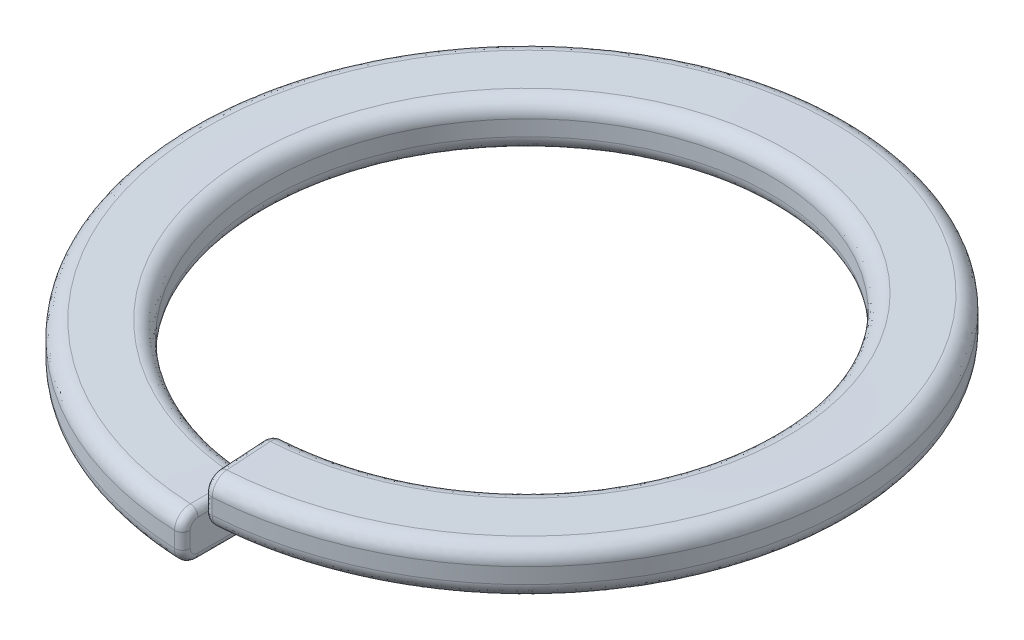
ISO-10303-21;
HEADER;
FILE_DESCRIPTION(('STEP AP214'),'2;1');
FILE_NAME('part.step','',(''),(''),'','','');
FILE_SCHEMA(('AUTOMOTIVE_DESIGN { 1 0 10303 214 1 1 1 1 }'));
ENDSEC;
DATA;
#1=APPLICATION_CONTEXT('core data for automotive mechanical design processes');
#2=APPLICATION_PROTOCOL_DEFINITION('international standard','automotive_design',2000,#1);
#3=PRODUCT_CONTEXT('',#1,'mechanical');
#4=PRODUCT('Part','Part','',(#3));
#5=PRODUCT_RELATED_PRODUCT_CATEGORY('part','',(#4));
#6=PRODUCT_DEFINITION_FORMATION('','',#4);
#7=PRODUCT_DEFINITION_CONTEXT('part definition',#1,'design');
#8=PRODUCT_DEFINITION('design','',#6,#7);
#9=PRODUCT_DEFINITION_SHAPE('','',#8);
#10=(LENGTH_UNIT() NAMED_UNIT(*) SI_UNIT(.MILLI.,.METRE.));
#11=(NAMED_UNIT(*) PLANE_ANGLE_UNIT() SI_UNIT($,.RADIAN.));
#12=(NAMED_UNIT(*) SI_UNIT($,.STERADIAN.) SOLID_ANGLE_UNIT());
#13=UNCERTAINTY_MEASURE_WITH_UNIT(LENGTH_MEASURE(1.E-05),#10,'distance_accuracy_value','');
#14=(GEOMETRIC_REPRESENTATION_CONTEXT(3) GLOBAL_UNCERTAINTY_ASSIGNED_CONTEXT((#13)) GLOBAL_UNIT_ASSIGNED_CONTEXT((#10,
#11,#12)) REPRESENTATION_CONTEXT('',''));
#15=CARTESIAN_POINT('',(0.,0.,0.));
#16=DIRECTION('',(0.,0.,1.));
#17=DIRECTION('',(1.,0.,0.));
#18=AXIS2_PLACEMENT_3D('',#15,#16,#17);
#19=CARTESIAN_POINT('',(0.,1.14142135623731,4.18500822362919));
#20=DIRECTION('',(-1.,0.,0.));
#21=DIRECTION('',(0.,0.,1.));
#22=AXIS2_PLACEMENT_3D('',#19,#20,#21);
#23=PLANE('',#22);
#24=CARTESIAN_POINT('',(-0.0970091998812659,0.902784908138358,3.24213586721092));
#25=CARTESIAN_POINT('',(0.,0.902784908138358,3.24503851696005));
#26=CARTESIAN_POINT('',(0.,0.902784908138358,3.34209113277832));
#27=CARTESIAN_POINT('',(-0.0970091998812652,0.936069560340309,3.24213586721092));
#28=CARTESIAN_POINT('',(0.,0.936069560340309,3.24503851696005));
#29=CARTESIAN_POINT('',(0.,0.936069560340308,3.34209113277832));
#30=CARTESIAN_POINT('',(-0.0970091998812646,0.96935421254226,3.24213586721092));
#31=CARTESIAN_POINT('',(0.,0.96935421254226,3.24503851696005));
#32=CARTESIAN_POINT('',(0.,0.969354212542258,3.34209113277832));
#33=CARTESIAN_POINT('',(-0.0970091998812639,1.00263886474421,3.24213586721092));
#34=CARTESIAN_POINT('',(0.,1.00263886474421,3.24503851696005));
#35=CARTESIAN_POINT('',(0.,1.00263886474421,3.34209113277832));
#36=CARTESIAN_POINT('',(-0.0968595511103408,1.01388914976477,3.24214085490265));
#37=CARTESIAN_POINT('',(0.,1.0137176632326,3.24518427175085));
#38=CARTESIAN_POINT('',(0.,1.00826194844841,3.34209141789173));
#39=CARTESIAN_POINT('',(-0.0967248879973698,1.02511966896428,3.243097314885));
#40=CARTESIAN_POINT('',(0.,1.02476295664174,3.24625180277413));
#41=CARTESIAN_POINT('',(0.,1.01387497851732,3.3425672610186));
#42=CARTESIAN_POINT('',(-0.0964889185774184,1.04725433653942,3.24687304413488));
#43=CARTESIAN_POINT('',(0.,1.04649725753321,3.25018289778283));
#44=CARTESIAN_POINT('',(0.,1.02493789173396,3.34445029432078));
#45=CARTESIAN_POINT('',(-0.0963875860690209,1.05815873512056,3.24969084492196));
#46=CARTESIAN_POINT('',(0.,1.05719043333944,3.25304363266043));
#47=CARTESIAN_POINT('',(0.,1.03038789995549,3.34585675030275));
#48=CARTESIAN_POINT('',(-0.0961388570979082,1.08991307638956,3.26085491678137));
#49=CARTESIAN_POINT('',(0.,1.08828984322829,3.26422223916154));
#50=CARTESIAN_POINT('',(0.,1.04625913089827,3.35143182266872));
#51=CARTESIAN_POINT('',(-0.0960457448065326,1.10987860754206,3.2719124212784));
#52=CARTESIAN_POINT('',(0.,1.10783822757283,3.27514734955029));
#53=CARTESIAN_POINT('',(0.,1.05623876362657,3.35695640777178));
#54=CARTESIAN_POINT('',(-0.0960156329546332,1.14498723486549,3.29997511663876));
#55=CARTESIAN_POINT('',(0.,1.14225908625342,3.30269592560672));
#56=CARTESIAN_POINT('',(0.,1.07378891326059,3.37098371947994));
#57=CARTESIAN_POINT('',(-0.0960786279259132,1.16013049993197,3.31698009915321));
#58=CARTESIAN_POINT('',(0.,1.15715823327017,3.319339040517));
#59=CARTESIAN_POINT('',(0.,1.08135951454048,3.37948634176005));
#60=CARTESIAN_POINT('',(-0.0963496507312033,1.18393612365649,3.35507063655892));
#61=CARTESIAN_POINT('',(0.,1.18074275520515,3.35660166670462));
#62=CARTESIAN_POINT('',(0.,1.09325983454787,3.39853745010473));
#63=CARTESIAN_POINT('',(-0.096557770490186,1.19259436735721,3.37615877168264));
#64=CARTESIAN_POINT('',(0.,1.18943256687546,3.37725500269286));
#65=CARTESIAN_POINT('',(0.,1.09758749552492,3.40908722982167));
#66=CARTESIAN_POINT('',(-0.0969987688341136,1.20087271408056,3.41253411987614));
#67=CARTESIAN_POINT('',(0.,1.19798363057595,3.41296425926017));
#68=CARTESIAN_POINT('',(0.,1.10172235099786,3.42728699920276));
#69=CARTESIAN_POINT('',(-0.0971996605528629,1.20255550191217,3.42738091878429));
#70=CARTESIAN_POINT('',(0.,1.1998314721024,3.42758110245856));
#71=CARTESIAN_POINT('',(0.,1.10256152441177,3.43471590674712));
#72=CARTESIAN_POINT('',(-0.0974211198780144,1.20249500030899,3.44220854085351));
#73=CARTESIAN_POINT('',(-2.02406993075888E-13,1.19998179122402,3.44220670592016));
#74=CARTESIAN_POINT('',(0.,1.10252828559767,3.44213555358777));
#75=CARTESIAN_POINT('',(-0.0974688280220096,1.20245023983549,3.50878100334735));
#76=CARTESIAN_POINT('',(-1.34982938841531E-13,1.19998238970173,3.50874828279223));
#77=CARTESIAN_POINT('',(0.,1.10248232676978,3.50871059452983));
#78=CARTESIAN_POINT('',(-0.0975165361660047,1.20240547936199,3.57535346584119));
#79=CARTESIAN_POINT('',(0.,1.19998298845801,3.57532083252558));
#80=CARTESIAN_POINT('',(0.,1.10243636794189,3.5752856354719));
#81=CARTESIAN_POINT('',(-0.0975642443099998,1.20236071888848,3.64192592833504));
#82=CARTESIAN_POINT('',(0.,1.19998358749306,3.64192437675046));
#83=CARTESIAN_POINT('',(0.,1.102390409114,3.64186067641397));
#84=(BOUNDED_SURFACE() B_SPLINE_SURFACE(3,2,((#24,#25,#26),(#27,#28,#29),(#30,#31,#32),(#33,#34,
#35),(#36,#37,#38),(#39,#40,#41),(#42,#43,#44),(#45,#46,#47),(#48,#49,#50),(#51,#52,#53),(#54,
#55,#56),(#57,#58,#59),(#60,#61,#62),(#63,#64,#65),(#66,#67,#68),(#69,#70,#71),(#72,#73,#74),
(#75,#76,#77),(#78,#79,#80),(#81,#82,#83)),.UNSPECIFIED.,.F.,.F.,
.F.) B_SPLINE_SURFACE_WITH_KNOTS((4,3,2,2,2,2,2,3,4),(3,3),(0.,0.0998539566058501,
0.116683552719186,0.133499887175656,0.16702641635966,0.200551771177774,0.234098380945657,
0.256338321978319,0.456063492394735),(0.,1.),
.UNSPECIFIED.) GEOMETRIC_REPRESENTATION_ITEM() RATIONAL_B_SPLINE_SURFACE(((1.,0.717602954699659,
1.),(1.,0.717602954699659,1.),(1.,0.717602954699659,1.),(1.,0.717602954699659,1.),(1.,
0.718124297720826,1.),(1.,0.718592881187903,1.),(1.,0.719413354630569,1.),(1.,0.719765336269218,
1.),(1.,0.7206289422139,1.),(1.,0.720951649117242,1.),(1.,0.721056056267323,1.),(1.,
0.720837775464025,1.),(1.,0.719897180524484,1.),(1.,0.719174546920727,1.),(1.,0.717639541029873,
1.),(1.,0.716939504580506,1.),(1.,0.716166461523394,1.),(1.,0.715999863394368,1.),(1.,
0.715833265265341,1.),(1.,0.715666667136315,1.))) REPRESENTATION_ITEM('') SURFACE());
#85=CARTESIAN_POINT('',(0.,0.902784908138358,3.34209113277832));
#86=CARTESIAN_POINT('',(0.,0.936069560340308,3.34209113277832));
#87=CARTESIAN_POINT('',(0.,0.969354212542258,3.34209113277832));
#88=CARTESIAN_POINT('',(0.,1.00263886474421,3.34209113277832));
#89=CARTESIAN_POINT('',(0.,1.00826194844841,3.34209141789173));
#90=CARTESIAN_POINT('',(0.,1.01387497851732,3.3425672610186));
#91=CARTESIAN_POINT('',(0.,1.02493789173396,3.34445029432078));
#92=CARTESIAN_POINT('',(0.,1.03038789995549,3.34585675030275));
#93=CARTESIAN_POINT('',(0.,1.04625913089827,3.35143182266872));
#94=CARTESIAN_POINT('',(0.,1.05623876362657,3.35695640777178));
#95=CARTESIAN_POINT('',(0.,1.07378891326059,3.37098371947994));
#96=CARTESIAN_POINT('',(0.,1.08135951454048,3.37948634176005));
#97=CARTESIAN_POINT('',(0.,1.09325983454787,3.39853745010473));
#98=CARTESIAN_POINT('',(0.,1.09758749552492,3.40908722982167));
#99=CARTESIAN_POINT('',(0.,1.10172235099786,3.42728699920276));
#100=CARTESIAN_POINT('',(0.,1.10256152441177,3.43471590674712));
#101=CARTESIAN_POINT('',(0.,1.10252828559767,3.44213555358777));
#102=CARTESIAN_POINT('',(0.,1.10248232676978,3.50871059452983));
#103=CARTESIAN_POINT('',(0.,1.10243636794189,3.5752856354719));
#104=CARTESIAN_POINT('',(0.,1.102390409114,3.64186067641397));
#105=B_SPLINE_CURVE_WITH_KNOTS('',3,(#85,#86,#87,#88,#89,#90,#91,#92,#93,#94,#95,#96,#97,#98,
#99,#100,#101,#102,#103,#104),.UNSPECIFIED.,.F.,.F.,(4,3,2,2,2,2,2,3,4),(0.,0.0998539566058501,
0.116683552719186,0.133499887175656,0.16702641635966,0.200551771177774,0.234098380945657,
0.256338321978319,0.456063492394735),.UNSPECIFIED.);
#106=CARTESIAN_POINT('',(0.,1.00263886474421,3.34209113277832));
#107=VERTEX_POINT('',#106);
#108=CARTESIAN_POINT('',(0.,1.10252828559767,3.44213555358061));
#109=VERTEX_POINT('',#108);
#110=EDGE_CURVE('E62',#107,#109,#105,.T.);
#111=ORIENTED_EDGE('',*,*,#110,.T.);
#112=CARTESIAN_POINT('',(-0.0972825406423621,1.20262457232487,3.26884164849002));
#113=CARTESIAN_POINT('',(0.,1.1999799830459,3.26883950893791));
#114=CARTESIAN_POINT('',(0.,1.10266153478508,3.2687607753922));
#115=CARTESIAN_POINT('',(-0.0973287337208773,1.20258138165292,3.3266306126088));
#116=CARTESIAN_POINT('',(0.,1.19998058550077,3.32660257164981));
#117=CARTESIAN_POINT('',(0.,1.10261711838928,3.32655236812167));
#118=CARTESIAN_POINT('',(-0.0973749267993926,1.20253819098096,3.38441957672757));
#119=CARTESIAN_POINT('',(0.,1.19998118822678,3.38439163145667));
#120=CARTESIAN_POINT('',(0.,1.10257270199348,3.38434396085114));
#121=CARTESIAN_POINT('',(-0.0974211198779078,1.202495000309,3.44220854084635));
#122=CARTESIAN_POINT('',(0.,1.19998179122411,3.442206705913));
#123=CARTESIAN_POINT('',(0.,1.10252828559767,3.44213555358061));
#124=CARTESIAN_POINT('',(-0.097464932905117,1.20245396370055,3.49999770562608));
#125=CARTESIAN_POINT('',(0.,1.19998235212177,3.50000782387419));
#126=CARTESIAN_POINT('',(0.,1.10248611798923,3.49992714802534));
#127=CARTESIAN_POINT('',(-0.0975065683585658,1.20241490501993,3.55778704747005));
#128=CARTESIAN_POINT('',(0.,1.19998287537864,3.55779641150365));
#129=CARTESIAN_POINT('',(0.,1.10244601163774,3.55771874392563));
#130=CARTESIAN_POINT('',(-0.0975859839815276,1.20234030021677,3.67336603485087));
#131=CARTESIAN_POINT('',(0.,1.19998385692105,3.67337589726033));
#132=CARTESIAN_POINT('',(0.,1.10236945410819,3.67330193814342));
#133=CARTESIAN_POINT('',(-0.097623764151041,1.20230475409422,3.73115568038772));
#134=CARTESIAN_POINT('',(0.,1.19998431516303,3.73116463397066));
#135=CARTESIAN_POINT('',(0.,1.10233300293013,3.73109353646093));
#136=CARTESIAN_POINT('',(-0.097712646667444,1.20222101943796,3.8734313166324));
#137=CARTESIAN_POINT('',(0.,1.19998537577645,3.87345152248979));
#138=CARTESIAN_POINT('',(0.,1.10224718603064,3.87337367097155));
#139=CARTESIAN_POINT('',(-0.0977618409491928,1.20217457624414,3.95791745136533));
#140=CARTESIAN_POINT('',(0.,1.19998594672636,3.95793414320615));
#141=CARTESIAN_POINT('',(0.,1.1021996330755,3.95786220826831));
#142=CARTESIAN_POINT('',(-0.0978082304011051,1.20213072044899,4.04240377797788));
#143=CARTESIAN_POINT('',(0.,1.19998647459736,4.04240264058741));
#144=CARTESIAN_POINT('',(0.,1.10215475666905,4.04235074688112));
#145=CARTESIAN_POINT('',(-0.0978386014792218,1.20210197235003,4.10019396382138));
#146=CARTESIAN_POINT('',(0.,1.19998681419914,4.10017568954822));
#147=CARTESIAN_POINT('',(0.,1.10212535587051,4.1001423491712));
#148=CARTESIAN_POINT('',(-0.0978689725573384,1.20207322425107,4.15798414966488));
#149=CARTESIAN_POINT('',(0.,1.19998715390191,4.15796591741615));
#150=CARTESIAN_POINT('',(0.,1.10209595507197,4.15793395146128));
#151=CARTESIAN_POINT('',(-0.097899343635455,1.2020444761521,4.21577433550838));
#152=CARTESIAN_POINT('',(0.,1.1999874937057,4.21577333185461));
#153=CARTESIAN_POINT('',(0.,1.10206655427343,4.21572555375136));
#154=(BOUNDED_SURFACE() B_SPLINE_SURFACE(3,2,((#112,#113,#114),(#115,#116,#117),(#118,#119,
#120),(#121,#122,#123),(#124,#125,#126),(#127,#128,#129),(#130,#131,#132),(#133,#134,#135),
(#136,#137,#138),(#139,#140,#141),(#142,#143,#144),(#145,#146,#147),(#148,#149,#150),(#151,#152,
#153)),.UNSPECIFIED.,.F.,.F.,.F.) B_SPLINE_SURFACE_WITH_KNOTS((4,3,2,2,3,4),(3,3),(0.,
0.173374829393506,0.346749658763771,0.520124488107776,0.773590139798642,0.946964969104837),(0.,
1.),.UNSPECIFIED.) GEOMETRIC_REPRESENTATION_ITEM() RATIONAL_B_SPLINE_SURFACE(((1.,
0.716650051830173,1.),(1.,0.716488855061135,1.),(1.,0.716327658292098,1.),(1.,0.71616646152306,
1.),(1.,0.716013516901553,1.),(1.,0.715868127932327,1.),(1.,0.715590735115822,1.),(1.,
0.715458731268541,1.),(1.,0.715148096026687,1.),(1.,0.714976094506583,1.),(1.,0.714813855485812,
1.),(1.,0.71470761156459,1.),(1.,0.714601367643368,1.),(1.,0.714495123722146,1.))) REPRESENTATION_ITEM('') SURFACE());
#155=CARTESIAN_POINT('',(0.,1.10266153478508,3.2687607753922));
#156=CARTESIAN_POINT('',(0.,1.10261711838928,3.32655236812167));
#157=CARTESIAN_POINT('',(0.,1.10257270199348,3.38434396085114));
#158=CARTESIAN_POINT('',(0.,1.10252828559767,3.44213555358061));
#159=CARTESIAN_POINT('',(0.,1.10248611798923,3.49992714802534));
#160=CARTESIAN_POINT('',(0.,1.10244601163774,3.55771874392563));
#161=CARTESIAN_POINT('',(0.,1.10236945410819,3.67330193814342));
#162=CARTESIAN_POINT('',(0.,1.10233300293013,3.73109353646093));
#163=CARTESIAN_POINT('',(0.,1.10224718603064,3.87337367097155));
#164=CARTESIAN_POINT('',(0.,1.1021996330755,3.95786220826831));
#165=CARTESIAN_POINT('',(0.,1.10215475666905,4.04235074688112));
#166=CARTESIAN_POINT('',(0.,1.10212535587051,4.1001423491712));
#167=CARTESIAN_POINT('',(0.,1.10209595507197,4.15793395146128));
#168=CARTESIAN_POINT('',(0.,1.10206655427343,4.21572555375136));
#169=B_SPLINE_CURVE_WITH_KNOTS('',3,(#155,#156,#157,#158,#159,#160,#161,#162,#163,#164,#165,
#166,#167,#168),.UNSPECIFIED.,.F.,.F.,(4,3,2,2,3,4),(0.,0.173374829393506,0.346749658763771,
0.520124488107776,0.773590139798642,0.946964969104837),.UNSPECIFIED.);
#170=CARTESIAN_POINT('',(0.,1.10215475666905,4.04235074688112));
#171=VERTEX_POINT('',#170);
#172=EDGE_CURVE('E12',#109,#171,#169,.T.);
#173=ORIENTED_EDGE('',*,*,#172,.T.);
#174=CARTESIAN_POINT('',(-0.0977520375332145,1.20218381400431,3.94247642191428));
#175=CARTESIAN_POINT('',(0.,1.19998582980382,3.94247519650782));
#176=CARTESIAN_POINT('',(0.,1.10220909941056,3.94242068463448));
#177=CARTESIAN_POINT('',(-0.0977707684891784,1.20216611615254,3.97578554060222));
#178=CARTESIAN_POINT('',(0.,1.19998604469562,3.97577824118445));
#179=CARTESIAN_POINT('',(0.,1.10219098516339,3.9757307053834));
#180=CARTESIAN_POINT('',(-0.0977894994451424,1.20214841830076,4.00909465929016));
#181=CARTESIAN_POINT('',(0.,1.19998625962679,4.00908738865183));
#182=CARTESIAN_POINT('',(0.,1.10217287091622,4.00904072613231));
#183=CARTESIAN_POINT('',(-0.0978082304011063,1.20213072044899,4.0424037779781));
#184=CARTESIAN_POINT('',(0.,1.19998647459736,4.04240264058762));
#185=CARTESIAN_POINT('',(0.,1.10215475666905,4.04235074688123));
#186=CARTESIAN_POINT('',(-0.0979506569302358,1.2021271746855,4.05367292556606));
#187=CARTESIAN_POINT('',(0.,1.20011936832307,4.05355887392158));
#188=CARTESIAN_POINT('',(0.,1.10215143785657,4.04798847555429));
#189=CARTESIAN_POINT('',(-0.0981026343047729,1.20117021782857,4.0649211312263));
#190=CARTESIAN_POINT('',(0.,1.19931737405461,4.06471069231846));
#191=CARTESIAN_POINT('',(0.,1.10167116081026,4.05361579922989));
#192=CARTESIAN_POINT('',(-0.0984215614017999,1.1973894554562,4.08708966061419));
#193=CARTESIAN_POINT('',(0.,1.19587250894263,4.08674189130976));
#194=CARTESIAN_POINT('',(0.,1.09977687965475,4.064706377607));
#195=CARTESIAN_POINT('',(-0.0985884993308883,1.19456710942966,4.09801023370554));
#196=CARTESIAN_POINT('',(0.,1.19322792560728,4.09762275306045));
#197=CARTESIAN_POINT('',(0.,1.09836360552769,4.07016975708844));
#198=CARTESIAN_POINT('',(-0.0991048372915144,1.18338324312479,4.12981153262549));
#199=CARTESIAN_POINT('',(0.,1.18257867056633,4.12942352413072));
#200=CARTESIAN_POINT('',(0.,1.09276522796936,4.08607909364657));
#201=CARTESIAN_POINT('',(-0.0994707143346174,1.17230433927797,4.14980669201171));
#202=CARTESIAN_POINT('',(0.,1.17185578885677,4.14952350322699));
#203=CARTESIAN_POINT('',(0.,1.08722127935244,4.09608169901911));
#204=CARTESIAN_POINT('',(-0.100203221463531,1.14417108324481,4.1849676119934));
#205=CARTESIAN_POINT('',(0.,1.14431519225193,4.18511237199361));
#206=CARTESIAN_POINT('',(0.,1.07314750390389,4.11367016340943));
#207=CARTESIAN_POINT('',(-0.10056985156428,1.12711661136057,4.20013327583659));
#208=CARTESIAN_POINT('',(0.,1.1274745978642,4.20058474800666));
#209=CARTESIAN_POINT('',(0.,1.0646176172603,4.12125597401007));
#210=CARTESIAN_POINT('',(-0.101265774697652,1.08891468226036,4.22393954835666));
#211=CARTESIAN_POINT('',(0.,1.08947092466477,4.22510264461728));
#212=CARTESIAN_POINT('',(0.,1.04551439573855,4.13316434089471));
#213=CARTESIAN_POINT('',(-0.101595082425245,1.06776884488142,4.23258273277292));
#214=CARTESIAN_POINT('',(0.,1.06830107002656,4.23412372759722));
#215=CARTESIAN_POINT('',(0.,1.03494186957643,4.1374881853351));
#216=CARTESIAN_POINT('',(-0.102080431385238,1.03148498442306,4.24075935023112));
#217=CARTESIAN_POINT('',(0.,1.03179708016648,4.2428662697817));
#218=CARTESIAN_POINT('',(0.,1.01680232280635,4.1415805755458));
#219=CARTESIAN_POINT('',(-0.102257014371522,1.01679738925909,4.24240917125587));
#220=CARTESIAN_POINT('',(0.,1.01696705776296,4.24471811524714));
#221=CARTESIAN_POINT('',(0.,1.00945991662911,4.14240719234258));
#222=CARTESIAN_POINT('',(-0.102413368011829,1.0021258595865,4.24235088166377));
#223=CARTESIAN_POINT('',(0.,1.0021258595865,4.24482321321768));
#224=CARTESIAN_POINT('',(0.,1.0021258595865,4.14238000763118));
#225=CARTESIAN_POINT('',(-0.10241336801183,0.968823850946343,4.24235088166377));
#226=CARTESIAN_POINT('',(0.,0.968823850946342,4.24482321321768));
#227=CARTESIAN_POINT('',(0.,0.968823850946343,4.14238000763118));
#228=CARTESIAN_POINT('',(-0.10241336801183,0.93552184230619,4.24235088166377));
#229=CARTESIAN_POINT('',(0.,0.93552184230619,4.24482321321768));
#230=CARTESIAN_POINT('',(0.,0.93552184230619,4.14238000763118));
#231=CARTESIAN_POINT('',(-0.10241336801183,0.902219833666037,4.24235088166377));
#232=CARTESIAN_POINT('',(0.,0.902219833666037,4.24482321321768));
#233=CARTESIAN_POINT('',(0.,0.902219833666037,4.14238000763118));
#234=(BOUNDED_SURFACE() B_SPLINE_SURFACE(3,2,((#174,#175,#176),(#177,#178,#179),(#180,#181,
#182),(#183,#184,#185),(#186,#187,#188),(#189,#190,#191),(#192,#193,#194),(#195,#196,#197),
(#198,#199,#200),(#201,#202,#203),(#204,#205,#206),(#207,#208,#209),(#210,#211,#212),(#213,#214,
#215),(#216,#217,#218),(#219,#220,#221),(#222,#223,#224),(#225,#226,#227),(#228,#229,#230),
(#231,#232,#233)),.UNSPECIFIED.,.F.,.F.,.F.) B_SPLINE_SURFACE_WITH_KNOTS((4,3,2,2,2,2,2,3,4),(3,
3),(0.,0.0999300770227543,0.11680338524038,0.133663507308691,0.167276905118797,
0.200890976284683,0.234491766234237,0.256475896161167,0.356381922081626),(0.,1.),
.UNSPECIFIED.) GEOMETRIC_REPRESENTATION_ITEM() RATIONAL_B_SPLINE_SURFACE(((1.,0.715010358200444,
1.),(1.,0.714944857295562,1.),(1.,0.714879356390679,1.),(1.,0.714813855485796,1.),(1.,
0.714315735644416,1.),(1.,0.713783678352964,1.),(1.,0.712665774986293,1.),(1.,0.712079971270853,
1.),(1.,0.710265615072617,1.),(1.,0.708976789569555,1.),(1.,0.706389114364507,1.),(1.,
0.705090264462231,1.),(1.,0.70261841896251,1.),(1.,0.701445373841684,1.),(1.,0.699713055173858,
1.),(1.,0.699081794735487,1.),(1.,0.69852212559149,1.),(1.,0.69852212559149,1.),(1.,
0.698522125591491,1.),(1.,0.698522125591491,1.))) REPRESENTATION_ITEM('') SURFACE());
#235=CARTESIAN_POINT('',(0.,1.10220909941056,3.94242068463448));
#236=CARTESIAN_POINT('',(0.,1.10219098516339,3.9757307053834));
#237=CARTESIAN_POINT('',(0.,1.10217287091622,4.00904072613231));
#238=CARTESIAN_POINT('',(0.,1.10215475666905,4.04235074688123));
#239=CARTESIAN_POINT('',(0.,1.10215143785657,4.04798847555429));
#240=CARTESIAN_POINT('',(0.,1.10167116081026,4.05361579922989));
#241=CARTESIAN_POINT('',(0.,1.09977687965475,4.064706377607));
#242=CARTESIAN_POINT('',(0.,1.09836360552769,4.07016975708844));
#243=CARTESIAN_POINT('',(0.,1.09276522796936,4.08607909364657));
#244=CARTESIAN_POINT('',(0.,1.08722127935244,4.09608169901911));
#245=CARTESIAN_POINT('',(0.,1.07314750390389,4.11367016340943));
#246=CARTESIAN_POINT('',(0.,1.0646176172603,4.12125597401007));
#247=CARTESIAN_POINT('',(0.,1.04551439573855,4.13316434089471));
#248=CARTESIAN_POINT('',(0.,1.03494186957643,4.13748818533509));
#249=CARTESIAN_POINT('',(0.,1.01680232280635,4.1415805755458));
#250=CARTESIAN_POINT('',(0.,1.00945991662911,4.14240719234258));
#251=CARTESIAN_POINT('',(0.,1.0021258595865,4.14238000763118));
#252=CARTESIAN_POINT('',(0.,0.968823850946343,4.14238000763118));
#253=CARTESIAN_POINT('',(0.,0.93552184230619,4.14238000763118));
#254=CARTESIAN_POINT('',(0.,0.902219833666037,4.14238000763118));
#255=B_SPLINE_CURVE_WITH_KNOTS('',3,(#235,#236,#237,#238,#239,#240,#241,#242,#243,#244,#245,
#246,#247,#248,#249,#250,#251,#252,#253,#254),.UNSPECIFIED.,.F.,.F.,(4,3,2,2,2,2,2,3,4),(0.,
0.0999300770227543,0.11680338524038,0.133663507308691,0.167276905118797,0.200890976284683,
0.234491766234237,0.256475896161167,0.356381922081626),.UNSPECIFIED.);
#256=CARTESIAN_POINT('',(0.,1.0021258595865,4.14238000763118));
#257=VERTEX_POINT('',#256);
#258=EDGE_CURVE('E581',#171,#257,#255,.T.);
#259=ORIENTED_EDGE('',*,*,#258,.T.);
#260=CARTESIAN_POINT('',(-0.102413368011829,1.05330410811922,4.24235088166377));
#261=CARTESIAN_POINT('',(0.,1.05330410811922,4.24482321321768));
#262=CARTESIAN_POINT('',(0.,1.05330410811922,4.14238000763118));
#263=CARTESIAN_POINT('',(-0.102413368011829,1.03624469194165,4.24235088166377));
#264=CARTESIAN_POINT('',(0.,1.03624469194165,4.24482321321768));
#265=CARTESIAN_POINT('',(0.,1.03624469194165,4.14238000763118));
#266=CARTESIAN_POINT('',(-0.102413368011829,1.01918527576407,4.24235088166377));
#267=CARTESIAN_POINT('',(0.,1.01918527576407,4.24482321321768));
#268=CARTESIAN_POINT('',(0.,1.01918527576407,4.14238000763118));
#269=CARTESIAN_POINT('',(-0.102413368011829,1.0021258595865,4.24235088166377));
#270=CARTESIAN_POINT('',(0.,1.0021258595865,4.24482321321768));
#271=CARTESIAN_POINT('',(0.,1.0021258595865,4.14238000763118));
#272=CARTESIAN_POINT('',(-0.102413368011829,0.985066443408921,4.24235088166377));
#273=CARTESIAN_POINT('',(0.,0.985066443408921,4.24482321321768));
#274=CARTESIAN_POINT('',(0.,0.985066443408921,4.14238000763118));
#275=CARTESIAN_POINT('',(-0.102413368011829,0.968007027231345,4.24235088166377));
#276=CARTESIAN_POINT('',(0.,0.968007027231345,4.24482321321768));
#277=CARTESIAN_POINT('',(0.,0.968007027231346,4.14238000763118));
#278=CARTESIAN_POINT('',(-0.102413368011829,0.933888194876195,4.24235088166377));
#279=CARTESIAN_POINT('',(0.,0.933888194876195,4.24482321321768));
#280=CARTESIAN_POINT('',(0.,0.933888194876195,4.14238000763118));
#281=CARTESIAN_POINT('',(-0.102413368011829,0.91682877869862,4.24235088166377));
#282=CARTESIAN_POINT('',(0.,0.91682877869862,4.24482321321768));
#283=CARTESIAN_POINT('',(0.,0.91682877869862,4.14238000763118));
#284=CARTESIAN_POINT('',(-0.102413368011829,0.867221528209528,4.24235088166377));
#285=CARTESIAN_POINT('',(0.,0.867221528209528,4.24482321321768));
#286=CARTESIAN_POINT('',(0.,0.867221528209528,4.14238000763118));
#287=CARTESIAN_POINT('',(-0.102413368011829,0.834673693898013,4.24235088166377));
#288=CARTESIAN_POINT('',(0.,0.834673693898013,4.24482321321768));
#289=CARTESIAN_POINT('',(0.,0.834673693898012,4.14238000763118));
#290=CARTESIAN_POINT('',(-0.102413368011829,0.802125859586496,4.24235088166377));
#291=CARTESIAN_POINT('',(0.,0.802125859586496,4.24482321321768));
#292=CARTESIAN_POINT('',(0.,0.802125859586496,4.14238000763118));
#293=CARTESIAN_POINT('',(-0.102413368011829,0.785066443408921,4.24235088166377));
#294=CARTESIAN_POINT('',(0.,0.785066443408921,4.24482321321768));
#295=CARTESIAN_POINT('',(0.,0.785066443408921,4.14238000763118));
#296=CARTESIAN_POINT('',(-0.102413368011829,0.768007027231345,4.24235088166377));
#297=CARTESIAN_POINT('',(0.,0.768007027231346,4.24482321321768));
#298=CARTESIAN_POINT('',(0.,0.768007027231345,4.14238000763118));
#299=CARTESIAN_POINT('',(-0.102413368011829,0.75094761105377,4.24235088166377));
#300=CARTESIAN_POINT('',(0.,0.75094761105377,4.24482321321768));
#301=CARTESIAN_POINT('',(0.,0.75094761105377,4.14238000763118));
#302=(BOUNDED_SURFACE() B_SPLINE_SURFACE(3,2,((#260,#261,#262),(#263,#264,#265),(#266,#267,
#268),(#269,#270,#271),(#272,#273,#274),(#275,#276,#277),(#278,#279,#280),(#281,#282,#283),
(#284,#285,#286),(#287,#288,#289),(#290,#291,#292),(#293,#294,#295),(#296,#297,#298),(#299,#300,
#301)),.UNSPECIFIED.,.F.,.F.,.F.) B_SPLINE_SURFACE_WITH_KNOTS((4,3,2,2,3,4),(3,3),(0.,
0.0511782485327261,0.102356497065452,0.153534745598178,0.251178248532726,0.302356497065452),(0.,
1.),.UNSPECIFIED.) GEOMETRIC_REPRESENTATION_ITEM() RATIONAL_B_SPLINE_SURFACE(((1.,
0.69852212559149,1.),(1.,0.69852212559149,1.),(1.,0.69852212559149,1.),(1.,0.69852212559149,1.),
(1.,0.69852212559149,1.),(1.,0.69852212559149,1.),(1.,0.69852212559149,1.),(1.,0.69852212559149,
1.),(1.,0.69852212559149,1.),(1.,0.69852212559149,1.),(1.,0.69852212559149,1.),(1.,
0.69852212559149,1.),(1.,0.69852212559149,1.),(1.,0.69852212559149,1.))) REPRESENTATION_ITEM('') SURFACE());
#303=CARTESIAN_POINT('',(0.,1.05330410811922,4.14238000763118));
#304=CARTESIAN_POINT('',(0.,1.03624469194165,4.14238000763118));
#305=CARTESIAN_POINT('',(0.,1.01918527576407,4.14238000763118));
#306=CARTESIAN_POINT('',(0.,1.0021258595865,4.14238000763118));
#307=CARTESIAN_POINT('',(0.,0.985066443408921,4.14238000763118));
#308=CARTESIAN_POINT('',(0.,0.968007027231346,4.14238000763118));
#309=CARTESIAN_POINT('',(0.,0.933888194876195,4.14238000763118));
#310=CARTESIAN_POINT('',(0.,0.91682877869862,4.14238000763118));
#311=CARTESIAN_POINT('',(0.,0.867221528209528,4.14238000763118));
#312=CARTESIAN_POINT('',(0.,0.834673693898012,4.14238000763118));
#313=CARTESIAN_POINT('',(0.,0.802125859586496,4.14238000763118));
#314=CARTESIAN_POINT('',(0.,0.785066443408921,4.14238000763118));
#315=CARTESIAN_POINT('',(0.,0.768007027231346,4.14238000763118));
#316=CARTESIAN_POINT('',(0.,0.75094761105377,4.14238000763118));
#317=B_SPLINE_CURVE_WITH_KNOTS('',3,(#303,#304,#305,#306,#307,#308,#309,#310,#311,#312,#313,
#314,#315,#316),.UNSPECIFIED.,.F.,.F.,(4,3,2,2,3,4),(0.,0.0511782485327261,0.102356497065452,
0.153534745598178,0.251178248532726,0.302356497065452),.UNSPECIFIED.);
#318=CARTESIAN_POINT('',(0.,0.802125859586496,4.14238000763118));
#319=VERTEX_POINT('',#318);
#320=EDGE_CURVE('E575',#257,#319,#317,.T.);
#321=ORIENTED_EDGE('',*,*,#320,.T.);
#322=CARTESIAN_POINT('',(-0.10241336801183,0.902031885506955,4.24235088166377));
#323=CARTESIAN_POINT('',(0.,0.902031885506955,4.24482321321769));
#324=CARTESIAN_POINT('',(0.,0.902031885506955,4.14238000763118));
#325=CARTESIAN_POINT('',(-0.10241336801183,0.868729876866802,4.24235088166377));
#326=CARTESIAN_POINT('',(0.,0.868729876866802,4.24482321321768));
#327=CARTESIAN_POINT('',(0.,0.868729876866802,4.14238000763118));
#328=CARTESIAN_POINT('',(-0.10241336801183,0.835427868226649,4.24235088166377));
#329=CARTESIAN_POINT('',(0.,0.835427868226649,4.24482321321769));
#330=CARTESIAN_POINT('',(0.,0.835427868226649,4.14238000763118));
#331=CARTESIAN_POINT('',(-0.102413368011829,0.802125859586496,4.24235088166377));
#332=CARTESIAN_POINT('',(0.,0.802125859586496,4.24482321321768));
#333=CARTESIAN_POINT('',(0.,0.802125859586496,4.14238000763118));
#334=CARTESIAN_POINT('',(-0.10253376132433,0.790871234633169,4.24234741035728));
#335=CARTESIAN_POINT('',(0.,0.790725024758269,4.24494613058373));
#336=CARTESIAN_POINT('',(0.,0.796499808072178,4.14237970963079));
#337=CARTESIAN_POINT('',(-0.102642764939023,0.779636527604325,4.24139207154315));
#338=CARTESIAN_POINT('',(0.,0.779331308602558,4.24409265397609));
#339=CARTESIAN_POINT('',(0.,0.790883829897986,4.14190358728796));
#340=CARTESIAN_POINT('',(-0.102835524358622,0.757493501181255,4.23761759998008));
#341=CARTESIAN_POINT('',(0.,0.756842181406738,4.24046574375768));
#342=CARTESIAN_POINT('',(0.,0.779815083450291,4.14001950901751));
#343=CARTESIAN_POINT('',(-0.102919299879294,0.746584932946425,4.23479992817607));
#344=CARTESIAN_POINT('',(0.,0.745749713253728,4.2376923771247));
#345=CARTESIAN_POINT('',(0.,0.774362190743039,4.13861228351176));
#346=CARTESIAN_POINT('',(-0.103128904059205,0.714817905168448,4.22363450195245));
#347=CARTESIAN_POINT('',(0.,0.713407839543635,4.22656083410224));
#348=CARTESIAN_POINT('',(0.,0.758482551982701,4.13303425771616));
#349=CARTESIAN_POINT('',(-0.103213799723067,0.694843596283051,4.21257378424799));
#350=CARTESIAN_POINT('',(0.,0.693062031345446,4.21539846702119));
#351=CARTESIAN_POINT('',(0.,0.748497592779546,4.12750684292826));
#352=CARTESIAN_POINT('',(-0.103262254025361,0.659719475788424,4.18449721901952));
#353=CARTESIAN_POINT('',(0.,0.657317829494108,4.18689240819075));
#354=CARTESIAN_POINT('',(0.,0.730938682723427,4.11347206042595));
#355=CARTESIAN_POINT('',(-0.10322582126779,0.644569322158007,4.1674817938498));
#356=CARTESIAN_POINT('',(0.,0.641942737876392,4.16956548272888));
#357=CARTESIAN_POINT('',(0.,0.723364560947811,4.104964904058));
#358=CARTESIAN_POINT('',(-0.103033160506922,0.62076096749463,4.12936856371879));
#359=CARTESIAN_POINT('',(0.,0.617923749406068,4.13072795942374));
#360=CARTESIAN_POINT('',(0.,0.711462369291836,4.08590567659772));
#361=CARTESIAN_POINT('',(-0.102876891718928,0.612104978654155,4.10826937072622));
#362=CARTESIAN_POINT('',(0.,0.609290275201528,4.10924405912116));
#363=CARTESIAN_POINT('',(0.,0.70713540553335,4.07535291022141));
#364=CARTESIAN_POINT('',(-0.102532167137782,0.603844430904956,4.07191087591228));
#365=CARTESIAN_POINT('',(0.,0.601268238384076,4.07229374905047));
#366=CARTESIAN_POINT('',(0.,0.703008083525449,4.05716614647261));
#367=CARTESIAN_POINT('',(-0.102372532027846,0.602167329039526,4.05709357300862));
#368=CARTESIAN_POINT('',(0.,0.599737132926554,4.05727168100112));
#369=CARTESIAN_POINT('',(0.,0.70217103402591,4.04975391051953));
#370=CARTESIAN_POINT('',(-0.102193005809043,0.602226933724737,4.04229530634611));
#371=CARTESIAN_POINT('',(0.,0.599985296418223,4.0422940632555));
#372=CARTESIAN_POINT('',(0.,0.702202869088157,4.04235074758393));
#373=CARTESIAN_POINT('',(-0.102211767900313,0.602246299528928,4.00898435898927));
#374=CARTESIAN_POINT('',(0.,0.599985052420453,4.00898947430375));
#375=CARTESIAN_POINT('',(0.,0.702221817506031,4.00904076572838));
#376=CARTESIAN_POINT('',(-0.102230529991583,0.602265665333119,3.97567341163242));
#377=CARTESIAN_POINT('',(0.,0.599984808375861,3.9756784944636));
#378=CARTESIAN_POINT('',(0.,0.702240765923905,3.97573078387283));
#379=CARTESIAN_POINT('',(-0.102249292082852,0.60228503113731,3.94236246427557));
#380=CARTESIAN_POINT('',(0.,0.599984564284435,3.94236112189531));
#381=CARTESIAN_POINT('',(0.,0.70225971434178,3.94242080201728));
#382=(BOUNDED_SURFACE() B_SPLINE_SURFACE(3,2,((#322,#323,#324),(#325,#326,#327),(#328,#329,
#330),(#331,#332,#333),(#334,#335,#336),(#337,#338,#339),(#340,#341,#342),(#343,#344,#345),
(#346,#347,#348),(#349,#350,#351),(#352,#353,#354),(#355,#356,#357),(#358,#359,#360),(#361,#362,
#363),(#364,#365,#366),(#367,#368,#369),(#370,#371,#372),(#373,#374,#375),(#376,#377,#378),
(#379,#380,#381)),.UNSPECIFIED.,.F.,.F.,.F.) B_SPLINE_SURFACE_WITH_KNOTS((4,3,2,2,2,2,2,3,4),(3,
3),(0.,0.099906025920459,0.116744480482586,0.133569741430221,0.167113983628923,
0.200655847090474,0.234209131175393,0.256399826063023,0.356329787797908),(0.,1.),
.UNSPECIFIED.) GEOMETRIC_REPRESENTATION_ITEM() RATIONAL_B_SPLINE_SURFACE(((1.,0.69852212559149,
1.),(1.,0.69852212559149,1.),(1.,0.69852212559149,1.),(1.,0.69852212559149,1.),(1.,
0.698091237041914,1.),(1.,0.697700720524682,1.),(1.,0.69700968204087,1.),(1.,0.69670908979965,
1.),(1.,0.695956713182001,1.),(1.,0.695651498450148,1.),(1.,0.695477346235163,1.),(1.,
0.69560837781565,1.),(1.,0.696300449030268,1.),(1.,0.696861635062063,1.),(1.,0.698096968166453,
1.),(1.,0.698668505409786,1.),(1.,0.699310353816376,1.),(1.,0.699243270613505,1.),(1.,
0.699176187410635,1.),(1.,0.699109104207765,1.))) REPRESENTATION_ITEM('') SURFACE());
#383=CARTESIAN_POINT('',(0.,0.902031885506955,4.14238000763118));
#384=CARTESIAN_POINT('',(0.,0.868729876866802,4.14238000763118));
#385=CARTESIAN_POINT('',(0.,0.835427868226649,4.14238000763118));
#386=CARTESIAN_POINT('',(0.,0.802125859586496,4.14238000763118));
#387=CARTESIAN_POINT('',(0.,0.796499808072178,4.14237970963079));
#388=CARTESIAN_POINT('',(0.,0.790883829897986,4.14190358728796));
#389=CARTESIAN_POINT('',(0.,0.779815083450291,4.14001950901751));
#390=CARTESIAN_POINT('',(0.,0.774362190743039,4.13861228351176));
#391=CARTESIAN_POINT('',(0.,0.758482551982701,4.13303425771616));
#392=CARTESIAN_POINT('',(0.,0.748497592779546,4.12750684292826));
#393=CARTESIAN_POINT('',(0.,0.730938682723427,4.11347206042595));
#394=CARTESIAN_POINT('',(0.,0.723364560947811,4.104964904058));
#395=CARTESIAN_POINT('',(0.,0.711462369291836,4.08590567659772));
#396=CARTESIAN_POINT('',(0.,0.70713540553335,4.07535291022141));
#397=CARTESIAN_POINT('',(0.,0.703008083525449,4.05716614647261));
#398=CARTESIAN_POINT('',(0.,0.70217103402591,4.04975391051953));
#399=CARTESIAN_POINT('',(0.,0.702202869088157,4.04235074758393));
#400=CARTESIAN_POINT('',(0.,0.702221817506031,4.00904076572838));
#401=CARTESIAN_POINT('',(0.,0.702240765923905,3.97573078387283));
#402=CARTESIAN_POINT('',(0.,0.70225971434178,3.94242080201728));
#403=B_SPLINE_CURVE_WITH_KNOTS('',3,(#383,#384,#385,#386,#387,#388,#389,#390,#391,#392,#393,
#394,#395,#396,#397,#398,#399,#400,#401,#402),.UNSPECIFIED.,.F.,.F.,(4,3,2,2,2,2,2,3,4),(0.,
0.099906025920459,0.116744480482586,0.133569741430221,0.167113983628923,0.200655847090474,
0.234209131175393,0.256399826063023,0.356329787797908),.UNSPECIFIED.);
#404=CARTESIAN_POINT('',(0.,0.702202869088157,4.04235074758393));
#405=VERTEX_POINT('',#404);
#406=EDGE_CURVE('E509',#319,#405,#403,.T.);
#407=ORIENTED_EDGE('',*,*,#406,.T.);
#408=CARTESIAN_POINT('',(-0.10210175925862,0.60213285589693,4.21565653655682));
#409=CARTESIAN_POINT('',(0.,0.599986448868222,4.21565544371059));
#410=CARTESIAN_POINT('',(0.,0.702110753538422,4.21570744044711));
#411=CARTESIAN_POINT('',(-0.102132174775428,0.602164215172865,4.15786945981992));
#412=CARTESIAN_POINT('',(0.,0.599986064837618,4.15788627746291));
#413=CARTESIAN_POINT('',(0.,0.702141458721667,4.15792187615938));
#414=CARTESIAN_POINT('',(-0.102162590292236,0.602195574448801,4.10008238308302));
#415=CARTESIAN_POINT('',(0.,0.599985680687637,4.10009915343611));
#416=CARTESIAN_POINT('',(0.,0.702172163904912,4.10013631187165));
#417=CARTESIAN_POINT('',(-0.102193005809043,0.602226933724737,4.04229530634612));
#418=CARTESIAN_POINT('',(0.,0.599985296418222,4.0422940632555));
#419=CARTESIAN_POINT('',(0.,0.702202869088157,4.04235074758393));
#420=CARTESIAN_POINT('',(-0.102224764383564,0.602259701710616,3.98450812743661));
#421=CARTESIAN_POINT('',(0.,0.599984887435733,3.98449794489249));
#422=CARTESIAN_POINT('',(0.,0.702234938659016,3.98456518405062));
#423=CARTESIAN_POINT('',(-0.102257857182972,0.602293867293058,3.92672084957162));
#424=CARTESIAN_POINT('',(0.,0.599984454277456,3.92670942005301));
#425=CARTESIAN_POINT('',(0.,0.7022683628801,3.92677962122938));
#426=CARTESIAN_POINT('',(-0.102327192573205,0.602365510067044,3.81114604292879));
#427=CARTESIAN_POINT('',(0.,0.599983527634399,3.8111341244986));
#428=CARTESIAN_POINT('',(0.,0.702338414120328,3.81120849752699));
#429=CARTESIAN_POINT('',(-0.102363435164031,0.602402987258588,3.75335851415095));
#430=CARTESIAN_POINT('',(0.,0.599983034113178,3.75334547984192));
#431=CARTESIAN_POINT('',(0.,0.702375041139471,3.75342293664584));
#432=CARTESIAN_POINT('',(-0.102457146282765,0.602499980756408,3.61106712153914));
#433=CARTESIAN_POINT('',(0.,0.599981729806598,3.61104157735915));
#434=CARTESIAN_POINT('',(0.,0.702469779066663,3.61113676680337));
#435=CARTESIAN_POINT('',(-0.10251668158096,0.602561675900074,3.52656308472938));
#436=CARTESIAN_POINT('',(0.,0.599980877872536,3.5265346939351));
#437=CARTESIAN_POINT('',(0.,0.702529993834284,3.52663615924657));
#438=CARTESIAN_POINT('',(-0.102580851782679,0.602628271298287,3.44205864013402));
#439=CARTESIAN_POINT('',(0.,0.599979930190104,3.44205660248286));
#440=CARTESIAN_POINT('',(0.,0.702594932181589,3.44213555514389));
#441=CARTESIAN_POINT('',(-0.102627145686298,0.602676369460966,3.38427023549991));
#442=CARTESIAN_POINT('',(0.,0.599979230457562,3.38429555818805));
#443=CARTESIAN_POINT('',(0.,0.702641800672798,3.38435000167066));
#444=CARTESIAN_POINT('',(-0.102673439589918,0.602724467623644,3.3264818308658));
#445=CARTESIAN_POINT('',(0.,0.599978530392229,3.32650704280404));
#446=CARTESIAN_POINT('',(0.,0.702688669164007,3.32656444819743));
#447=CARTESIAN_POINT('',(-0.102719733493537,0.602772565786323,3.26869342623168));
#448=CARTESIAN_POINT('',(0.,0.599977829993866,3.26869103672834));
#449=CARTESIAN_POINT('',(0.,0.702735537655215,3.2687788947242));
#450=(BOUNDED_SURFACE() B_SPLINE_SURFACE(3,2,((#408,#409,#410),(#411,#412,#413),(#414,#415,
#416),(#417,#418,#419),(#420,#421,#422),(#423,#424,#425),(#426,#427,#428),(#429,#430,#431),
(#432,#433,#434),(#435,#436,#437),(#438,#439,#440),(#441,#442,#443),(#444,#445,#446),(#447,#448,
#449)),.UNSPECIFIED.,.F.,.F.,.F.) B_SPLINE_SURFACE_WITH_KNOTS((4,3,2,2,3,4),(3,3),(0.,
0.173356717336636,0.346713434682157,0.520070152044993,0.773572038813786,0.946928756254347),(0.,
1.),.UNSPECIFIED.) GEOMETRIC_REPRESENTATION_ITEM() RATIONAL_B_SPLINE_SURFACE(((1.,
0.699636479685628,1.),(1.,0.699527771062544,1.),(1.,0.69941906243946,1.),(1.,0.699310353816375,
1.),(1.,0.699196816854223,1.),(1.,0.69907848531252,1.),(1.,0.698830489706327,1.),(1.,
0.698700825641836,1.),(1.,0.698365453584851,1.),(1.,0.6981523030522,1.),(1.,0.697922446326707,
1.),(1.,0.697756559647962,1.),(1.,0.697590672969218,1.),(1.,0.697424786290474,1.))) REPRESENTATION_ITEM('') SURFACE());
#451=CARTESIAN_POINT('',(0.,0.702110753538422,4.21570744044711));
#452=CARTESIAN_POINT('',(0.,0.702141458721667,4.15792187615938));
#453=CARTESIAN_POINT('',(0.,0.702172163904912,4.10013631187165));
#454=CARTESIAN_POINT('',(0.,0.702202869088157,4.04235074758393));
#455=CARTESIAN_POINT('',(0.,0.702234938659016,3.98456518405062));
#456=CARTESIAN_POINT('',(0.,0.7022683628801,3.92677962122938));
#457=CARTESIAN_POINT('',(0.,0.702338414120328,3.81120849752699));
#458=CARTESIAN_POINT('',(0.,0.702375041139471,3.75342293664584));
#459=CARTESIAN_POINT('',(0.,0.702469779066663,3.61113676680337));
#460=CARTESIAN_POINT('',(0.,0.702529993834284,3.52663615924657));
#461=CARTESIAN_POINT('',(0.,0.702594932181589,3.44213555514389));
#462=CARTESIAN_POINT('',(0.,0.702641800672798,3.38435000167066));
#463=CARTESIAN_POINT('',(0.,0.702688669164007,3.32656444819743));
#464=CARTESIAN_POINT('',(0.,0.702735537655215,3.2687788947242));
#465=B_SPLINE_CURVE_WITH_KNOTS('',3,(#451,#452,#453,#454,#455,#456,#457,#458,#459,#460,#461,
#462,#463,#464),.UNSPECIFIED.,.F.,.F.,(4,3,2,2,3,4),(0.,0.173356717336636,0.346713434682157,
0.520070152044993,0.773572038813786,0.946928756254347),.UNSPECIFIED.);
#466=CARTESIAN_POINT('',(0.,0.702594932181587,3.44213555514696));
#467=VERTEX_POINT('',#466);
#468=EDGE_CURVE('E501',#405,#467,#465,.T.);
#469=ORIENTED_EDGE('',*,*,#468,.T.);
#470=CARTESIAN_POINT('',(-0.10250706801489,0.602551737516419,3.54196225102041));
#471=CARTESIAN_POINT('',(0.,0.599981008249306,3.54196038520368));
#472=CARTESIAN_POINT('',(0.,0.702520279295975,3.54203480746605));
#473=CARTESIAN_POINT('',(-0.102531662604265,0.602577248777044,3.50866104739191));
#474=CARTESIAN_POINT('',(-1.5665929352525E-13,0.599980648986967,3.50866752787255));
#475=CARTESIAN_POINT('',(0.,0.702545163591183,3.50873505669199));
#476=CARTESIAN_POINT('',(-0.102556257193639,0.60260276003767,3.47535984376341));
#477=CARTESIAN_POINT('',(-3.13358125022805E-13,0.599980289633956,3.47536626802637));
#478=CARTESIAN_POINT('',(0.,0.70257004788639,3.47543530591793));
#479=CARTESIAN_POINT('',(-0.102580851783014,0.602628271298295,3.44205864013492));
#480=CARTESIAN_POINT('',(-4.70096509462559E-13,0.599979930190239,3.44205660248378));
#481=CARTESIAN_POINT('',(0.,0.702594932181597,3.44213555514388));
#482=CARTESIAN_POINT('',(-0.102421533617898,0.602633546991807,3.43078621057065));
#483=CARTESIAN_POINT('',(-1.72961320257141E-13,0.600152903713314,3.43064439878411));
#484=CARTESIAN_POINT('',(0.,0.702599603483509,3.43649522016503));
#485=CARTESIAN_POINT('',(-0.102249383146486,0.603592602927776,3.4195353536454));
#486=CARTESIAN_POINT('',(0.,0.601303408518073,3.41927454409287));
#487=CARTESIAN_POINT('',(0.,0.703081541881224,3.43086543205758));
#488=CARTESIAN_POINT('',(-0.101883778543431,0.607377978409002,3.39736259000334));
#489=CARTESIAN_POINT('',(0.,0.605504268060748,3.39693232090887));
#490=CARTESIAN_POINT('',(0.,0.704979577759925,3.4197702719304));
#491=CARTESIAN_POINT('',(-0.101690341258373,0.610202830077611,3.38644043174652));
#492=CARTESIAN_POINT('',(0.,0.608549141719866,3.38596132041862));
#493=CARTESIAN_POINT('',(0.,0.706394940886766,3.41430477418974));
#494=CARTESIAN_POINT('',(-0.101085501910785,0.62139431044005,3.3546356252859));
#495=CARTESIAN_POINT('',(0.,0.620400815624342,3.35415553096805));
#496=CARTESIAN_POINT('',(0.,0.711999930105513,3.39838967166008));
#497=CARTESIAN_POINT('',(-0.100648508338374,0.632478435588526,3.33463967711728));
#498=CARTESIAN_POINT('',(0.,0.631923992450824,3.33428940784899));
#499=CARTESIAN_POINT('',(0.,0.71754875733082,3.38838394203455));
#500=CARTESIAN_POINT('',(-0.0997596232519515,0.66062571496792,3.29947617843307));
#501=CARTESIAN_POINT('',(0.,0.660796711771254,3.29964786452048));
#502=CARTESIAN_POINT('',(0.,0.731633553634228,3.37078966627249));
#503=CARTESIAN_POINT('',(-0.0993077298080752,0.677689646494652,3.28430925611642));
#504=CARTESIAN_POINT('',(0.,0.67811949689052,3.28485254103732));
#505=CARTESIAN_POINT('',(0.,0.740169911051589,3.36320143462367));
#506=CARTESIAN_POINT('',(-0.0984431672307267,0.715913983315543,3.26050765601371));
#507=CARTESIAN_POINT('',(0.,0.716579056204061,3.26190031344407));
#508=CARTESIAN_POINT('',(0.,0.759285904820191,3.35129239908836));
#509=CARTESIAN_POINT('',(-0.0980304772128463,0.737072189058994,3.25186948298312));
#510=CARTESIAN_POINT('',(0.,0.737705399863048,3.25370695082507));
#511=CARTESIAN_POINT('',(0.,0.769864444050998,3.34696984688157));
#512=CARTESIAN_POINT('',(-0.0974234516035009,0.773339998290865,3.24371711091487));
#513=CARTESIAN_POINT('',(0.,0.773707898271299,3.2462084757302));
#514=CARTESIAN_POINT('',(0.,0.787994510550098,3.34288739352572));
#515=CARTESIAN_POINT('',(-0.0972030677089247,0.787997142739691,3.24207567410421));
#516=CARTESIAN_POINT('',(0.,0.788196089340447,3.24479651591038));
#517=CARTESIAN_POINT('',(0.,0.795320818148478,3.34206406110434));
#518=CARTESIAN_POINT('',(-0.0970091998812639,0.802638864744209,3.24213586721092));
#519=CARTESIAN_POINT('',(0.,0.802638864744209,3.24503851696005));
#520=CARTESIAN_POINT('',(0.,0.802638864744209,3.34209113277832));
#521=CARTESIAN_POINT('',(-0.0970091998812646,0.835923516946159,3.24213586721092));
#522=CARTESIAN_POINT('',(0.,0.835923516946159,3.24503851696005));
#523=CARTESIAN_POINT('',(0.,0.835923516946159,3.34209113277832));
#524=CARTESIAN_POINT('',(-0.0970091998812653,0.869208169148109,3.24213586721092));
#525=CARTESIAN_POINT('',(0.,0.869208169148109,3.24503851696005));
#526=CARTESIAN_POINT('',(0.,0.869208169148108,3.34209113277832));
#527=CARTESIAN_POINT('',(-0.0970091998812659,0.902492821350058,3.24213586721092));
#528=CARTESIAN_POINT('',(0.,0.902492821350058,3.24503851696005));
#529=CARTESIAN_POINT('',(0.,0.902492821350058,3.34209113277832));
#530=(BOUNDED_SURFACE() B_SPLINE_SURFACE(3,2,((#470,#471,#472),(#473,#474,#475),(#476,#477,
#478),(#479,#480,#481),(#482,#483,#484),(#485,#486,#487),(#488,#489,#490),(#491,#492,#493),
(#494,#495,#496),(#497,#498,#499),(#500,#501,#502),(#503,#504,#505),(#506,#507,#508),(#509,#510,
#511),(#512,#513,#514),(#515,#516,#517),(#518,#519,#520),(#521,#522,#523),(#524,#525,#526),
(#527,#528,#529)),.UNSPECIFIED.,.F.,.F.,.F.) B_SPLINE_SURFACE_WITH_KNOTS((4,3,2,2,2,2,2,3,4),(3,
3),(0.,0.0998992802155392,0.116780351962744,0.133648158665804,0.16727673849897,
0.200909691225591,0.23452462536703,0.25646084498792,0.35631480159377),(0.,1.),
.UNSPECIFIED.) GEOMETRIC_REPRESENTATION_ITEM() RATIONAL_B_SPLINE_SURFACE(((1.,0.698186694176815,
1.),(1.,0.698098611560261,1.),(1.,0.698010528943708,1.),(1.,0.697922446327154,1.),(1.,
0.698493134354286,1.),(1.,0.699109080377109,1.),(1.,0.700415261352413,1.),(1.,0.701105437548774,
1.),(1.,0.703259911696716,1.),(1.,0.704811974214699,1.),(1.,0.707957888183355,1.),(1.,
0.709551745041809,1.),(1.,0.712591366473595,1.),(1.,0.714037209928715,1.),(1.,0.716158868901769,
1.),(1.,0.716927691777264,1.),(1.,0.717602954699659,1.),(1.,0.717602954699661,1.),(1.,
0.717602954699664,1.),(1.,0.717602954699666,1.))) REPRESENTATION_ITEM('') SURFACE());
#531=CARTESIAN_POINT('',(0.,0.702520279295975,3.54203480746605));
#532=CARTESIAN_POINT('',(0.,0.702545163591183,3.50873505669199));
#533=CARTESIAN_POINT('',(0.,0.70257004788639,3.47543530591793));
#534=CARTESIAN_POINT('',(0.,0.702594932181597,3.44213555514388));
#535=CARTESIAN_POINT('',(0.,0.702599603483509,3.43649522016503));
#536=CARTESIAN_POINT('',(0.,0.703081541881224,3.43086543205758));
#537=CARTESIAN_POINT('',(0.,0.704979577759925,3.4197702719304));
#538=CARTESIAN_POINT('',(0.,0.706394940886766,3.41430477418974));
#539=CARTESIAN_POINT('',(0.,0.711999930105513,3.39838967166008));
#540=CARTESIAN_POINT('',(0.,0.71754875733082,3.38838394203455));
#541=CARTESIAN_POINT('',(0.,0.731633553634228,3.37078966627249));
#542=CARTESIAN_POINT('',(0.,0.740169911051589,3.36320143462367));
#543=CARTESIAN_POINT('',(0.,0.759285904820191,3.35129239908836));
#544=CARTESIAN_POINT('',(0.,0.769864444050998,3.34696984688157));
#545=CARTESIAN_POINT('',(0.,0.787994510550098,3.34288739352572));
#546=CARTESIAN_POINT('',(0.,0.795320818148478,3.34206406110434));
#547=CARTESIAN_POINT('',(0.,0.802638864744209,3.34209113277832));
#548=CARTESIAN_POINT('',(0.,0.835923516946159,3.34209113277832));
#549=CARTESIAN_POINT('',(0.,0.869208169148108,3.34209113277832));
#550=CARTESIAN_POINT('',(0.,0.902492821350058,3.34209113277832));
#551=B_SPLINE_CURVE_WITH_KNOTS('',3,(#531,#532,#533,#534,#535,#536,#537,#538,#539,#540,#541,
#542,#543,#544,#545,#546,#547,#548,#549,#550),.UNSPECIFIED.,.F.,.F.,(4,3,2,2,2,2,2,3,4),(0.,
0.0998992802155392,0.116780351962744,0.133648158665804,0.16727673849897,0.200909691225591,
0.23452462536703,0.25646084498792,0.35631480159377),.UNSPECIFIED.);
#552=CARTESIAN_POINT('',(0.,0.802638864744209,3.34209113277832));
#553=VERTEX_POINT('',#552);
#554=EDGE_CURVE('E508',#467,#553,#551,.T.);
#555=ORIENTED_EDGE('',*,*,#554,.T.);
#556=CARTESIAN_POINT('',(-0.097009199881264,0.751097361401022,3.24213586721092));
#557=CARTESIAN_POINT('',(0.,0.751097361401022,3.24503851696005));
#558=CARTESIAN_POINT('',(0.,0.751097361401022,3.34209113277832));
#559=CARTESIAN_POINT('',(-0.097009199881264,0.768277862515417,3.24213586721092));
#560=CARTESIAN_POINT('',(0.,0.768277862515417,3.24503851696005));
#561=CARTESIAN_POINT('',(0.,0.768277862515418,3.34209113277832));
#562=CARTESIAN_POINT('',(-0.0970091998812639,0.785458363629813,3.24213586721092));
#563=CARTESIAN_POINT('',(0.,0.785458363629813,3.24503851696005));
#564=CARTESIAN_POINT('',(0.,0.785458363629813,3.34209113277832));
#565=CARTESIAN_POINT('',(-0.0970091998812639,0.802638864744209,3.24213586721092));
#566=CARTESIAN_POINT('',(0.,0.802638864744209,3.24503851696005));
#567=CARTESIAN_POINT('',(0.,0.802638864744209,3.34209113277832));
#568=CARTESIAN_POINT('',(-0.0970091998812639,0.819819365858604,3.24213586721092));
#569=CARTESIAN_POINT('',(0.,0.819819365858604,3.24503851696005));
#570=CARTESIAN_POINT('',(0.,0.819819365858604,3.34209113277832));
#571=CARTESIAN_POINT('',(-0.0970091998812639,0.836999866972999,3.24213586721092));
#572=CARTESIAN_POINT('',(0.,0.836999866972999,3.24503851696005));
#573=CARTESIAN_POINT('',(0.,0.836999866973,3.34209113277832));
#574=CARTESIAN_POINT('',(-0.0970091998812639,0.87136086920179,3.24213586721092));
#575=CARTESIAN_POINT('',(0.,0.87136086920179,3.24503851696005));
#576=CARTESIAN_POINT('',(0.,0.871360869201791,3.34209113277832));
#577=CARTESIAN_POINT('',(-0.0970091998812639,0.888541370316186,3.24213586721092));
#578=CARTESIAN_POINT('',(0.,0.888541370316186,3.24503851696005));
#579=CARTESIAN_POINT('',(0.,0.888541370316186,3.34209113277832));
#580=CARTESIAN_POINT('',(-0.097009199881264,0.938027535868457,3.24213586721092));
#581=CARTESIAN_POINT('',(0.,0.938027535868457,3.24503851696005));
#582=CARTESIAN_POINT('',(0.,0.938027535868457,3.34209113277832));
#583=CARTESIAN_POINT('',(-0.097009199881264,0.970333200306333,3.24213586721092));
#584=CARTESIAN_POINT('',(0.,0.970333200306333,3.24503851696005));
#585=CARTESIAN_POINT('',(0.,0.970333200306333,3.34209113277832));
#586=CARTESIAN_POINT('',(-0.0970091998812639,1.00263886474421,3.24213586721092));
#587=CARTESIAN_POINT('',(0.,1.00263886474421,3.24503851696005));
#588=CARTESIAN_POINT('',(0.,1.00263886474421,3.34209113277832));
#589=CARTESIAN_POINT('',(-0.0970091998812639,1.0198193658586,3.24213586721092));
#590=CARTESIAN_POINT('',(0.,1.0198193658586,3.24503851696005));
#591=CARTESIAN_POINT('',(0.,1.0198193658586,3.34209113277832));
#592=CARTESIAN_POINT('',(-0.097009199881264,1.036999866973,3.24213586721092));
#593=CARTESIAN_POINT('',(0.,1.036999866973,3.24503851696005));
#594=CARTESIAN_POINT('',(0.,1.036999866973,3.34209113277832));
#595=CARTESIAN_POINT('',(-0.097009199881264,1.05418036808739,3.24213586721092));
#596=CARTESIAN_POINT('',(0.,1.05418036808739,3.24503851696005));
#597=CARTESIAN_POINT('',(0.,1.0541803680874,3.34209113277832));
#598=(BOUNDED_SURFACE() B_SPLINE_SURFACE(3,2,((#556,#557,#558),(#559,#560,#561),(#562,#563,
#564),(#565,#566,#567),(#568,#569,#570),(#571,#572,#573),(#574,#575,#576),(#577,#578,#579),
(#580,#581,#582),(#583,#584,#585),(#586,#587,#588),(#589,#590,#591),(#592,#593,#594),(#595,#596,
#597)),.UNSPECIFIED.,.F.,.F.,.F.) B_SPLINE_SURFACE_WITH_KNOTS((4,3,2,2,3,4),(3,3),(0.,
0.0515415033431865,0.103083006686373,0.15462451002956,0.251541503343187,0.303083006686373),(0.,
1.),.UNSPECIFIED.) GEOMETRIC_REPRESENTATION_ITEM() RATIONAL_B_SPLINE_SURFACE(((1.,
0.717602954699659,1.),(1.,0.717602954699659,1.),(1.,0.717602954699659,1.),(1.,0.717602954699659,
1.),(1.,0.717602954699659,1.),(1.,0.717602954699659,1.),(1.,0.717602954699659,1.),(1.,
0.717602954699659,1.),(1.,0.717602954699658,1.),(1.,0.717602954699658,1.),(1.,0.717602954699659,
1.),(1.,0.717602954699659,1.),(1.,0.717602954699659,1.),(1.,0.717602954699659,1.))) REPRESENTATION_ITEM('') SURFACE());
#599=CARTESIAN_POINT('',(0.,0.751097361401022,3.34209113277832));
#600=CARTESIAN_POINT('',(0.,0.768277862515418,3.34209113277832));
#601=CARTESIAN_POINT('',(0.,0.785458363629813,3.34209113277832));
#602=CARTESIAN_POINT('',(0.,0.802638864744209,3.34209113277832));
#603=CARTESIAN_POINT('',(0.,0.819819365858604,3.34209113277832));
#604=CARTESIAN_POINT('',(0.,0.836999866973,3.34209113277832));
#605=CARTESIAN_POINT('',(0.,0.871360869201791,3.34209113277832));
#606=CARTESIAN_POINT('',(0.,0.888541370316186,3.34209113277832));
#607=CARTESIAN_POINT('',(0.,0.938027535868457,3.34209113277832));
#608=CARTESIAN_POINT('',(0.,0.970333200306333,3.34209113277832));
#609=CARTESIAN_POINT('',(0.,1.00263886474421,3.34209113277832));
#610=CARTESIAN_POINT('',(0.,1.0198193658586,3.34209113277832));
#611=CARTESIAN_POINT('',(0.,1.036999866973,3.34209113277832));
#612=CARTESIAN_POINT('',(0.,1.0541803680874,3.34209113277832));
#613=B_SPLINE_CURVE_WITH_KNOTS('',3,(#599,#600,#601,#602,#603,#604,#605,#606,#607,#608,#609,
#610,#611,#612),.UNSPECIFIED.,.F.,.F.,(4,3,2,2,3,4),(0.,0.0515415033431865,0.103083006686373,
0.15462451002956,0.251541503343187,0.303083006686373),.UNSPECIFIED.);
#614=EDGE_CURVE('E73',#553,#107,#613,.T.);
#615=ORIENTED_EDGE('',*,*,#614,.T.);
#616=EDGE_LOOP('',(#111,#173,#259,#321,#407,#469,#555,#615));
#617=FACE_BOUND('',#616,.T.);
#618=ADVANCED_FACE('F48',(#617),#23,.F.);
#619=CARTESIAN_POINT('',(0.265586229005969,1.67408690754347,4.22119779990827));
#620=DIRECTION('',(0.998026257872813,-9.35427565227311E-07,-0.0627979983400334));
#621=DIRECTION('',(-0.0627979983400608,0.,-0.99802625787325));
#622=AXIS2_PLACEMENT_3D('',#619,#620,#621);
#623=PLANE('',#622);
#624=CARTESIAN_POINT('',(0.345045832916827,1.19821326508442,3.92856880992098));
#625=CARTESIAN_POINT('',(0.247558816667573,1.20048039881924,3.93470160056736));
#626=CARTESIAN_POINT('',(0.247555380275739,1.29818641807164,3.93464553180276));
#627=CARTESIAN_POINT('',(0.347156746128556,1.19823150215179,3.9618095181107));
#628=CARTESIAN_POINT('',(0.249650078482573,1.20048020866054,3.96793728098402));
#629=CARTESIAN_POINT('',(0.249647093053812,1.29820509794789,3.96788837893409));
#630=CARTESIAN_POINT('',(0.349267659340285,1.19824973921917,3.99505022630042));
#631=CARTESIAN_POINT('',(0.251741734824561,1.20048001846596,4.0011792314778));
#632=CARTESIAN_POINT('',(0.251738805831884,1.29822377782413,4.00113122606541));
#633=CARTESIAN_POINT('',(0.351378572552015,1.19826797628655,4.02829093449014));
#634=CARTESIAN_POINT('',(0.25383378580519,1.20047982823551,4.03442745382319));
#635=CARTESIAN_POINT('',(0.253830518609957,1.29824245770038,4.03437407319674));
#636=CARTESIAN_POINT('',(0.352228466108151,1.19827161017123,4.03952896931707));
#637=CARTESIAN_POINT('',(0.254534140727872,1.20034715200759,4.0455579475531));
#638=CARTESIAN_POINT('',(0.254184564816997,1.29824587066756,4.04000080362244));
#639=CARTESIAN_POINT('',(0.353086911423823,1.1992286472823,4.05074546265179));
#640=CARTESIAN_POINT('',(0.25523421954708,1.20114872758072,4.05668403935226));
#641=CARTESIAN_POINT('',(0.254537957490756,1.29872625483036,4.04561714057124));
#642=CARTESIAN_POINT('',(0.35479880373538,1.20300956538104,4.0728502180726));
#643=CARTESIAN_POINT('',(0.256617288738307,1.20459152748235,4.07866461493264));
#644=CARTESIAN_POINT('',(0.255234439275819,1.30062076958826,4.05668604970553));
#645=CARTESIAN_POINT('',(0.355652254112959,1.20583198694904,4.08373872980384));
#646=CARTESIAN_POINT('',(0.257300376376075,1.20723448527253,4.08952064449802));
#647=CARTESIAN_POINT('',(0.255577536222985,1.3020341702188,4.06213874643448));
#648=CARTESIAN_POINT('',(0.358168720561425,1.21701608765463,4.11544471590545));
#649=CARTESIAN_POINT('',(0.259296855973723,1.21787730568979,4.12124982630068));
#650=CARTESIAN_POINT('',(0.256576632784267,1.30763294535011,4.07801694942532));
#651=CARTESIAN_POINT('',(0.359793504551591,1.22809515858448,4.1353772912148));
#652=CARTESIAN_POINT('',(0.260558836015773,1.22859397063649,4.14130586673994));
#653=CARTESIAN_POINT('',(0.257204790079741,1.3131771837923,4.08799994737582));
#654=CARTESIAN_POINT('',(0.362742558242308,1.25622903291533,4.17042243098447));
#655=CARTESIAN_POINT('',(0.262793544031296,1.25612044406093,4.17682087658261));
#656=CARTESIAN_POINT('',(0.258309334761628,1.32725158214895,4.10555387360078));
#657=CARTESIAN_POINT('',(0.364066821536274,1.2732839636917,4.18553489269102));
#658=CARTESIAN_POINT('',(0.263765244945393,1.27295370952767,4.19226352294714));
#659=CARTESIAN_POINT('',(0.258785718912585,1.33578180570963,4.11312475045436));
#660=CARTESIAN_POINT('',(0.366269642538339,1.31148702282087,4.20924941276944));
#661=CARTESIAN_POINT('',(0.265305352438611,1.31094444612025,4.21673933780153));
#662=CARTESIAN_POINT('',(0.259533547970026,1.35488563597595,4.12500944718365));
#663=CARTESIAN_POINT('',(0.367148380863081,1.33263348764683,4.21785411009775));
#664=CARTESIAN_POINT('',(0.265872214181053,1.33210921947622,4.22574795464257));
#665=CARTESIAN_POINT('',(0.259805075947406,1.36545841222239,4.12932458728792));
#666=CARTESIAN_POINT('',(0.368158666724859,1.36891613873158,4.22598186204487));
#667=CARTESIAN_POINT('',(0.266421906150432,1.36860579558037,4.2344834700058));
#668=CARTESIAN_POINT('',(0.260062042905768,1.38359716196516,4.13340820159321));
#669=CARTESIAN_POINT('',(0.368443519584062,1.38360177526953,4.22761651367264));
#670=CARTESIAN_POINT('',(0.266538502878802,1.38343264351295,4.23633627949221));
#671=CARTESIAN_POINT('',(0.260113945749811,1.39093849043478,4.13423296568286));
#672=CARTESIAN_POINT('',(0.368600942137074,1.39827137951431,4.22754808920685));
#673=CARTESIAN_POINT('',(0.266545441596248,1.39827147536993,4.23644633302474));
#674=CARTESIAN_POINT('',(0.260112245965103,1.39827147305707,4.13420584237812));
#675=CARTESIAN_POINT('',(0.368600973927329,1.43157145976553,4.22754808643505));
#676=CARTESIAN_POINT('',(0.266545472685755,1.43157155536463,4.23644633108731));
#677=CARTESIAN_POINT('',(0.260112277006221,1.43157155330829,4.13420583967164));
#678=CARTESIAN_POINT('',(0.368601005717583,1.46487154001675,4.22754808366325));
#679=CARTESIAN_POINT('',(0.266545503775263,1.46487163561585,4.23644632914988));
#680=CARTESIAN_POINT('',(0.26011230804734,1.46487163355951,4.13420583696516));
#681=CARTESIAN_POINT('',(0.368601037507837,1.49817162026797,4.22754808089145));
#682=CARTESIAN_POINT('',(0.266545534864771,1.4981717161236,4.23644632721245));
#683=CARTESIAN_POINT('',(0.260112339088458,1.49817171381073,4.13420583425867));
#684=(BOUNDED_SURFACE() B_SPLINE_SURFACE(3,2,((#624,#625,#626),(#627,#628,#629),(#630,#631,
#632),(#633,#634,#635),(#636,#637,#638),(#639,#640,#641),(#642,#643,#644),(#645,#646,#647),
(#648,#649,#650),(#651,#652,#653),(#654,#655,#656),(#657,#658,#659),(#660,#661,#662),(#663,#664,
#665),(#666,#667,#668),(#669,#670,#671),(#672,#673,#674),(#675,#676,#677),(#678,#679,#680),
(#681,#682,#683)),.UNSPECIFIED.,.F.,.F.,.F.) B_SPLINE_SURFACE_WITH_KNOTS((4,3,2,2,2,2,2,3,4),(3,
3),(0.,0.0999257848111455,0.116799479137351,0.133659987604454,0.167274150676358,
0.20088903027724,0.234490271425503,0.256471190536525,0.356371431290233),(0.,1.),
.UNSPECIFIED.) GEOMETRIC_REPRESENTATION_ITEM() RATIONAL_B_SPLINE_SURFACE(((1.,0.715263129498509,
1.),(1.,0.715195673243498,1.),(1.,0.715128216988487,1.),(1.,0.715060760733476,1.),(1.,
0.714562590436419,1.),(1.,0.714029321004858,1.),(1.,0.712906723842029,1.),(1.,0.712317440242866,
1.),(1.,0.710489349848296,1.),(1.,0.709186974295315,1.),(1.,0.706564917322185,1.),(1.,
0.705245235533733,1.),(1.,0.702726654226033,1.),(1.,0.701527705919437,1.),(1.,0.699750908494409,
1.),(1.,0.699101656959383,1.),(1.,0.69852393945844,1.),(1.,0.698523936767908,1.),(1.,
0.698523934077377,1.),(1.,0.698523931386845,1.))) REPRESENTATION_ITEM('') SURFACE());
#685=CARTESIAN_POINT('',(0.247555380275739,1.29818641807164,3.93464553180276));
#686=CARTESIAN_POINT('',(0.249647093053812,1.29820509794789,3.96788837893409));
#687=CARTESIAN_POINT('',(0.251738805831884,1.29822377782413,4.00113122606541));
#688=CARTESIAN_POINT('',(0.253830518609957,1.29824245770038,4.03437407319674));
#689=CARTESIAN_POINT('',(0.254184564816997,1.29824587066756,4.04000080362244));
#690=CARTESIAN_POINT('',(0.254537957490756,1.29872625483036,4.04561714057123));
#691=CARTESIAN_POINT('',(0.255234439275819,1.30062076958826,4.05668604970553));
#692=CARTESIAN_POINT('',(0.255577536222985,1.3020341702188,4.06213874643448));
#693=CARTESIAN_POINT('',(0.256576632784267,1.30763294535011,4.07801694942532));
#694=CARTESIAN_POINT('',(0.257204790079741,1.3131771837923,4.08799994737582));
#695=CARTESIAN_POINT('',(0.258309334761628,1.32725158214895,4.10555387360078));
#696=CARTESIAN_POINT('',(0.258785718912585,1.33578180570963,4.11312475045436));
#697=CARTESIAN_POINT('',(0.259533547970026,1.35488563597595,4.12500944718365));
#698=CARTESIAN_POINT('',(0.259805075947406,1.36545841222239,4.12932458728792));
#699=CARTESIAN_POINT('',(0.260062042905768,1.38359716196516,4.13340820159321));
#700=CARTESIAN_POINT('',(0.260113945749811,1.39093849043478,4.13423296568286));
#701=CARTESIAN_POINT('',(0.260112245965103,1.39827147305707,4.13420584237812));
#702=CARTESIAN_POINT('',(0.260112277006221,1.43157155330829,4.13420583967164));
#703=CARTESIAN_POINT('',(0.26011230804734,1.46487163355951,4.13420583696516));
#704=CARTESIAN_POINT('',(0.260112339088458,1.49817171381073,4.13420583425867));
#705=B_SPLINE_CURVE_WITH_KNOTS('',3,(#685,#686,#687,#688,#689,#690,#691,#692,#693,#694,#695,
#696,#697,#698,#699,#700,#701,#702,#703,#704),.UNSPECIFIED.,.F.,.F.,(4,3,2,2,2,2,2,3,4),(0.,
0.0999257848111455,0.116799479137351,0.133659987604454,0.167274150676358,0.20088903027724,
0.234490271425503,0.256471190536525,0.356371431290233),.UNSPECIFIED.);
#706=CARTESIAN_POINT('',(0.253830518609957,1.29824245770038,4.03437407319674));
#707=VERTEX_POINT('',#706);
#708=CARTESIAN_POINT('',(0.260112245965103,1.39827147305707,4.13420584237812));
#709=VERTEX_POINT('',#708);
#710=EDGE_CURVE('E191',#707,#709,#705,.T.);
#711=ORIENTED_EDGE('',*,*,#710,.T.);
#712=CARTESIAN_POINT('',(0.368600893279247,1.34709313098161,4.22754809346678));
#713=CARTESIAN_POINT('',(0.266545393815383,1.34709322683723,4.23644633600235));
#714=CARTESIAN_POINT('',(0.260112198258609,1.34709322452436,4.13420584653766));
#715=CARTESIAN_POINT('',(0.368600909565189,1.36415254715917,4.22754809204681));
#716=CARTESIAN_POINT('',(0.266545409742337,1.36415264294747,4.23644633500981));
#717=CARTESIAN_POINT('',(0.260112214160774,1.36415264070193,4.13420584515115));
#718=CARTESIAN_POINT('',(0.368600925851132,1.38121196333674,4.22754809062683));
#719=CARTESIAN_POINT('',(0.266545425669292,1.38121205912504,4.23644633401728));
#720=CARTESIAN_POINT('',(0.260112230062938,1.3812120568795,4.13420584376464));
#721=CARTESIAN_POINT('',(0.368600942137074,1.39827137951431,4.22754808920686));
#722=CARTESIAN_POINT('',(0.266545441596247,1.39827147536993,4.23644633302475));
#723=CARTESIAN_POINT('',(0.260112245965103,1.39827147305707,4.13420584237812));
#724=CARTESIAN_POINT('',(0.368600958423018,1.41533079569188,4.22754808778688));
#725=CARTESIAN_POINT('',(0.266545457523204,1.41533089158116,4.23644633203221));
#726=CARTESIAN_POINT('',(0.260112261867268,1.41533088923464,4.13420584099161));
#727=CARTESIAN_POINT('',(0.36860097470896,1.43239021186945,4.2275480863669));
#728=CARTESIAN_POINT('',(0.266545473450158,1.43239030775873,4.23644633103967));
#729=CARTESIAN_POINT('',(0.260112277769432,1.4323903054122,4.1342058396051));
#730=CARTESIAN_POINT('',(0.368601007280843,1.46650904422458,4.22754808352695));
#731=CARTESIAN_POINT('',(0.266545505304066,1.46650914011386,4.23644632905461));
#732=CARTESIAN_POINT('',(0.260112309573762,1.46650913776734,4.13420583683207));
#733=CARTESIAN_POINT('',(0.368601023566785,1.48356846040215,4.22754808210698));
#734=CARTESIAN_POINT('',(0.266545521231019,1.48356855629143,4.23644632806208));
#735=CARTESIAN_POINT('',(0.260112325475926,1.48356855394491,4.13420583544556));
#736=CARTESIAN_POINT('',(0.368601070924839,1.53317570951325,4.22754807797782));
#737=CARTESIAN_POINT('',(0.266545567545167,1.53317580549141,4.23644632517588));
#738=CARTESIAN_POINT('',(0.260112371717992,1.533175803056,4.1342058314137));
#739=CARTESIAN_POINT('',(0.368601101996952,1.56572354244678,4.22754807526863));
#740=CARTESIAN_POINT('',(0.266545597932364,1.56572363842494,4.23644632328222));
#741=CARTESIAN_POINT('',(0.260112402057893,1.56572363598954,4.13420582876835));
#742=CARTESIAN_POINT('',(0.368601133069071,1.59827137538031,4.22754807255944));
#743=CARTESIAN_POINT('',(0.266545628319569,1.59827147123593,4.23644632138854));
#744=CARTESIAN_POINT('',(0.260112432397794,1.59827146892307,4.13420582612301));
#745=CARTESIAN_POINT('',(0.368601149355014,1.61533079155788,4.22754807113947));
#746=CARTESIAN_POINT('',(0.266545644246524,1.61533088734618,4.23644632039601));
#747=CARTESIAN_POINT('',(0.260112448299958,1.61533088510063,4.13420582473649));
#748=CARTESIAN_POINT('',(0.368601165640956,1.63239020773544,4.22754806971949));
#749=CARTESIAN_POINT('',(0.266545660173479,1.63239030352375,4.23644631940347));
#750=CARTESIAN_POINT('',(0.260112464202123,1.6323903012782,4.13420582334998));
#751=CARTESIAN_POINT('',(0.368601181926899,1.64944962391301,4.22754806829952));
#752=CARTESIAN_POINT('',(0.266545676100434,1.64944971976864,4.23644631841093));
#753=CARTESIAN_POINT('',(0.260112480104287,1.64944971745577,4.13420582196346));
#754=(BOUNDED_SURFACE() B_SPLINE_SURFACE(3,2,((#712,#713,#714),(#715,#716,#717),(#718,#719,
#720),(#721,#722,#723),(#724,#725,#726),(#727,#728,#729),(#730,#731,#732),(#733,#734,#735),
(#736,#737,#738),(#739,#740,#741),(#742,#743,#744),(#745,#746,#747),(#748,#749,#750),(#751,#752,
#753)),.UNSPECIFIED.,.F.,.F.,.F.) B_SPLINE_SURFACE_WITH_KNOTS((4,3,2,2,3,4),(3,3),(0.,
0.0511782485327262,0.102356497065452,0.153534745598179,0.251178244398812,0.302356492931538),(0.,
1.),.UNSPECIFIED.) GEOMETRIC_REPRESENTATION_ITEM() RATIONAL_B_SPLINE_SURFACE(((1.,
0.698523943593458,1.),(1.,0.698523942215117,1.),(1.,0.698523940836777,1.),(1.,0.698523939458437,
1.),(1.,0.6985239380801,1.),(1.,0.698523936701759,1.),(1.,0.698523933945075,1.),(1.,
0.698523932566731,1.),(1.,0.698523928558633,1.),(1.,0.698523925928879,1.),(1.,0.698523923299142,
1.),(1.,0.698523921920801,1.),(1.,0.698523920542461,1.),(1.,0.69852391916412,1.))) REPRESENTATION_ITEM('') SURFACE());
#755=CARTESIAN_POINT('',(0.260112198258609,1.34709322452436,4.13420584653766));
#756=CARTESIAN_POINT('',(0.260112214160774,1.36415264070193,4.13420584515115));
#757=CARTESIAN_POINT('',(0.260112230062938,1.3812120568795,4.13420584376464));
#758=CARTESIAN_POINT('',(0.260112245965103,1.39827147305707,4.13420584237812));
#759=CARTESIAN_POINT('',(0.260112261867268,1.41533088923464,4.13420584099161));
#760=CARTESIAN_POINT('',(0.260112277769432,1.4323903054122,4.1342058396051));
#761=CARTESIAN_POINT('',(0.260112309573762,1.46650913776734,4.13420583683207));
#762=CARTESIAN_POINT('',(0.260112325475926,1.48356855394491,4.13420583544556));
#763=CARTESIAN_POINT('',(0.260112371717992,1.533175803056,4.1342058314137));
#764=CARTESIAN_POINT('',(0.260112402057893,1.56572363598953,4.13420582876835));
#765=CARTESIAN_POINT('',(0.260112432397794,1.59827146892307,4.13420582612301));
#766=CARTESIAN_POINT('',(0.260112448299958,1.61533088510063,4.13420582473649));
#767=CARTESIAN_POINT('',(0.260112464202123,1.6323903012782,4.13420582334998));
#768=CARTESIAN_POINT('',(0.260112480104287,1.64944971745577,4.13420582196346));
#769=B_SPLINE_CURVE_WITH_KNOTS('',3,(#755,#756,#757,#758,#759,#760,#761,#762,#763,#764,#765,
#766,#767,#768),.UNSPECIFIED.,.F.,.F.,(4,3,2,2,3,4),(0.,0.0511782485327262,0.102356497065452,
0.153534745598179,0.251178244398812,0.302356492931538),.UNSPECIFIED.);
#770=CARTESIAN_POINT('',(0.260112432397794,1.59827146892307,4.13420582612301));
#771=VERTEX_POINT('',#770);
#772=EDGE_CURVE('E171',#709,#771,#769,.T.);
#773=ORIENTED_EDGE('',*,*,#772,.T.);
#774=CARTESIAN_POINT('',(0.368601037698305,1.49837113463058,4.22754808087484));
#775=CARTESIAN_POINT('',(0.266545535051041,1.4983712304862,4.23644632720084));
#776=CARTESIAN_POINT('',(0.260112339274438,1.49837122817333,4.13420583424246));
#777=CARTESIAN_POINT('',(0.36860106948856,1.53167121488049,4.22754807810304));
#778=CARTESIAN_POINT('',(0.26654556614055,1.53167131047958,4.2364463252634));
#779=CARTESIAN_POINT('',(0.260112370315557,1.53167130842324,4.13420583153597));
#780=CARTESIAN_POINT('',(0.368601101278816,1.5649712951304,4.22754807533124));
#781=CARTESIAN_POINT('',(0.266545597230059,1.5649713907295,4.23644632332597));
#782=CARTESIAN_POINT('',(0.260112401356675,1.56497138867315,4.13420582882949));
#783=CARTESIAN_POINT('',(0.368601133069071,1.59827137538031,4.22754807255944));
#784=CARTESIAN_POINT('',(0.266545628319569,1.59827147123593,4.23644632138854));
#785=CARTESIAN_POINT('',(0.260112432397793,1.59827146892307,4.13420582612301));
#786=CARTESIAN_POINT('',(0.368724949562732,1.60952573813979,4.22753671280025));
#787=CARTESIAN_POINT('',(0.266553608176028,1.60967223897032,4.236572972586));
#788=CARTESIAN_POINT('',(0.260112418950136,1.60389730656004,4.13420552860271));
#789=CARTESIAN_POINT('',(0.368777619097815,1.62076019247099,4.22657609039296));
#790=CARTESIAN_POINT('',(0.266500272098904,1.62106636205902,4.23572515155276));
#791=CARTESIAN_POINT('',(0.260082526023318,1.60951307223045,4.13373036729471));
#792=CARTESIAN_POINT('',(0.368740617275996,1.64290271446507,4.22279634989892));
#793=CARTESIAN_POINT('',(0.266273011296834,1.64355764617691,4.23211304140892));
#794=CARTESIAN_POINT('',(0.25996422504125,1.62058140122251,4.13185008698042));
#795=CARTESIAN_POINT('',(0.368651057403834,1.65381103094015,4.21997868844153));
#796=CARTESIAN_POINT('',(0.266099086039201,1.65465184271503,4.22934874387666));
#797=CARTESIAN_POINT('',(0.259875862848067,1.62603408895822,4.13044569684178));
#798=CARTESIAN_POINT('',(0.368170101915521,1.68557727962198,4.20882133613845));
#799=CARTESIAN_POINT('',(0.265400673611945,1.68700123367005,4.21824864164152));
#800=CARTESIAN_POINT('',(0.259525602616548,1.64191313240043,4.12487889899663));
#801=CARTESIAN_POINT('',(0.367567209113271,1.70555103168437,4.19777667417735));
#802=CARTESIAN_POINT('',(0.264700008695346,1.70735367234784,4.20711292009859));
#803=CARTESIAN_POINT('',(0.259178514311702,1.65189771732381,4.11936259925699));
#804=CARTESIAN_POINT('',(0.365864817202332,1.74067392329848,4.16975211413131));
#805=CARTESIAN_POINT('',(0.262910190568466,1.74311295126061,4.17866744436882));
#806=CARTESIAN_POINT('',(0.258297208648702,1.66945592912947,4.10535606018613));
#807=CARTESIAN_POINT('',(0.364765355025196,1.75582342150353,4.15277265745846));
#808=CARTESIAN_POINT('',(0.261822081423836,1.7584958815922,4.1613742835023));
#809=CARTESIAN_POINT('',(0.257763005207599,1.67702973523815,4.096866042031));
#810=CARTESIAN_POINT('',(0.362188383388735,1.77963092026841,4.11474751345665));
#811=CARTESIAN_POINT('',(0.259382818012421,1.78252907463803,4.12260757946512));
#812=CARTESIAN_POINT('',(0.256566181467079,1.6889315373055,4.07784517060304));
#813=CARTESIAN_POINT('',(0.360710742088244,1.78828665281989,4.09370040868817));
#814=CARTESIAN_POINT('',(0.258033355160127,1.79116827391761,4.10116091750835));
#815=CARTESIAN_POINT('',(0.255903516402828,1.69325839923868,4.06731360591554));
#816=CARTESIAN_POINT('',(0.358086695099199,1.79654788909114,4.05743433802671));
#817=CARTESIAN_POINT('',(0.255712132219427,1.79919687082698,4.06427042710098));
#818=CARTESIAN_POINT('',(0.254761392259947,1.69738603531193,4.04916217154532));
#819=CARTESIAN_POINT('',(0.356997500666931,1.79822521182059,4.04265446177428));
#820=CARTESIAN_POINT('',(0.254768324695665,1.80072935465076,4.04927080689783));
#821=CARTESIAN_POINT('',(0.254295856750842,1.69822316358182,4.04176356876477));
#822=CARTESIAN_POINT('',(0.35588904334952,1.79816545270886,4.0278949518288));
#823=CARTESIAN_POINT('',(0.253827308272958,1.80048087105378,4.03431557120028));
#824=CARTESIAN_POINT('',(0.253830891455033,1.69819118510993,4.03437404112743));
#825=CARTESIAN_POINT('',(0.35381655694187,1.79814544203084,3.99464993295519));
#826=CARTESIAN_POINT('',(0.251735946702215,1.80048108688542,4.00107830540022));
#827=CARTESIAN_POINT('',(0.251739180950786,1.69817161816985,4.00113123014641));
#828=CARTESIAN_POINT('',(0.351744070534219,1.79812543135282,3.96140491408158));
#829=CARTESIAN_POINT('',(0.249644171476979,1.80048130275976,3.96783446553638));
#830=CARTESIAN_POINT('',(0.249647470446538,1.69815205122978,3.96788841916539));
#831=CARTESIAN_POINT('',(0.349671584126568,1.7981054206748,3.92815989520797));
#832=CARTESIAN_POINT('',(0.247551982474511,1.80048151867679,3.93458404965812));
#833=CARTESIAN_POINT('',(0.24755575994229,1.69813248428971,3.93464560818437));
#834=(BOUNDED_SURFACE() B_SPLINE_SURFACE(3,2,((#774,#775,#776),(#777,#778,#779),(#780,#781,
#782),(#783,#784,#785),(#786,#787,#788),(#789,#790,#791),(#792,#793,#794),(#795,#796,#797),
(#798,#799,#800),(#801,#802,#803),(#804,#805,#806),(#807,#808,#809),(#810,#811,#812),(#813,#814,
#815),(#816,#817,#818),(#819,#820,#821),(#822,#823,#824),(#825,#826,#827),(#828,#829,#830),
(#831,#832,#833)),.UNSPECIFIED.,.F.,.F.,.F.) B_SPLINE_SURFACE_WITH_KNOTS((4,3,2,2,2,2,2,3,4),(3,
3),(0.,0.0999002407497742,0.116738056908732,0.133562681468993,0.167105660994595,
0.200646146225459,0.23419834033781,0.256391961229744,0.356317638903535),(0.,1.),
.UNSPECIFIED.) GEOMETRIC_REPRESENTATION_ITEM() RATIONAL_B_SPLINE_SURFACE(((1.,0.698523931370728,
1.),(1.,0.698523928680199,1.),(1.,0.69852392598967,1.),(1.,0.698523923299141,1.),(1.,
0.698079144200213,1.),(1.,0.697674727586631,1.),(1.,0.696956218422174,1.),(1.,0.696642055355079,
1.),(1.,0.695850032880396,1.),(1.,0.695519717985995,1.),(1.,0.69530106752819,1.),(1.,
0.695412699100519,1.),(1.,0.696073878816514,1.),(1.,0.696623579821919,1.),(1.,0.697847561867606,
1.),(1.,0.698416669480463,1.),(1.,0.699058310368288,1.),(1.,0.698989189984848,1.),(1.,
0.698920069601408,1.),(1.,0.698850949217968,1.))) REPRESENTATION_ITEM('') SURFACE());
#835=CARTESIAN_POINT('',(0.260112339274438,1.49837122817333,4.13420583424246));
#836=CARTESIAN_POINT('',(0.260112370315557,1.53167130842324,4.13420583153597));
#837=CARTESIAN_POINT('',(0.260112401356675,1.56497138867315,4.13420582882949));
#838=CARTESIAN_POINT('',(0.260112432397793,1.59827146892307,4.13420582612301));
#839=CARTESIAN_POINT('',(0.260112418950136,1.60389730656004,4.13420552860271));
#840=CARTESIAN_POINT('',(0.260082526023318,1.60951307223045,4.13373036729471));
#841=CARTESIAN_POINT('',(0.25996422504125,1.62058140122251,4.13185008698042));
#842=CARTESIAN_POINT('',(0.259875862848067,1.62603408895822,4.13044569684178));
#843=CARTESIAN_POINT('',(0.259525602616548,1.64191313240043,4.12487889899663));
#844=CARTESIAN_POINT('',(0.259178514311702,1.65189771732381,4.11936259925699));
#845=CARTESIAN_POINT('',(0.258297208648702,1.66945592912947,4.10535606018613));
#846=CARTESIAN_POINT('',(0.257763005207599,1.67702973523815,4.096866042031));
#847=CARTESIAN_POINT('',(0.256566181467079,1.6889315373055,4.07784517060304));
#848=CARTESIAN_POINT('',(0.255903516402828,1.69325839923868,4.06731360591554));
#849=CARTESIAN_POINT('',(0.254761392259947,1.69738603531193,4.04916217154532));
#850=CARTESIAN_POINT('',(0.254295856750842,1.69822316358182,4.04176356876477));
#851=CARTESIAN_POINT('',(0.253830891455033,1.69819118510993,4.03437404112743));
#852=CARTESIAN_POINT('',(0.251739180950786,1.69817161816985,4.00113123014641));
#853=CARTESIAN_POINT('',(0.249647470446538,1.69815205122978,3.96788841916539));
#854=CARTESIAN_POINT('',(0.24755575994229,1.69813248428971,3.93464560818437));
#855=B_SPLINE_CURVE_WITH_KNOTS('',3,(#835,#836,#837,#838,#839,#840,#841,#842,#843,#844,#845,
#846,#847,#848,#849,#850,#851,#852,#853,#854),.UNSPECIFIED.,.F.,.F.,(4,3,2,2,2,2,2,3,4),(0.,
0.0999002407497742,0.116738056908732,0.133562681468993,0.167105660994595,0.200646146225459,
0.23419834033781,0.256391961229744,0.356317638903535),.UNSPECIFIED.);
#856=CARTESIAN_POINT('',(0.253830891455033,1.69819118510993,4.03437404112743));
#857=VERTEX_POINT('',#856);
#858=EDGE_CURVE('E180',#771,#857,#855,.T.);
#859=ORIENTED_EDGE('',*,*,#858,.T.);
#860=CARTESIAN_POINT('',(0.366683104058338,1.79826268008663,4.20093813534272));
#861=CARTESIAN_POINT('',(0.264715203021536,1.80047984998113,4.20735301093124));
#862=CARTESIAN_POINT('',(0.264718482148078,1.69828632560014,4.20740664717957));
#863=CARTESIAN_POINT('',(0.363085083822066,1.7982302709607,4.14325707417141));
#864=CARTESIAN_POINT('',(0.261087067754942,1.80048019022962,4.14969234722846));
#865=CARTESIAN_POINT('',(0.261089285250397,1.6982546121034,4.14972911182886));
#866=CARTESIAN_POINT('',(0.359487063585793,1.79819786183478,4.0855760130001));
#867=CARTESIAN_POINT('',(0.25745776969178,1.80048053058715,4.09201320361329));
#868=CARTESIAN_POINT('',(0.257460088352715,1.69822289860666,4.09205157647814));
#869=CARTESIAN_POINT('',(0.35588904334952,1.79816545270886,4.02789495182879));
#870=CARTESIAN_POINT('',(0.253827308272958,1.80048087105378,4.03431557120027));
#871=CARTESIAN_POINT('',(0.253830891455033,1.69819118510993,4.03437404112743));
#872=CARTESIAN_POINT('',(0.352292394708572,1.79813158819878,3.97021369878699));
#873=CARTESIAN_POINT('',(0.250197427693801,1.80048123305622,3.97662716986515));
#874=CARTESIAN_POINT('',(0.250201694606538,1.69815806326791,3.97669650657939));
#875=CARTESIAN_POINT('',(0.348697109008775,1.79809627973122,3.91253225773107));
#876=CARTESIAN_POINT('',(0.246568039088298,1.80048161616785,3.91894658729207));
#877=CARTESIAN_POINT('',(0.246572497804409,1.69812354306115,3.91901897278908));
#878=CARTESIAN_POINT('',(0.341509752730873,1.79802224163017,3.79716891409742));
#879=CARTESIAN_POINT('',(0.239309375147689,1.80048243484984,3.80358722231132));
#880=CARTESIAN_POINT('',(0.239314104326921,1.6980511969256,3.8036639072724));
#881=CARTESIAN_POINT('',(0.337917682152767,1.79798351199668,3.73948701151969));
#882=CARTESIAN_POINT('',(0.235679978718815,1.80048287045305,3.74590651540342));
#883=CARTESIAN_POINT('',(0.235684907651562,1.69801337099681,3.74598637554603));
#884=CARTESIAN_POINT('',(0.329078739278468,1.79788329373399,3.59747630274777));
#885=CARTESIAN_POINT('',(0.226743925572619,1.80048402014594,3.60388900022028));
#886=CARTESIAN_POINT('',(0.226750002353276,1.6979155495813,3.60398710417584));
#887=CARTESIAN_POINT('',(0.323833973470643,1.79781955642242,3.51314718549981));
#888=CARTESIAN_POINT('',(0.221437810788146,1.80048476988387,3.51956080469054));
#889=CARTESIAN_POINT('',(0.22144429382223,1.69785338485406,3.51966536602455));
#890=CARTESIAN_POINT('',(0.318593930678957,1.79775076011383,3.42881735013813));
#891=CARTESIAN_POINT('',(0.216133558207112,1.80048560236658,3.43526220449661));
#892=CARTESIAN_POINT('',(0.216138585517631,1.69778634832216,3.43534363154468));
#893=CARTESIAN_POINT('',(0.315012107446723,1.79770106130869,3.37113389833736));
#894=CARTESIAN_POINT('',(0.212505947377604,1.80048621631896,3.37760987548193));
#895=CARTESIAN_POINT('',(0.212509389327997,1.69773795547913,3.37766610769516));
#896=CARTESIAN_POINT('',(0.311430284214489,1.79765136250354,3.3134504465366));
#897=CARTESIAN_POINT('',(0.208876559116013,1.80048683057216,3.31992929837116));
#898=CARTESIAN_POINT('',(0.208880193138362,1.69768956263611,3.31998858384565));
#899=CARTESIAN_POINT('',(0.307848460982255,1.79760166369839,3.25576699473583));
#900=CARTESIAN_POINT('',(0.205245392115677,1.8004874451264,3.26222045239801));
#901=CARTESIAN_POINT('',(0.205250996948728,1.69764116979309,3.26231105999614));
#902=(BOUNDED_SURFACE() B_SPLINE_SURFACE(3,2,((#860,#861,#862),(#863,#864,#865),(#866,#867,
#868),(#869,#870,#871),(#872,#873,#874),(#875,#876,#877),(#878,#879,#880),(#881,#882,#883),
(#884,#885,#886),(#887,#888,#889),(#890,#891,#892),(#893,#894,#895),(#896,#897,#898),(#899,#900,
#901)),.UNSPECIFIED.,.F.,.F.,.F.) B_SPLINE_SURFACE_WITH_KNOTS((4,3,2,2,3,4),(3,3),(0.,
0.173374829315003,0.346749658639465,0.52012448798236,0.773590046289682,0.946964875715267),(0.,
1.),.UNSPECIFIED.) GEOMETRIC_REPRESENTATION_ITEM() RATIONAL_B_SPLINE_SURFACE(((1.,
0.699394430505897,1.),(1.,0.699282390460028,1.),(1.,0.699170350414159,1.),(1.,0.69905831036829,
1.),(1.,0.698941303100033,1.),(1.,0.698819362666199,1.),(1.,0.698563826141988,1.),(1.,
0.698430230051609,1.),(1.,0.698084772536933,1.),(1.,0.69786526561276,1.),(1.,0.697628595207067,
1.),(1.,0.697457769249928,1.),(1.,0.697286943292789,1.),(1.,0.69711611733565,1.))) REPRESENTATION_ITEM('') SURFACE());
#903=CARTESIAN_POINT('',(0.264718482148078,1.69828632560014,4.20740664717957));
#904=CARTESIAN_POINT('',(0.261089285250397,1.6982546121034,4.14972911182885));
#905=CARTESIAN_POINT('',(0.257460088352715,1.69822289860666,4.09205157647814));
#906=CARTESIAN_POINT('',(0.253830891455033,1.69819118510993,4.03437404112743));
#907=CARTESIAN_POINT('',(0.250201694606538,1.69815806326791,3.97669650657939));
#908=CARTESIAN_POINT('',(0.246572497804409,1.69812354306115,3.91901897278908));
#909=CARTESIAN_POINT('',(0.239314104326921,1.6980511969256,3.8036639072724));
#910=CARTESIAN_POINT('',(0.235684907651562,1.69801337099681,3.74598637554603));
#911=CARTESIAN_POINT('',(0.226750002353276,1.6979155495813,3.60398710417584));
#912=CARTESIAN_POINT('',(0.22144429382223,1.69785338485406,3.51966536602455));
#913=CARTESIAN_POINT('',(0.216138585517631,1.69778634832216,3.43534363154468));
#914=CARTESIAN_POINT('',(0.212509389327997,1.69773795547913,3.37766610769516));
#915=CARTESIAN_POINT('',(0.208880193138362,1.69768956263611,3.31998858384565));
#916=CARTESIAN_POINT('',(0.205250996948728,1.69764116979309,3.26231105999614));
#917=B_SPLINE_CURVE_WITH_KNOTS('',3,(#903,#904,#905,#906,#907,#908,#909,#910,#911,#912,#913,
#914,#915,#916),.UNSPECIFIED.,.F.,.F.,(4,3,2,2,3,4),(0.,0.173374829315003,0.346749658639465,
0.52012448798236,0.773590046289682,0.946964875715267),.UNSPECIFIED.);
#918=CARTESIAN_POINT('',(0.216138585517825,1.69778634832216,3.43534363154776));
#919=VERTEX_POINT('',#918);
#920=EDGE_CURVE('E186',#857,#919,#917,.T.);
#921=ORIENTED_EDGE('',*,*,#920,.T.);
#922=CARTESIAN_POINT('',(0.324791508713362,1.79782983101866,3.52852268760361));
#923=CARTESIAN_POINT('',(0.22240694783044,1.8004846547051,3.53496295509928));
#924=CARTESIAN_POINT('',(0.222411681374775,1.69786342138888,3.53503971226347));
#925=CARTESIAN_POINT('',(0.322725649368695,1.79780347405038,3.49528757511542));
#926=CARTESIAN_POINT('',(0.220316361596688,1.80048497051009,3.50173801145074));
#927=CARTESIAN_POINT('',(0.220320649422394,1.69783773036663,3.5018076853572));
#928=CARTESIAN_POINT('',(0.320659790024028,1.7977771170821,3.46205246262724));
#929=CARTESIAN_POINT('',(0.218225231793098,1.80048528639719,3.46850442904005));
#930=CARTESIAN_POINT('',(0.218229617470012,1.69781203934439,3.46857565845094));
#931=CARTESIAN_POINT('',(0.318593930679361,1.79775076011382,3.42881735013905));
#932=CARTESIAN_POINT('',(0.216133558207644,1.80048560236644,3.43526220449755));
#933=CARTESIAN_POINT('',(0.21613858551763,1.69778634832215,3.43534363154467));
#934=CARTESIAN_POINT('',(0.317727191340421,1.79774532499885,3.41757701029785));
#935=CARTESIAN_POINT('',(0.21541657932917,1.80031235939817,3.42386751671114));
#936=CARTESIAN_POINT('',(0.215784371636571,1.69778153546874,3.42971423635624));
#937=CARTESIAN_POINT('',(0.316848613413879,1.79678611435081,3.40635907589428));
#938=CARTESIAN_POINT('',(0.214702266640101,1.79916074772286,3.41251521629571));
#939=CARTESIAN_POINT('',(0.215430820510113,1.69729943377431,3.42409538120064));
#940=CARTESIAN_POINT('',(0.315090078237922,1.79300044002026,3.38425294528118));
#941=CARTESIAN_POINT('',(0.213298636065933,1.79495609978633,3.3902078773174));
#942=CARTESIAN_POINT('',(0.214734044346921,1.69540104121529,3.41302179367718));
#943=CARTESIAN_POINT('',(0.314210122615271,1.79017544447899,3.37336449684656));
#944=CARTESIAN_POINT('',(0.212609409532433,1.79190858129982,3.37925429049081));
#945=CARTESIAN_POINT('',(0.214390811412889,1.69398548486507,3.40756693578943));
#946=CARTESIAN_POINT('',(0.311605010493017,1.77898355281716,3.34166055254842));
#947=CARTESIAN_POINT('',(0.210611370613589,1.78004710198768,3.34750034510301));
#948=CARTESIAN_POINT('',(0.213391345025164,1.68837989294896,3.39168285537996));
#949=CARTESIAN_POINT('',(0.309908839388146,1.76789917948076,3.32173169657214));
#950=CARTESIAN_POINT('',(0.209363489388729,1.76851508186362,3.32766838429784));
#951=CARTESIAN_POINT('',(0.21276298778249,1.68283063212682,3.38169667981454));
#952=CARTESIAN_POINT('',(0.306802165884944,1.73975100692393,3.2866937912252));
#953=CARTESIAN_POINT('',(0.207187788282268,1.73962242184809,3.29309117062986));
#954=CARTESIAN_POINT('',(0.211658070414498,1.66874489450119,3.36413683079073));
#955=CARTESIAN_POINT('',(0.30539170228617,1.7226863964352,3.27158539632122));
#956=CARTESIAN_POINT('',(0.206258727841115,1.7222892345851,3.27832620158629));
#957=CARTESIAN_POINT('',(0.211181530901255,1.66020801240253,3.35656348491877));
#958=CARTESIAN_POINT('',(0.303018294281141,1.68446029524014,3.24788630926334));
#959=CARTESIAN_POINT('',(0.204817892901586,1.68381090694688,3.2554280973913));
#960=CARTESIAN_POINT('',(0.210433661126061,1.64109104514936,3.34467814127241));
#961=CARTESIAN_POINT('',(0.302055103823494,1.66330106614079,3.23929203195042));
#962=CARTESIAN_POINT('',(0.204303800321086,1.66267688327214,3.24725812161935));
#963=CARTESIAN_POINT('',(0.210162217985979,1.63051208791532,3.34036434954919));
#964=CARTESIAN_POINT('',(0.300922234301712,1.62703500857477,3.23119701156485));
#965=CARTESIAN_POINT('',(0.203833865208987,1.62666906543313,3.23979014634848));
#966=CARTESIAN_POINT('',(0.209905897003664,1.61238319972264,3.33629100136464));
#967=CARTESIAN_POINT('',(0.300593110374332,1.61238084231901,3.22957380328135));
#968=CARTESIAN_POINT('',(0.203745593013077,1.61218249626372,3.23838748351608));
#969=CARTESIAN_POINT('',(0.209854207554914,1.60505853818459,3.33546962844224));
#970=CARTESIAN_POINT('',(0.300397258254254,1.59774203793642,3.22964661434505));
#971=CARTESIAN_POINT('',(0.203761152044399,1.59774212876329,3.23863497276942));
#972=CARTESIAN_POINT('',(0.209855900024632,1.59774213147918,3.33549663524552));
#973=CARTESIAN_POINT('',(0.300397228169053,1.56446029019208,3.22964661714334));
#974=CARTESIAN_POINT('',(0.20376112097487,1.56446038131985,3.23863497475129));
#975=CARTESIAN_POINT('',(0.209855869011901,1.56446038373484,3.33549663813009));
#976=CARTESIAN_POINT('',(0.300397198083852,1.53117854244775,3.22964661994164));
#977=CARTESIAN_POINT('',(0.203761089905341,1.53117863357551,3.23863497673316));
#978=CARTESIAN_POINT('',(0.209855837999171,1.5311786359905,3.33549664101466));
#979=CARTESIAN_POINT('',(0.300397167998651,1.49789679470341,3.22964662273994));
#980=CARTESIAN_POINT('',(0.203761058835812,1.49789688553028,3.23863497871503));
#981=CARTESIAN_POINT('',(0.209855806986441,1.49789688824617,3.33549664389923));
#982=(BOUNDED_SURFACE() B_SPLINE_SURFACE(3,2,((#922,#923,#924),(#925,#926,#927),(#928,#929,
#930),(#931,#932,#933),(#934,#935,#936),(#937,#938,#939),(#940,#941,#942),(#943,#944,#945),
(#946,#947,#948),(#949,#950,#951),(#952,#953,#954),(#955,#956,#957),(#958,#959,#960),(#961,#962,
#963),(#964,#965,#966),(#967,#968,#969),(#970,#971,#972),(#973,#974,#975),(#976,#977,#978),
(#979,#980,#981)),.UNSPECIFIED.,.F.,.F.,.F.) B_SPLINE_SURFACE_WITH_KNOTS((4,3,2,2,2,2,2,3,4),(3,
3),(0.,0.0998932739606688,0.11677492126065,0.133643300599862,0.167273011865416,
0.200907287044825,0.23452303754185,0.256454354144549,0.356299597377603),(0.,1.),
.UNSPECIFIED.) GEOMETRIC_REPRESENTATION_ITEM() RATIONAL_B_SPLINE_SURFACE(((1.,0.697900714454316,
1.),(1.,0.697810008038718,1.),(1.,0.69771930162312,1.),(1.,0.697628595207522,1.),(1.,
0.698198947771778,1.),(1.,0.698815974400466,1.),(1.,0.700127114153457,1.),(1.,0.700821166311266,
1.),(1.,0.702991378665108,1.),(1.,0.704559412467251,1.),(1.,0.70774643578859,1.),(1.,
0.709365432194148,1.),(1.,0.71246153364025,1.),(1.,0.713938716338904,1.),(1.,0.716113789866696,
1.),(1.,0.716904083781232,1.),(1.,0.717600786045,1.),(1.,0.717600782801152,1.),(1.,
0.717600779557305,1.),(1.,0.717600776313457,1.))) REPRESENTATION_ITEM('') SURFACE());
#983=CARTESIAN_POINT('',(0.222411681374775,1.69786342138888,3.53503971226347));
#984=CARTESIAN_POINT('',(0.220320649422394,1.69783773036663,3.5018076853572));
#985=CARTESIAN_POINT('',(0.218229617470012,1.69781203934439,3.46857565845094));
#986=CARTESIAN_POINT('',(0.21613858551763,1.69778634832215,3.43534363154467));
#987=CARTESIAN_POINT('',(0.215784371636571,1.69778153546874,3.42971423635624));
#988=CARTESIAN_POINT('',(0.215430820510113,1.69729943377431,3.42409538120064));
#989=CARTESIAN_POINT('',(0.214734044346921,1.69540104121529,3.41302179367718));
#990=CARTESIAN_POINT('',(0.214390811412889,1.69398548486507,3.40756693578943));
#991=CARTESIAN_POINT('',(0.213391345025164,1.68837989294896,3.39168285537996));
#992=CARTESIAN_POINT('',(0.21276298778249,1.68283063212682,3.38169667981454));
#993=CARTESIAN_POINT('',(0.211658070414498,1.66874489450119,3.36413683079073));
#994=CARTESIAN_POINT('',(0.211181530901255,1.66020801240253,3.35656348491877));
#995=CARTESIAN_POINT('',(0.210433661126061,1.64109104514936,3.34467814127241));
#996=CARTESIAN_POINT('',(0.210162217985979,1.63051208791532,3.34036434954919));
#997=CARTESIAN_POINT('',(0.209905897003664,1.61238319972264,3.33629100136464));
#998=CARTESIAN_POINT('',(0.209854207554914,1.60505853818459,3.33546962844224));
#999=CARTESIAN_POINT('',(0.209855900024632,1.59774213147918,3.33549663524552));
#1000=CARTESIAN_POINT('',(0.209855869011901,1.56446038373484,3.33549663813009));
#1001=CARTESIAN_POINT('',(0.209855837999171,1.5311786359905,3.33549664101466));
#1002=CARTESIAN_POINT('',(0.209855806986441,1.49789688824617,3.33549664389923));
#1003=B_SPLINE_CURVE_WITH_KNOTS('',3,(#983,#984,#985,#986,#987,#988,#989,#990,#991,#992,#993,
#994,#995,#996,#997,#998,#999,#1000,#1001,#1002),.UNSPECIFIED.,.F.,.F.,(4,3,2,2,2,2,2,3,4),(0.,
0.0998932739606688,0.11677492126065,0.133643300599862,0.167273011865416,0.200907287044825,
0.23452303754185,0.256454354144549,0.356299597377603),.UNSPECIFIED.);
#1004=CARTESIAN_POINT('',(0.209855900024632,1.59774213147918,3.33549663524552));
#1005=VERTEX_POINT('',#1004);
#1006=EDGE_CURVE('E776',#919,#1005,#1003,.T.);
#1007=ORIENTED_EDGE('',*,*,#1006,.T.);
#1008=CARTESIAN_POINT('',(0.300397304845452,1.64928354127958,3.22964661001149));
#1009=CARTESIAN_POINT('',(0.20376120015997,1.64928363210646,3.23863496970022));
#1010=CARTESIAN_POINT('',(0.20985594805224,1.64928363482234,3.33549663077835));
#1011=CARTESIAN_POINT('',(0.300397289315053,1.6321030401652,3.22964661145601));
#1012=CARTESIAN_POINT('',(0.203761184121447,1.63210313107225,3.23863497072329));
#1013=CARTESIAN_POINT('',(0.209855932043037,1.63210313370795,3.33549663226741));
#1014=CARTESIAN_POINT('',(0.300397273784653,1.61492253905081,3.22964661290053));
#1015=CARTESIAN_POINT('',(0.203761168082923,1.61492262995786,3.23863497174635));
#1016=CARTESIAN_POINT('',(0.209855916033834,1.61492263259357,3.33549663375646));
#1017=CARTESIAN_POINT('',(0.300397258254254,1.59774203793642,3.22964661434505));
#1018=CARTESIAN_POINT('',(0.203761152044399,1.59774212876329,3.23863497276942));
#1019=CARTESIAN_POINT('',(0.209855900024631,1.59774213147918,3.33549663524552));
#1020=CARTESIAN_POINT('',(0.300397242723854,1.58056153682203,3.22964661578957));
#1021=CARTESIAN_POINT('',(0.203761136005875,1.58056162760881,3.23863497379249));
#1022=CARTESIAN_POINT('',(0.209855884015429,1.58056163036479,3.33549663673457));
#1023=CARTESIAN_POINT('',(0.300397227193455,1.56338103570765,3.22964661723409));
#1024=CARTESIAN_POINT('',(0.203761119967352,1.56338112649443,3.23863497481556));
#1025=CARTESIAN_POINT('',(0.209855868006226,1.5633811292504,3.33549663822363));
#1026=CARTESIAN_POINT('',(0.300397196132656,1.52902003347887,3.22964662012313));
#1027=CARTESIAN_POINT('',(0.203761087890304,1.52902012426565,3.23863497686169));
#1028=CARTESIAN_POINT('',(0.209855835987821,1.52902012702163,3.33549664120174));
#1029=CARTESIAN_POINT('',(0.300397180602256,1.51183953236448,3.22964662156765));
#1030=CARTESIAN_POINT('',(0.203761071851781,1.51183962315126,3.23863497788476));
#1031=CARTESIAN_POINT('',(0.209855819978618,1.51183962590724,3.33549664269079));
#1032=CARTESIAN_POINT('',(0.300397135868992,1.46235336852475,3.22964662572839));
#1033=CARTESIAN_POINT('',(0.203761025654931,1.46235345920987,3.23863498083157));
#1034=CARTESIAN_POINT('',(0.209855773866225,1.46235346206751,3.33549664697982));
#1035=CARTESIAN_POINT('',(0.300397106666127,1.43004770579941,3.22964662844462));
#1036=CARTESIAN_POINT('',(0.203760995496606,1.43004779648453,3.23863498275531));
#1037=CARTESIAN_POINT('',(0.209855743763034,1.43004779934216,3.33549664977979));
#1038=CARTESIAN_POINT('',(0.300397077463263,1.39774204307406,3.22964663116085));
#1039=CARTESIAN_POINT('',(0.203760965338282,1.39774213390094,3.23863498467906));
#1040=CARTESIAN_POINT('',(0.209855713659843,1.39774213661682,3.33549665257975));
#1041=CARTESIAN_POINT('',(0.300397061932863,1.38056154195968,3.22964663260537));
#1042=CARTESIAN_POINT('',(0.203760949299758,1.38056163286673,3.23863498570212));
#1043=CARTESIAN_POINT('',(0.20985569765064,1.38056163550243,3.33549665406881));
#1044=CARTESIAN_POINT('',(0.300397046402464,1.36338104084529,3.22964663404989));
#1045=CARTESIAN_POINT('',(0.203760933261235,1.36338113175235,3.23863498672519));
#1046=CARTESIAN_POINT('',(0.209855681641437,1.36338113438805,3.33549665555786));
#1047=CARTESIAN_POINT('',(0.300397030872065,1.3462005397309,3.22964663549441));
#1048=CARTESIAN_POINT('',(0.203760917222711,1.34620063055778,3.23863498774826));
#1049=CARTESIAN_POINT('',(0.209855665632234,1.34620063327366,3.33549665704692));
#1050=(BOUNDED_SURFACE() B_SPLINE_SURFACE(3,2,((#1008,#1009,#1010),(#1011,#1012,#1013),(#1014,
#1015,#1016),(#1017,#1018,#1019),(#1020,#1021,#1022),(#1023,#1024,#1025),(#1026,#1027,#1028),
(#1029,#1030,#1031),(#1032,#1033,#1034),(#1035,#1036,#1037),(#1038,#1039,#1040),(#1041,#1042,
#1043),(#1044,#1045,#1046),(#1047,#1048,#1049)),.UNSPECIFIED.,.F.,.F.,
.F.) B_SPLINE_SURFACE_WITH_KNOTS((4,3,2,2,3,4),(3,3),(0.,0.0515415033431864,0.103083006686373,
0.154624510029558,0.25154149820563,0.303083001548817),(0.,1.),
.UNSPECIFIED.) GEOMETRIC_REPRESENTATION_ITEM() RATIONAL_B_SPLINE_SURFACE(((1.,0.717600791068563,
1.),(1.,0.717600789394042,1.),(1.,0.717600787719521,1.),(1.,0.717600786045,1.),(1.,
0.717600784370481,1.),(1.,0.71760078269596,1.),(1.,0.717600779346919,1.),(1.,0.717600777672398,
1.),(1.,0.717600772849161,1.),(1.,0.717600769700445,1.),(1.,0.717600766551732,1.),(1.,
0.717600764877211,1.),(1.,0.717600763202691,1.),(1.,0.717600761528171,1.))) REPRESENTATION_ITEM('') SURFACE());
#1051=CARTESIAN_POINT('',(0.20985594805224,1.64928363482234,3.33549663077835));
#1052=CARTESIAN_POINT('',(0.209855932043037,1.63210313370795,3.33549663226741));
#1053=CARTESIAN_POINT('',(0.209855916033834,1.61492263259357,3.33549663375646));
#1054=CARTESIAN_POINT('',(0.209855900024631,1.59774213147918,3.33549663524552));
#1055=CARTESIAN_POINT('',(0.209855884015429,1.58056163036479,3.33549663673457));
#1056=CARTESIAN_POINT('',(0.209855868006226,1.5633811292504,3.33549663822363));
#1057=CARTESIAN_POINT('',(0.209855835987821,1.52902012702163,3.33549664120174));
#1058=CARTESIAN_POINT('',(0.209855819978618,1.51183962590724,3.33549664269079));
#1059=CARTESIAN_POINT('',(0.209855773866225,1.46235346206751,3.33549664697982));
#1060=CARTESIAN_POINT('',(0.209855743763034,1.43004779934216,3.33549664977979));
#1061=CARTESIAN_POINT('',(0.209855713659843,1.39774213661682,3.33549665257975));
#1062=CARTESIAN_POINT('',(0.20985569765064,1.38056163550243,3.33549665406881));
#1063=CARTESIAN_POINT('',(0.209855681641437,1.36338113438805,3.33549665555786));
#1064=CARTESIAN_POINT('',(0.209855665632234,1.34620063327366,3.33549665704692));
#1065=B_SPLINE_CURVE_WITH_KNOTS('',3,(#1051,#1052,#1053,#1054,#1055,#1056,#1057,#1058,#1059,
#1060,#1061,#1062,#1063,#1064),.UNSPECIFIED.,.F.,.F.,(4,3,2,2,3,4),(0.,0.0515415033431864,
0.103083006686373,0.154624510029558,0.25154149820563,0.303083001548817),.UNSPECIFIED.);
#1066=CARTESIAN_POINT('',(0.209855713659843,1.39774213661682,3.33549665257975));
#1067=VERTEX_POINT('',#1066);
#1068=EDGE_CURVE('E703',#1005,#1067,#1065,.T.);
#1069=ORIENTED_EDGE('',*,*,#1068,.T.);
#1070=CARTESIAN_POINT('',(0.30039716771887,1.49758728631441,3.22964662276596));
#1071=CARTESIAN_POINT('',(0.203761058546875,1.49758737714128,3.23863497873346));
#1072=CARTESIAN_POINT('',(0.209855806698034,1.49758737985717,3.33549664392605));
#1073=CARTESIAN_POINT('',(0.300397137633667,1.46430553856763,3.22964662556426));
#1074=CARTESIAN_POINT('',(0.203761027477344,1.4643056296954,3.23863498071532));
#1075=CARTESIAN_POINT('',(0.209855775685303,1.46430563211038,3.33549664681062));
#1076=CARTESIAN_POINT('',(0.300397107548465,1.43102379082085,3.22964662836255));
#1077=CARTESIAN_POINT('',(0.203760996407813,1.43102388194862,3.23863498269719));
#1078=CARTESIAN_POINT('',(0.209855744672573,1.4310238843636,3.33549664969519));
#1079=CARTESIAN_POINT('',(0.300397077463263,1.39774204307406,3.22964663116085));
#1080=CARTESIAN_POINT('',(0.203760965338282,1.39774213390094,3.23863498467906));
#1081=CARTESIAN_POINT('',(0.209855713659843,1.39774213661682,3.33549665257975));
#1082=CARTESIAN_POINT('',(0.300243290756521,1.3864921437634,3.22966144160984));
#1083=CARTESIAN_POINT('',(0.203770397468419,1.38666394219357,3.23878505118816));
#1084=CARTESIAN_POINT('',(0.209855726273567,1.39211937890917,3.33549693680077));
#1085=CARTESIAN_POINT('',(0.300164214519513,1.37526199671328,3.2306248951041));
#1086=CARTESIAN_POINT('',(0.203837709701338,1.37561973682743,3.23985498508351));
#1087=CARTESIAN_POINT('',(0.209885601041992,1.38650667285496,3.33597180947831));
#1088=CARTESIAN_POINT('',(0.300156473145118,1.3531280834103,3.23440878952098));
#1089=CARTESIAN_POINT('',(0.204085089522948,1.35388904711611,3.24378682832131));
#1090=CARTESIAN_POINT('',(0.210003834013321,1.37544439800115,3.33785100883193));
#1091=CARTESIAN_POINT('',(0.300227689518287,1.34222406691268,3.23722776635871));
#1092=CARTESIAN_POINT('',(0.204264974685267,1.34319836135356,3.2466458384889));
#1093=CARTESIAN_POINT('',(0.210092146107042,1.36999470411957,3.33925460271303));
#1094=CARTESIAN_POINT('',(0.300667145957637,1.31047093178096,3.24838642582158));
#1095=CARTESIAN_POINT('',(0.204967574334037,1.31210891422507,3.25781246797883));
#1096=CARTESIAN_POINT('',(0.210442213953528,1.35412438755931,3.34481834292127));
#1097=CARTESIAN_POINT('',(0.301260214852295,1.29050629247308,3.2594284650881));
#1098=CARTESIAN_POINT('',(0.20565392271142,1.29256887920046,3.26872064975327));
#1099=CARTESIAN_POINT('',(0.210789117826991,1.34414533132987,3.35033171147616));
#1100=CARTESIAN_POINT('',(0.302977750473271,1.2553995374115,3.28743784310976));
#1101=CARTESIAN_POINT('',(0.207384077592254,1.25816672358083,3.29621789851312));
#1102=CARTESIAN_POINT('',(0.211669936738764,1.32659620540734,3.3643305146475));
#1103=CARTESIAN_POINT('',(0.304102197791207,1.24025724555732,3.30440496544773));
#1104=CARTESIAN_POINT('',(0.208429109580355,1.2432772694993,3.31282644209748));
#1105=CARTESIAN_POINT('',(0.212203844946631,1.31902604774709,3.37281584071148));
#1106=CARTESIAN_POINT('',(0.306754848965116,1.21645271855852,3.3424018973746));
#1107=CARTESIAN_POINT('',(0.210768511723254,1.21970952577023,3.35000607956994));
#1108=CARTESIAN_POINT('',(0.213400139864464,1.30712619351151,3.39182830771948));
#1109=CARTESIAN_POINT('',(0.308283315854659,1.20779471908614,3.36343435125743));
#1110=CARTESIAN_POINT('',(0.212065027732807,1.21102632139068,3.37061127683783));
#1111=CARTESIAN_POINT('',(0.214062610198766,1.30279861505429,3.40235677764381));
#1112=CARTESIAN_POINT('',(0.311004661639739,1.19951519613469,3.39971157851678));
#1113=CARTESIAN_POINT('',(0.214306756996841,1.20248072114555,3.40623841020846));
#1114=CARTESIAN_POINT('',(0.215205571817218,1.29866322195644,3.42052152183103));
#1115=CARTESIAN_POINT('',(0.312137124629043,1.19783201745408,3.41451910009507));
#1116=CARTESIAN_POINT('',(0.215224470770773,1.20063396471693,3.42082333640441));
#1117=CARTESIAN_POINT('',(0.215672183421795,1.29782390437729,3.4279372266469));
#1118=CARTESIAN_POINT('',(0.313289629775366,1.1978926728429,3.42930606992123));
#1119=CARTESIAN_POINT('',(0.216142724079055,1.20048395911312,3.43541681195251));
#1120=CARTESIAN_POINT('',(0.216138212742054,1.29785732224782,3.43534366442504));
#1121=CARTESIAN_POINT('',(0.317518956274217,1.1979387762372,3.4957389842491));
#1122=CARTESIAN_POINT('',(0.2203210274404,1.20048343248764,3.50182110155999));
#1123=CARTESIAN_POINT('',(0.220318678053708,1.29790469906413,3.50178231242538));
#1124=CARTESIAN_POINT('',(0.321748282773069,1.19798487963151,3.56217189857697));
#1125=CARTESIAN_POINT('',(0.224501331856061,1.20048290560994,3.56825719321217));
#1126=CARTESIAN_POINT('',(0.224499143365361,1.29795207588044,3.56822096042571));
#1127=CARTESIAN_POINT('',(0.32597760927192,1.19803098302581,3.62860481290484));
#1128=CARTESIAN_POINT('',(0.228683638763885,1.20048237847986,3.63472510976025));
#1129=CARTESIAN_POINT('',(0.228679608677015,1.29799945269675,3.63465960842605));
#1130=(BOUNDED_SURFACE() B_SPLINE_SURFACE(3,2,((#1070,#1071,#1072),(#1073,#1074,#1075),(#1076,
#1077,#1078),(#1079,#1080,#1081),(#1082,#1083,#1084),(#1085,#1086,#1087),(#1088,#1089,#1090),
(#1091,#1092,#1093),(#1094,#1095,#1096),(#1097,#1098,#1099),(#1100,#1101,#1102),(#1103,#1104,
#1105),(#1106,#1107,#1108),(#1109,#1110,#1111),(#1112,#1113,#1114),(#1115,#1116,#1117),(#1118,
#1119,#1120),(#1121,#1122,#1123),(#1124,#1125,#1126),(#1127,#1128,#1129)),.UNSPECIFIED.,.F.,.F.,
.F.) B_SPLINE_SURFACE_WITH_KNOTS((4,3,2,2,2,2,2,3,4),(3,3),(0.,0.0998452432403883,
0.116673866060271,0.133489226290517,0.167013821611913,0.200537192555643,0.234082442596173,
0.256326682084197,0.45603685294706),(0.,1.),
.UNSPECIFIED.) GEOMETRIC_REPRESENTATION_ITEM() RATIONAL_B_SPLINE_SURFACE(((1.,0.717600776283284,
1.),(1.,0.717600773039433,1.),(1.,0.717600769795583,1.),(1.,0.717600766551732,1.),(1.,
0.718138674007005,1.),(1.,0.718623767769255,1.),(1.,0.719476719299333,1.),(1.,0.719844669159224,
1.),(1.,0.720754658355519,1.),(1.,0.7211063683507,1.),(1.,0.721261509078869,1.),(1.,
0.721064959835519,1.),(1.,0.720158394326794,1.),(1.,0.719448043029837,1.),(1.,0.717924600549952,
1.),(1.,0.71722674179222,1.),(1.,0.716453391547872,1.),(1.,0.716281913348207,1.),(1.,
0.716110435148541,1.),(1.,0.715938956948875,1.))) REPRESENTATION_ITEM('') SURFACE());
#1131=CARTESIAN_POINT('',(0.209855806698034,1.49758737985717,3.33549664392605));
#1132=CARTESIAN_POINT('',(0.209855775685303,1.46430563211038,3.33549664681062));
#1133=CARTESIAN_POINT('',(0.209855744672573,1.4310238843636,3.33549664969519));
#1134=CARTESIAN_POINT('',(0.209855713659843,1.39774213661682,3.33549665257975));
#1135=CARTESIAN_POINT('',(0.209855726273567,1.39211937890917,3.33549693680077));
#1136=CARTESIAN_POINT('',(0.209885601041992,1.38650667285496,3.33597180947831));
#1137=CARTESIAN_POINT('',(0.210003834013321,1.37544439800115,3.33785100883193));
#1138=CARTESIAN_POINT('',(0.210092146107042,1.36999470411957,3.33925460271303));
#1139=CARTESIAN_POINT('',(0.210442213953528,1.35412438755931,3.34481834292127));
#1140=CARTESIAN_POINT('',(0.210789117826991,1.34414533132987,3.35033171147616));
#1141=CARTESIAN_POINT('',(0.211669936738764,1.32659620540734,3.3643305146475));
#1142=CARTESIAN_POINT('',(0.212203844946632,1.31902604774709,3.37281584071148));
#1143=CARTESIAN_POINT('',(0.213400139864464,1.30712619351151,3.39182830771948));
#1144=CARTESIAN_POINT('',(0.214062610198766,1.30279861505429,3.40235677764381));
#1145=CARTESIAN_POINT('',(0.215205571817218,1.29866322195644,3.42052152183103));
#1146=CARTESIAN_POINT('',(0.215672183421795,1.29782390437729,3.4279372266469));
#1147=CARTESIAN_POINT('',(0.216138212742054,1.29785732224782,3.43534366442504));
#1148=CARTESIAN_POINT('',(0.220318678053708,1.29790469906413,3.50178231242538));
#1149=CARTESIAN_POINT('',(0.224499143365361,1.29795207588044,3.56822096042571));
#1150=CARTESIAN_POINT('',(0.228679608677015,1.29799945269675,3.63465960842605));
#1151=B_SPLINE_CURVE_WITH_KNOTS('',3,(#1131,#1132,#1133,#1134,#1135,#1136,#1137,#1138,#1139,
#1140,#1141,#1142,#1143,#1144,#1145,#1146,#1147,#1148,#1149,#1150),.UNSPECIFIED.,.F.,.F.,(4,3,2,
2,2,2,2,3,4),(0.,0.0998452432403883,0.116673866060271,0.133489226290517,0.167013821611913,
0.200537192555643,0.234082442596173,0.256326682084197,0.45603685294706),.UNSPECIFIED.);
#1152=CARTESIAN_POINT('',(0.216138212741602,1.29785732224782,3.43534366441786));
#1153=VERTEX_POINT('',#1152);
#1154=EDGE_CURVE('E787',#1067,#1153,#1151,.T.);
#1155=ORIENTED_EDGE('',*,*,#1154,.T.);
#1156=CARTESIAN_POINT('',(0.30226131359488,1.19775924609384,3.25630862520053));
#1157=CARTESIAN_POINT('',(0.20525676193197,1.2004855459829,3.26241008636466));
#1158=CARTESIAN_POINT('',(0.205251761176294,1.29771998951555,3.26232916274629));
#1159=CARTESIAN_POINT('',(0.305937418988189,1.19780372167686,3.31397444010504));
#1160=CARTESIAN_POINT('',(0.208883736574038,1.20048501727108,3.32005230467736));
#1161=CARTESIAN_POINT('',(0.20888057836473,1.29776576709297,3.32000066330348));
#1162=CARTESIAN_POINT('',(0.309613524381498,1.19784819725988,3.37164025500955));
#1163=CARTESIAN_POINT('',(0.212512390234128,1.20048448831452,3.37772120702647));
#1164=CARTESIAN_POINT('',(0.212509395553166,1.2978115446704,3.37767216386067));
#1165=CARTESIAN_POINT('',(0.313289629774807,1.1978926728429,3.42930606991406));
#1166=CARTESIAN_POINT('',(0.2161427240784,1.20048395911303,3.43541681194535));
#1167=CARTESIAN_POINT('',(0.216138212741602,1.29785732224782,3.43534366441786));
#1168=CARTESIAN_POINT('',(0.316963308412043,1.19793493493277,3.48697224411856));
#1169=CARTESIAN_POINT('',(0.219772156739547,1.20048346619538,3.49309809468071));
#1170=CARTESIAN_POINT('',(0.219767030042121,1.29790078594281,3.49301516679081));
#1171=CARTESIAN_POINT('',(0.320634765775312,1.19797516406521,3.54463874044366));
#1172=CARTESIAN_POINT('',(0.223400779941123,1.20048300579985,3.55076651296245));
#1173=CARTESIAN_POINT('',(0.223395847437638,1.29794212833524,3.55068667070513));
#1174=CARTESIAN_POINT('',(0.327973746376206,1.19805201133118,3.65997229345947));
#1175=CARTESIAN_POINT('',(0.230658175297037,1.20048214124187,3.6661057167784));
#1176=CARTESIAN_POINT('',(0.230653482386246,1.29802105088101,3.66602968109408));
#1177=CARTESIAN_POINT('',(0.33164126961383,1.19808862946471,3.71763935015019));
#1178=CARTESIAN_POINT('',(0.234286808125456,1.20048173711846,3.7237742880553));
#1179=CARTESIAN_POINT('',(0.234282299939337,1.29805863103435,3.72370118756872));
#1180=CARTESIAN_POINT('',(0.340667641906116,1.19817490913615,3.85963427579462));
#1181=CARTESIAN_POINT('',(0.243222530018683,1.20048080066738,3.86578653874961));
#1182=CARTESIAN_POINT('',(0.24321758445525,1.29814712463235,3.86570648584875));
#1183=CARTESIAN_POINT('',(0.346024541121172,1.1982227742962,3.94396241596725));
#1184=CARTESIAN_POINT('',(0.248528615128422,1.2004802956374,3.95011426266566));
#1185=CARTESIAN_POINT('',(0.248524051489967,1.298196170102,3.9500402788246));
#1186=CARTESIAN_POINT('',(0.351378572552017,1.19826797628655,4.02829093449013));
#1187=CARTESIAN_POINT('',(0.253833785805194,1.20047982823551,4.03442745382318));
#1188=CARTESIAN_POINT('',(0.253830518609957,1.29824245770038,4.03437407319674));
#1189=CARTESIAN_POINT('',(0.355038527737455,1.19829760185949,4.08595902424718));
#1190=CARTESIAN_POINT('',(0.257461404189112,1.20047952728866,4.09207990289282));
#1191=CARTESIAN_POINT('',(0.257459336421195,1.29827277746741,4.09204558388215));
#1192=CARTESIAN_POINT('',(0.358698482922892,1.19832722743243,4.14362711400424));
#1193=CARTESIAN_POINT('',(0.261090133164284,1.20047922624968,4.14975000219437));
#1194=CARTESIAN_POINT('',(0.261088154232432,1.29830309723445,4.14971709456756));
#1195=CARTESIAN_POINT('',(0.36235843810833,1.19835685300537,4.20129520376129));
#1196=CARTESIAN_POINT('',(0.264719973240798,1.20047892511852,4.20743775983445));
#1197=CARTESIAN_POINT('',(0.26471697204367,1.29833341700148,4.20738860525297));
#1198=(BOUNDED_SURFACE() B_SPLINE_SURFACE(3,2,((#1156,#1157,#1158),(#1159,#1160,#1161),(#1162,
#1163,#1164),(#1165,#1166,#1167),(#1168,#1169,#1170),(#1171,#1172,#1173),(#1174,#1175,#1176),
(#1177,#1178,#1179),(#1180,#1181,#1182),(#1183,#1184,#1185),(#1186,#1187,#1188),(#1189,#1190,
#1191),(#1192,#1193,#1194),(#1195,#1196,#1197)),.UNSPECIFIED.,.F.,.F.,
.F.) B_SPLINE_SURFACE_WITH_KNOTS((4,3,2,2,3,4),(3,3),(0.,0.173356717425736,0.346713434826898,
0.520070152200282,0.773571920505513,0.946928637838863),(0.,1.),
.UNSPECIFIED.) GEOMETRIC_REPRESENTATION_ITEM() RATIONAL_B_SPLINE_SURFACE(((1.,0.716951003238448,
1.),(1.,0.716785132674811,1.),(1.,0.716619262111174,1.),(1.,0.716453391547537,1.),(1.,
0.716295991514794,1.),(1.,0.7161463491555,1.),(1.,0.715860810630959,1.),(1.,0.715724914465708,
1.),(1.,0.715405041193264,1.),(1.,0.715227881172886,1.),(1.,0.715060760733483,1.),(1.,
0.714951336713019,1.),(1.,0.714841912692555,1.),(1.,0.714732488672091,1.))) REPRESENTATION_ITEM('') SURFACE());
#1199=CARTESIAN_POINT('',(0.205251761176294,1.29771998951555,3.26232916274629));
#1200=CARTESIAN_POINT('',(0.20888057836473,1.29776576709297,3.32000066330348));
#1201=CARTESIAN_POINT('',(0.212509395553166,1.2978115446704,3.37767216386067));
#1202=CARTESIAN_POINT('',(0.216138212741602,1.29785732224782,3.43534366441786));
#1203=CARTESIAN_POINT('',(0.219767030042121,1.29790078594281,3.49301516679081));
#1204=CARTESIAN_POINT('',(0.223395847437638,1.29794212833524,3.55068667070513));
#1205=CARTESIAN_POINT('',(0.230653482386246,1.29802105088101,3.66602968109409));
#1206=CARTESIAN_POINT('',(0.234282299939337,1.29805863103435,3.72370118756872));
#1207=CARTESIAN_POINT('',(0.24321758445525,1.29814712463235,3.86570648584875));
#1208=CARTESIAN_POINT('',(0.248524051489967,1.298196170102,3.9500402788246));
#1209=CARTESIAN_POINT('',(0.253830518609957,1.29824245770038,4.03437407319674));
#1210=CARTESIAN_POINT('',(0.257459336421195,1.29827277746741,4.09204558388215));
#1211=CARTESIAN_POINT('',(0.261088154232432,1.29830309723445,4.14971709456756));
#1212=CARTESIAN_POINT('',(0.26471697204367,1.29833341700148,4.20738860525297));
#1213=B_SPLINE_CURVE_WITH_KNOTS('',3,(#1199,#1200,#1201,#1202,#1203,#1204,#1205,#1206,#1207,
#1208,#1209,#1210,#1211,#1212),.UNSPECIFIED.,.F.,.F.,(4,3,2,2,3,4),(0.,0.173356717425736,
0.346713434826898,0.520070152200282,0.773571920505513,0.946928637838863),.UNSPECIFIED.);
#1214=EDGE_CURVE('E196',#1153,#707,#1213,.T.);
#1215=ORIENTED_EDGE('',*,*,#1214,.T.);
#1216=EDGE_LOOP('',(#711,#773,#859,#921,#1007,#1069,#1155,#1215));
#1217=FACE_BOUND('',#1216,.T.);
#1218=ADVANCED_FACE('F189',(#1217),#623,.F.);
#1219=CARTESIAN_POINT('',(0.,1.2,4.04358686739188));
#1220=CARTESIAN_POINT('',(-2.33456596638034,1.25050505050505,4.04358686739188));
#1221=CARTESIAN_POINT('',(-3.50184894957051,1.3010101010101,2.02179343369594));
#1222=CARTESIAN_POINT('',(-4.66913193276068,1.35151515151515,0.));
#1223=CARTESIAN_POINT('',(-3.50184894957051,1.4020202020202,-2.02179343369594));
#1224=CARTESIAN_POINT('',(-2.33456596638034,1.45252525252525,-4.04358686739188));
#1225=CARTESIAN_POINT('',(0.,1.5030303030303,-4.04358686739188));
#1226=CARTESIAN_POINT('',(2.33456596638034,1.55353535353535,-4.04358686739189));
#1227=CARTESIAN_POINT('',(3.50184894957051,1.6040404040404,-2.02179343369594));
#1228=CARTESIAN_POINT('',(4.66913193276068,1.65454545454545,0.));
#1229=CARTESIAN_POINT('',(3.50184894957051,1.7050505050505,2.02179343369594));
#1230=CARTESIAN_POINT('',(2.41777619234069,1.75195528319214,3.89946252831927));
#1231=CARTESIAN_POINT('',(0.253909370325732,1.8004679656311,4.0356071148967));
#1232=CARTESIAN_POINT('',(0.,1.2,4.16074415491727));
#1233=CARTESIAN_POINT('',(-2.40220675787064,1.25050505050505,4.16074415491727));
#1234=CARTESIAN_POINT('',(-3.60331013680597,1.3010101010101,2.08037207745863));
#1235=CARTESIAN_POINT('',(-4.80441351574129,1.35151515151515,0.));
#1236=CARTESIAN_POINT('',(-3.60331013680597,1.4020202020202,-2.08037207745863));
#1237=CARTESIAN_POINT('',(-2.40220675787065,1.45252525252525,-4.16074415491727));
#1238=CARTESIAN_POINT('',(0.,1.5030303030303,-4.16074415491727));
#1239=CARTESIAN_POINT('',(2.40220675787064,1.55353535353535,-4.16074415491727));
#1240=CARTESIAN_POINT('',(3.60331013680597,1.6040404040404,-2.08037207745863));
#1241=CARTESIAN_POINT('',(4.80441351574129,1.65454545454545,0.));
#1242=CARTESIAN_POINT('',(3.60331013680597,1.7050505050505,2.08037207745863));
#1243=CARTESIAN_POINT('',(2.48782788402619,1.75195528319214,4.01244401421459));
#1244=CARTESIAN_POINT('',(0.261266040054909,1.8004679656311,4.15253320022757));
#1245=CARTESIAN_POINT('',(0.,1.11715728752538,4.24358686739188));
#1246=CARTESIAN_POINT('',(-2.45003602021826,1.16766233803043,4.24358686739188));
#1247=CARTESIAN_POINT('',(-3.6750540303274,1.21816738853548,2.12179343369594));
#1248=CARTESIAN_POINT('',(-4.90007204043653,1.26867243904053,0.));
#1249=CARTESIAN_POINT('',(-3.6750540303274,1.31917748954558,-2.12179343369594));
#1250=CARTESIAN_POINT('',(-2.45003602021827,1.36968254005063,-4.24358686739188));
#1251=CARTESIAN_POINT('',(0.,1.42018759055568,-4.24358686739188));
#1252=CARTESIAN_POINT('',(2.45003602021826,1.47069264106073,-4.24358686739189));
#1253=CARTESIAN_POINT('',(3.6750540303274,1.52119769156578,-2.12179343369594));
#1254=CARTESIAN_POINT('',(4.90007204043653,1.57170274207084,0.));
#1255=CARTESIAN_POINT('',(3.6750540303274,1.62220779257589,2.12179343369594));
#1256=CARTESIAN_POINT('',(2.5373619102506,1.66911257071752,4.09233398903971));
#1257=CARTESIAN_POINT('',(0.26646799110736,1.71762525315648,4.23521242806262));
#1258=CARTESIAN_POINT('',(0.,1.,4.24358686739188));
#1259=CARTESIAN_POINT('',(-2.45003602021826,1.05050505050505,4.24358686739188));
#1260=CARTESIAN_POINT('',(-3.6750540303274,1.1010101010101,2.12179343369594));
#1261=CARTESIAN_POINT('',(-4.90007204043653,1.15151515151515,0.));
#1262=CARTESIAN_POINT('',(-3.6750540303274,1.2020202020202,-2.12179343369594));
#1263=CARTESIAN_POINT('',(-2.45003602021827,1.25252525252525,-4.24358686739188));
#1264=CARTESIAN_POINT('',(0.,1.3030303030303,-4.24358686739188));
#1265=CARTESIAN_POINT('',(2.45003602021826,1.35353535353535,-4.24358686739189));
#1266=CARTESIAN_POINT('',(3.6750540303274,1.4040404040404,-2.12179343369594));
#1267=CARTESIAN_POINT('',(4.90007204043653,1.45454545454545,0.));
#1268=CARTESIAN_POINT('',(3.6750540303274,1.5050505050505,2.12179343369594));
#1269=CARTESIAN_POINT('',(2.5373619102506,1.55195528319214,4.09233398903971));
#1270=CARTESIAN_POINT('',(0.26646799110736,1.6004679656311,4.23521242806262));
#1271=(BOUNDED_SURFACE() B_SPLINE_SURFACE(3,2,((#1219,#1220,#1221,#1222,#1223,#1224,#1225,#1226,
#1227,#1228,#1229,#1230,#1231),(#1232,#1233,#1234,#1235,#1236,#1237,#1238,#1239,#1240,#1241,
#1242,#1243,#1244),(#1245,#1246,#1247,#1248,#1249,#1250,#1251,#1252,#1253,#1254,#1255,#1256,
#1257),(#1258,#1259,#1260,#1261,#1262,#1263,#1264,#1265,#1266,#1267,#1268,#1269,#1270)),
.UNSPECIFIED.,.F.,.F.,.F.) B_SPLINE_SURFACE_WITH_KNOTS((4,4),(3,2,2,2,2,2,3),(0.,1.),(0.,
0.166666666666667,0.333333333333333,0.5,0.666666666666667,0.833333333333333,0.98961162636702),
.UNSPECIFIED.) GEOMETRIC_REPRESENTATION_ITEM() RATIONAL_B_SPLINE_SURFACE(((1.,0.866025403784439,
1.,0.866025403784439,1.,0.866025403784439,1.,0.866025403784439,1.,0.866025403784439,1.,
0.874376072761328,0.984339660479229),(0.804737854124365,0.696923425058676,0.804737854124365,
0.696923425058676,0.804737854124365,0.696923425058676,0.804737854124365,0.696923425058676,
0.804737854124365,0.696923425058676,0.804737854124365,0.703643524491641,0.79213538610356),
(0.804737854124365,0.696923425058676,0.804737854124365,0.696923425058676,0.804737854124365,
0.696923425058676,0.804737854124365,0.696923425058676,0.804737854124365,0.696923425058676,
0.804737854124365,0.703643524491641,0.79213538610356),(1.,0.866025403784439,1.,
0.866025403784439,1.,0.866025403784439,1.,0.866025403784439,1.,0.866025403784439,1.,
0.874376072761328,0.984339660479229))) REPRESENTATION_ITEM('') SURFACE());
#1272=CARTESIAN_POINT('',(0.,1.2,4.04358686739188));
#1273=CARTESIAN_POINT('',(-2.33456596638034,1.25050505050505,4.04358686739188));
#1274=CARTESIAN_POINT('',(-3.50184894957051,1.3010101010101,2.02179343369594));
#1275=CARTESIAN_POINT('',(-4.66913193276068,1.35151515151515,0.));
#1276=CARTESIAN_POINT('',(-3.50184894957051,1.4020202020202,-2.02179343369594));
#1277=CARTESIAN_POINT('',(-2.33456596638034,1.45252525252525,-4.04358686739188));
#1278=CARTESIAN_POINT('',(0.,1.5030303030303,-4.04358686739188));
#1279=CARTESIAN_POINT('',(2.33456596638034,1.55353535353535,-4.04358686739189));
#1280=CARTESIAN_POINT('',(3.50184894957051,1.6040404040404,-2.02179343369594));
#1281=CARTESIAN_POINT('',(4.66913193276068,1.65454545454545,0.));
#1282=CARTESIAN_POINT('',(3.50184894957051,1.70505050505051,2.02179343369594));
#1283=CARTESIAN_POINT('',(2.41777746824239,1.75195522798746,3.8994603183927));
#1284=CARTESIAN_POINT('',(0.25391332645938,1.80046787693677,4.03560686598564));
#1285=(BOUNDED_CURVE() B_SPLINE_CURVE(2,(#1272,#1273,#1274,#1275,#1276,#1277,#1278,#1279,#1280,
#1281,#1282,#1283,#1284),.UNSPECIFIED.,.F.,.F.) B_SPLINE_CURVE_WITH_KNOTS((3,2,2,2,2,2,3),(0.,
0.166666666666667,0.333333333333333,0.5,0.666666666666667,0.833333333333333,0.989611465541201),
.UNSPECIFIED.) CURVE() GEOMETRIC_REPRESENTATION_ITEM() RATIONAL_B_SPLINE_CURVE((1.,
0.866025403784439,1.,0.866025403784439,1.,0.866025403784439,1.,0.866025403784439,1.,
0.866025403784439,1.,0.874376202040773,0.984339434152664)) REPRESENTATION_ITEM(''));
#1286=CARTESIAN_POINT('',(-0.0978082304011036,1.20213072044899,4.04240377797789));
#1287=VERTEX_POINT('',#1286);
#1288=CARTESIAN_POINT('',(0.35588904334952,1.79816545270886,4.0278949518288));
#1289=VERTEX_POINT('',#1288);
#1290=EDGE_CURVE('E187',#1287,#1289,#1285,.T.);
#1291=CARTESIAN_POINT('',(0.349671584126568,1.7981054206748,3.92815989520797));
#1292=CARTESIAN_POINT('',(0.351744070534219,1.79812543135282,3.96140491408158));
#1293=CARTESIAN_POINT('',(0.35381655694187,1.79814544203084,3.99464993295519));
#1294=CARTESIAN_POINT('',(0.35588904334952,1.79816545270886,4.0278949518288));
#1295=CARTESIAN_POINT('',(0.356997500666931,1.79822521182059,4.04265446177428));
#1296=CARTESIAN_POINT('',(0.358086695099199,1.79654788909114,4.05743433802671));
#1297=CARTESIAN_POINT('',(0.360710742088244,1.78828665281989,4.09370040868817));
#1298=CARTESIAN_POINT('',(0.362188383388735,1.77963092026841,4.11474751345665));
#1299=CARTESIAN_POINT('',(0.364765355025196,1.75582342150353,4.15277265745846));
#1300=CARTESIAN_POINT('',(0.365864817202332,1.74067392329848,4.16975211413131));
#1301=CARTESIAN_POINT('',(0.367567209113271,1.70555103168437,4.19777667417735));
#1302=CARTESIAN_POINT('',(0.368170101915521,1.68557727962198,4.20882133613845));
#1303=CARTESIAN_POINT('',(0.368651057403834,1.65381103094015,4.21997868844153));
#1304=CARTESIAN_POINT('',(0.368740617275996,1.64290271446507,4.22279634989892));
#1305=CARTESIAN_POINT('',(0.368777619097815,1.62076019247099,4.22657609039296));
#1306=CARTESIAN_POINT('',(0.368724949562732,1.60952573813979,4.22753671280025));
#1307=CARTESIAN_POINT('',(0.368601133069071,1.59827137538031,4.22754807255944));
#1308=CARTESIAN_POINT('',(0.368601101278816,1.5649712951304,4.22754807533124));
#1309=CARTESIAN_POINT('',(0.36860106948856,1.53167121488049,4.22754807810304));
#1310=CARTESIAN_POINT('',(0.368601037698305,1.49837113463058,4.22754808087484));
#1311=B_SPLINE_CURVE_WITH_KNOTS('',3,(#1291,#1292,#1293,#1294,#1295,#1296,#1297,#1298,#1299,
#1300,#1301,#1302,#1303,#1304,#1305,#1306,#1307,#1308,#1309,#1310),.UNSPECIFIED.,.F.,.F.,(4,3,2,
2,2,2,2,3,4),(0.,0.0999256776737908,0.122119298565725,0.155671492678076,0.18921197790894,
0.222754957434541,0.239579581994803,0.256417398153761,0.356317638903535),.UNSPECIFIED.);
#1312=CARTESIAN_POINT('',(0.368601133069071,1.59827137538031,4.22754807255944));
#1313=VERTEX_POINT('',#1312);
#1314=EDGE_CURVE('E587',#1289,#1313,#1311,.T.);
#1315=CARTESIAN_POINT('',(0.,1.,4.24358686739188));
#1316=CARTESIAN_POINT('',(-2.45003602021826,1.05050505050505,4.24358686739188));
#1317=CARTESIAN_POINT('',(-3.6750540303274,1.1010101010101,2.12179343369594));
#1318=CARTESIAN_POINT('',(-4.90007204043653,1.15151515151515,0.));
#1319=CARTESIAN_POINT('',(-3.6750540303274,1.2020202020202,-2.12179343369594));
#1320=CARTESIAN_POINT('',(-2.45003602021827,1.25252525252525,-4.24358686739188));
#1321=CARTESIAN_POINT('',(0.,1.3030303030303,-4.24358686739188));
#1322=CARTESIAN_POINT('',(2.45003602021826,1.35353535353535,-4.24358686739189));
#1323=CARTESIAN_POINT('',(3.6750540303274,1.4040404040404,-2.12179343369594));
#1324=CARTESIAN_POINT('',(4.90007204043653,1.45454545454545,0.));
#1325=CARTESIAN_POINT('',(3.6750540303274,1.5050505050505,2.12179343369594));
#1326=CARTESIAN_POINT('',(2.5373619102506,1.55195528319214,4.09233398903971));
#1327=CARTESIAN_POINT('',(0.26646799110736,1.6004679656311,4.23521242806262));
#1328=(BOUNDED_CURVE() B_SPLINE_CURVE(2,(#1315,#1316,#1317,#1318,#1319,#1320,#1321,#1322,#1323,
#1324,#1325,#1326,#1327),.UNSPECIFIED.,.F.,.F.) B_SPLINE_CURVE_WITH_KNOTS((3,2,2,2,2,2,3),(0.,
0.166666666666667,0.333333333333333,0.5,0.666666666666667,0.833333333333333,0.98961162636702),
.UNSPECIFIED.) CURVE() GEOMETRIC_REPRESENTATION_ITEM() RATIONAL_B_SPLINE_CURVE((1.,
0.866025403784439,1.,0.866025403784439,1.,0.866025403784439,1.,0.866025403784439,1.,
0.866025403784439,1.,0.874376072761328,0.984339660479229)) REPRESENTATION_ITEM(''));
#1329=CARTESIAN_POINT('',(-0.102413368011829,1.0021258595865,4.24235088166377));
#1330=VERTEX_POINT('',#1329);
#1331=EDGE_CURVE('E211',#1330,#1313,#1328,.T.);
#1332=CARTESIAN_POINT('',(-0.10241336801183,0.902219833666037,4.24235088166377));
#1333=CARTESIAN_POINT('',(-0.10241336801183,0.93552184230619,4.24235088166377));
#1334=CARTESIAN_POINT('',(-0.10241336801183,0.968823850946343,4.24235088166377));
#1335=CARTESIAN_POINT('',(-0.102413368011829,1.0021258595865,4.24235088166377));
#1336=CARTESIAN_POINT('',(-0.102257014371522,1.01679738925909,4.24240917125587));
#1337=CARTESIAN_POINT('',(-0.102080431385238,1.03148498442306,4.24075935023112));
#1338=CARTESIAN_POINT('',(-0.101595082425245,1.06776884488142,4.23258273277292));
#1339=CARTESIAN_POINT('',(-0.101265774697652,1.08891468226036,4.22393954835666));
#1340=CARTESIAN_POINT('',(-0.10056985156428,1.12711661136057,4.20013327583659));
#1341=CARTESIAN_POINT('',(-0.100203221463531,1.14417108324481,4.1849676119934));
#1342=CARTESIAN_POINT('',(-0.0994707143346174,1.17230433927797,4.14980669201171));
#1343=CARTESIAN_POINT('',(-0.0991048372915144,1.18338324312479,4.12981153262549));
#1344=CARTESIAN_POINT('',(-0.0985884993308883,1.19456710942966,4.09801023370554));
#1345=CARTESIAN_POINT('',(-0.0984215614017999,1.1973894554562,4.08708966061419));
#1346=CARTESIAN_POINT('',(-0.0981026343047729,1.20117021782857,4.0649211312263));
#1347=CARTESIAN_POINT('',(-0.0979506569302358,1.2021271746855,4.05367292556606));
#1348=CARTESIAN_POINT('',(-0.0978082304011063,1.20213072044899,4.0424037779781));
#1349=CARTESIAN_POINT('',(-0.0977894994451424,1.20214841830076,4.00909465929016));
#1350=CARTESIAN_POINT('',(-0.0977707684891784,1.20216611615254,3.97578554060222));
#1351=CARTESIAN_POINT('',(-0.0977520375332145,1.20218381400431,3.94247642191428));
#1352=B_SPLINE_CURVE_WITH_KNOTS('',3,(#1332,#1333,#1334,#1335,#1336,#1337,#1338,#1339,#1340,
#1341,#1342,#1343,#1344,#1345,#1346,#1347,#1348,#1349,#1350,#1351),.UNSPECIFIED.,.F.,.F.,(4,3,2,
2,2,2,2,3,4),(0.,0.099906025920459,0.121890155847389,0.155490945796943,0.189105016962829,
0.222718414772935,0.239578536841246,0.256451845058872,0.356381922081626),.UNSPECIFIED.);
#1353=EDGE_CURVE('E593',#1330,#1287,#1352,.T.);
#1354=ORIENTED_EDGE('',*,*,#1290,.T.);
#1355=ORIENTED_EDGE('',*,*,#1314,.T.);
#1356=ORIENTED_EDGE('',*,*,#1331,.F.);
#1357=ORIENTED_EDGE('',*,*,#1353,.T.);
#1358=EDGE_LOOP('',(#1354,#1355,#1356,#1357));
#1359=FACE_BOUND('',#1358,.T.);
#1360=ADVANCED_FACE('F262',(#1359),#1271,.F.);
#1361=CARTESIAN_POINT('',(0.,1.2,3.44358686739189));
#1362=CARTESIAN_POINT('',(-1.98815580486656,1.25050505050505,3.44358686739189));
#1363=CARTESIAN_POINT('',(-2.98223370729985,1.3010101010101,1.72179343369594));
#1364=CARTESIAN_POINT('',(-3.97631160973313,1.35151515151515,0.));
#1365=CARTESIAN_POINT('',(-2.98223370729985,1.4020202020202,-1.72179343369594));
#1366=CARTESIAN_POINT('',(-1.98815580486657,1.45252525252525,-3.44358686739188));
#1367=CARTESIAN_POINT('',(0.,1.5030303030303,-3.44358686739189));
#1368=CARTESIAN_POINT('',(1.98815580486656,1.55353535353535,-3.44358686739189));
#1369=CARTESIAN_POINT('',(2.98223370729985,1.6040404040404,-1.72179343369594));
#1370=CARTESIAN_POINT('',(3.97631160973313,1.65454545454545,0.));
#1371=CARTESIAN_POINT('',(2.98223370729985,1.7050505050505,1.72179343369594));
#1372=CARTESIAN_POINT('',(2.0590201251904,1.75195522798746,3.32084626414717));
#1373=CARTESIAN_POINT('',(0.216236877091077,1.80046787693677,3.43679096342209));
#1374=CARTESIAN_POINT('',(0.,1.2,4.04358686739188));
#1375=CARTESIAN_POINT('',(-2.33456596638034,1.25050505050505,4.04358686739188));
#1376=CARTESIAN_POINT('',(-3.50184894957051,1.3010101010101,2.02179343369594));
#1377=CARTESIAN_POINT('',(-4.66913193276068,1.35151515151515,0.));
#1378=CARTESIAN_POINT('',(-3.50184894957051,1.4020202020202,-2.02179343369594));
#1379=CARTESIAN_POINT('',(-2.33456596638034,1.45252525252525,-4.04358686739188));
#1380=CARTESIAN_POINT('',(0.,1.5030303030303,-4.04358686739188));
#1381=CARTESIAN_POINT('',(2.33456596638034,1.55353535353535,-4.04358686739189));
#1382=CARTESIAN_POINT('',(3.50184894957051,1.6040404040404,-2.02179343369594));
#1383=CARTESIAN_POINT('',(4.66913193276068,1.65454545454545,0.));
#1384=CARTESIAN_POINT('',(3.50184894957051,1.70505050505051,2.02179343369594));
#1385=CARTESIAN_POINT('',(2.41777746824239,1.75195522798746,3.8994603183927));
#1386=CARTESIAN_POINT('',(0.25391332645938,1.80046787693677,4.03560686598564));
#1387=(BOUNDED_SURFACE() B_SPLINE_SURFACE(1,2,((#1361,#1362,#1363,#1364,#1365,#1366,#1367,#1368,
#1369,#1370,#1371,#1372,#1373),(#1374,#1375,#1376,#1377,#1378,#1379,#1380,#1381,#1382,#1383,
#1384,#1385,#1386)),.UNSPECIFIED.,.F.,.F.,.F.) B_SPLINE_SURFACE_WITH_KNOTS((2,2),(3,2,2,2,2,2,
3),(0.,1.),(0.,0.166666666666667,0.333333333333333,0.5,0.666666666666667,0.833333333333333,
0.989611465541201),
.UNSPECIFIED.) GEOMETRIC_REPRESENTATION_ITEM() RATIONAL_B_SPLINE_SURFACE(((1.,0.866025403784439,
1.,0.866025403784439,1.,0.866025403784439,1.,0.866025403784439,1.,0.866025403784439,1.,
0.874376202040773,0.984339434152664),(1.,0.866025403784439,1.,0.866025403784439,1.,
0.866025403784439,1.,0.866025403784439,1.,0.866025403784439,1.,0.874376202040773,0.984339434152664))) REPRESENTATION_ITEM('') SURFACE());
#1388=CARTESIAN_POINT('',(0.,1.2,3.44358686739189));
#1389=CARTESIAN_POINT('',(-1.98815580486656,1.25050505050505,3.44358686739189));
#1390=CARTESIAN_POINT('',(-2.98223370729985,1.3010101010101,1.72179343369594));
#1391=CARTESIAN_POINT('',(-3.97631160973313,1.35151515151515,0.));
#1392=CARTESIAN_POINT('',(-2.98223370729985,1.4020202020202,-1.72179343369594));
#1393=CARTESIAN_POINT('',(-1.98815580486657,1.45252525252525,-3.44358686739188));
#1394=CARTESIAN_POINT('',(0.,1.5030303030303,-3.44358686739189));
#1395=CARTESIAN_POINT('',(1.98815580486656,1.55353535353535,-3.44358686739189));
#1396=CARTESIAN_POINT('',(2.98223370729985,1.6040404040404,-1.72179343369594));
#1397=CARTESIAN_POINT('',(3.97631160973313,1.65454545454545,0.));
#1398=CARTESIAN_POINT('',(2.98223370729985,1.70505050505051,1.72179343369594));
#1399=CARTESIAN_POINT('',(2.05902062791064,1.7519552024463,3.32084539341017));
#1400=CARTESIAN_POINT('',(0.21623843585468,1.80046783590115,3.43679086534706));
#1401=(BOUNDED_CURVE() B_SPLINE_CURVE(2,(#1388,#1389,#1390,#1391,#1392,#1393,#1394,#1395,#1396,
#1397,#1398,#1399,#1400),.UNSPECIFIED.,.F.,.F.) B_SPLINE_CURVE_WITH_KNOTS((3,2,2,2,2,2,3),(0.,
0.166666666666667,0.333333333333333,0.5,0.666666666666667,0.833333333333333,0.989611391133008),
.UNSPECIFIED.) CURVE() GEOMETRIC_REPRESENTATION_ITEM() RATIONAL_B_SPLINE_CURVE((1.,
0.866025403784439,1.,0.866025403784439,1.,0.866025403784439,1.,0.866025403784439,1.,
0.866025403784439,1.,0.874376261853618,0.984339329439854)) REPRESENTATION_ITEM(''));
#1402=CARTESIAN_POINT('',(-0.0974211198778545,1.202495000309,3.44220854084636));
#1403=VERTEX_POINT('',#1402);
#1404=CARTESIAN_POINT('',(0.318593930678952,1.79775076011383,3.42881735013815));
#1405=VERTEX_POINT('',#1404);
#1406=EDGE_CURVE('E667',#1403,#1405,#1401,.T.);
#1407=CARTESIAN_POINT('',(0.307848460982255,1.79760166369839,3.25576699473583));
#1408=CARTESIAN_POINT('',(0.311430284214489,1.79765136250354,3.3134504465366));
#1409=CARTESIAN_POINT('',(0.315012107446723,1.79770106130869,3.37113389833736));
#1410=CARTESIAN_POINT('',(0.318593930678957,1.79775076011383,3.42881735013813));
#1411=CARTESIAN_POINT('',(0.323833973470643,1.79781955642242,3.51314718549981));
#1412=CARTESIAN_POINT('',(0.329078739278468,1.79788329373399,3.59747630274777));
#1413=CARTESIAN_POINT('',(0.337917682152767,1.79798351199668,3.73948701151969));
#1414=CARTESIAN_POINT('',(0.341509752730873,1.79802224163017,3.79716891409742));
#1415=CARTESIAN_POINT('',(0.348697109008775,1.79809627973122,3.91253225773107));
#1416=CARTESIAN_POINT('',(0.352292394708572,1.79813158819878,3.97021369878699));
#1417=CARTESIAN_POINT('',(0.35588904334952,1.79816545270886,4.02789495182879));
#1418=CARTESIAN_POINT('',(0.359487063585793,1.79819786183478,4.0855760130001));
#1419=CARTESIAN_POINT('',(0.363085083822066,1.7982302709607,4.14325707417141));
#1420=CARTESIAN_POINT('',(0.366683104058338,1.79826268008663,4.20093813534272));
#1421=B_SPLINE_CURVE_WITH_KNOTS('',3,(#1407,#1408,#1409,#1410,#1411,#1412,#1413,#1414,#1415,
#1416,#1417,#1418,#1419,#1420),.UNSPECIFIED.,.F.,.F.,(4,3,2,2,3,4),(0.,0.173374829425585,
0.426840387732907,0.600215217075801,0.773590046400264,0.946964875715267),.UNSPECIFIED.);
#1422=EDGE_CURVE('E646',#1405,#1289,#1421,.T.);
#1423=CARTESIAN_POINT('',(-0.097899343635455,1.2020444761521,4.21577433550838));
#1424=CARTESIAN_POINT('',(-0.0978689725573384,1.20207322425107,4.15798414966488));
#1425=CARTESIAN_POINT('',(-0.0978386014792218,1.20210197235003,4.10019396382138));
#1426=CARTESIAN_POINT('',(-0.0978082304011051,1.20213072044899,4.04240377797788));
#1427=CARTESIAN_POINT('',(-0.0977618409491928,1.20217457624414,3.95791745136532));
#1428=CARTESIAN_POINT('',(-0.097712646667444,1.20222101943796,3.8734313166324));
#1429=CARTESIAN_POINT('',(-0.097623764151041,1.20230475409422,3.73115568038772));
#1430=CARTESIAN_POINT('',(-0.0975859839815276,1.20234030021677,3.67336603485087));
#1431=CARTESIAN_POINT('',(-0.0975065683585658,1.20241490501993,3.55778704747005));
#1432=CARTESIAN_POINT('',(-0.097464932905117,1.20245396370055,3.49999770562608));
#1433=CARTESIAN_POINT('',(-0.0974211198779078,1.202495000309,3.44220854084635));
#1434=CARTESIAN_POINT('',(-0.0973749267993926,1.20253819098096,3.38441957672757));
#1435=CARTESIAN_POINT('',(-0.0973287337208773,1.20258138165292,3.3266306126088));
#1436=CARTESIAN_POINT('',(-0.0972825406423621,1.20262457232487,3.26884164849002));
#1437=B_SPLINE_CURVE_WITH_KNOTS('',3,(#1423,#1424,#1425,#1426,#1427,#1428,#1429,#1430,#1431,
#1432,#1433,#1434,#1435,#1436),.UNSPECIFIED.,.F.,.F.,(4,3,2,2,3,4),(0.,0.173374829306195,
0.426840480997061,0.600215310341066,0.773590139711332,0.946964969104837),.UNSPECIFIED.);
#1438=EDGE_CURVE('E639',#1287,#1403,#1437,.T.);
#1439=ORIENTED_EDGE('',*,*,#1406,.T.);
#1440=ORIENTED_EDGE('',*,*,#1422,.T.);
#1441=ORIENTED_EDGE('',*,*,#1290,.F.);
#1442=ORIENTED_EDGE('',*,*,#1438,.T.);
#1443=EDGE_LOOP('',(#1439,#1440,#1441,#1442));
#1444=FACE_BOUND('',#1443,.T.);
#1445=ADVANCED_FACE('F307',(#1444),#1387,.F.);
#1446=CARTESIAN_POINT('',(0.,1.,3.24358686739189));
#1447=CARTESIAN_POINT('',(-1.87268575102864,1.05050505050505,3.24358686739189));
#1448=CARTESIAN_POINT('',(-2.80902862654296,1.1010101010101,1.62179343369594));
#1449=CARTESIAN_POINT('',(-3.74537150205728,1.15151515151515,0.));
#1450=CARTESIAN_POINT('',(-2.80902862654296,1.2020202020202,-1.62179343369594));
#1451=CARTESIAN_POINT('',(-1.87268575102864,1.25252525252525,-3.24358686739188));
#1452=CARTESIAN_POINT('',(0.,1.3030303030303,-3.24358686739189));
#1453=CARTESIAN_POINT('',(1.87268575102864,1.35353535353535,-3.24358686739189));
#1454=CARTESIAN_POINT('',(2.80902862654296,1.4040404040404,-1.62179343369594));
#1455=CARTESIAN_POINT('',(3.74537150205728,1.45454545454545,0.));
#1456=CARTESIAN_POINT('',(2.80902862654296,1.5050505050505,1.62179343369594));
#1457=CARTESIAN_POINT('',(1.93943481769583,1.5519552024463,3.12797409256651));
#1458=CARTESIAN_POINT('',(0.203679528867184,1.60046783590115,3.23718557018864));
#1459=CARTESIAN_POINT('',(0.,1.11715728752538,3.24358686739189));
#1460=CARTESIAN_POINT('',(-1.87268575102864,1.16766233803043,3.24358686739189));
#1461=CARTESIAN_POINT('',(-2.80902862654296,1.21816738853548,1.62179343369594));
#1462=CARTESIAN_POINT('',(-3.74537150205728,1.26867243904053,0.));
#1463=CARTESIAN_POINT('',(-2.80902862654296,1.31917748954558,-1.62179343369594));
#1464=CARTESIAN_POINT('',(-1.87268575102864,1.36968254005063,-3.24358686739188));
#1465=CARTESIAN_POINT('',(0.,1.42018759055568,-3.24358686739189));
#1466=CARTESIAN_POINT('',(1.87268575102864,1.47069264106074,-3.24358686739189));
#1467=CARTESIAN_POINT('',(2.80902862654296,1.52119769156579,-1.62179343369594));
#1468=CARTESIAN_POINT('',(3.74537150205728,1.57170274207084,0.));
#1469=CARTESIAN_POINT('',(2.80902862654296,1.62220779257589,1.62179343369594));
#1470=CARTESIAN_POINT('',(1.93943481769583,1.66911248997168,3.12797409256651));
#1471=CARTESIAN_POINT('',(0.203679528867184,1.71762512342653,3.23718557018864));
#1472=CARTESIAN_POINT('',(0.,1.2,3.3264295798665));
#1473=CARTESIAN_POINT('',(-1.92051501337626,1.25050505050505,3.3264295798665));
#1474=CARTESIAN_POINT('',(-2.88077252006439,1.3010101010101,1.66321478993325));
#1475=CARTESIAN_POINT('',(-3.84103002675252,1.35151515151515,0.));
#1476=CARTESIAN_POINT('',(-2.88077252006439,1.4020202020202,-1.66321478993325));
#1477=CARTESIAN_POINT('',(-1.92051501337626,1.45252525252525,-3.3264295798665));
#1478=CARTESIAN_POINT('',(0.,1.5030303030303,-3.3264295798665));
#1479=CARTESIAN_POINT('',(1.92051501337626,1.55353535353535,-3.3264295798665));
#1480=CARTESIAN_POINT('',(2.88077252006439,1.6040404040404,-1.66321478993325));
#1481=CARTESIAN_POINT('',(3.84103002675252,1.65454545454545,0.));
#1482=CARTESIAN_POINT('',(2.88077252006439,1.70505050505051,1.66321478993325));
#1483=CARTESIAN_POINT('',(1.98896888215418,1.7519552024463,3.20786400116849));
#1484=CARTESIAN_POINT('',(0.208881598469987,1.80046783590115,3.31986479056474));
#1485=CARTESIAN_POINT('',(0.,1.2,3.44358686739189));
#1486=CARTESIAN_POINT('',(-1.98815580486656,1.25050505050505,3.44358686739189));
#1487=CARTESIAN_POINT('',(-2.98223370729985,1.3010101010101,1.72179343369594));
#1488=CARTESIAN_POINT('',(-3.97631160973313,1.35151515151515,0.));
#1489=CARTESIAN_POINT('',(-2.98223370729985,1.4020202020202,-1.72179343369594));
#1490=CARTESIAN_POINT('',(-1.98815580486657,1.45252525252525,-3.44358686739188));
#1491=CARTESIAN_POINT('',(0.,1.5030303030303,-3.44358686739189));
#1492=CARTESIAN_POINT('',(1.98815580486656,1.55353535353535,-3.44358686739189));
#1493=CARTESIAN_POINT('',(2.98223370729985,1.6040404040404,-1.72179343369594));
#1494=CARTESIAN_POINT('',(3.97631160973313,1.65454545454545,0.));
#1495=CARTESIAN_POINT('',(2.98223370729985,1.70505050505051,1.72179343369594));
#1496=CARTESIAN_POINT('',(2.05902062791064,1.7519552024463,3.32084539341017));
#1497=CARTESIAN_POINT('',(0.21623843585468,1.80046783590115,3.43679086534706));
#1498=(BOUNDED_SURFACE() B_SPLINE_SURFACE(3,2,((#1446,#1447,#1448,#1449,#1450,#1451,#1452,#1453,
#1454,#1455,#1456,#1457,#1458),(#1459,#1460,#1461,#1462,#1463,#1464,#1465,#1466,#1467,#1468,
#1469,#1470,#1471),(#1472,#1473,#1474,#1475,#1476,#1477,#1478,#1479,#1480,#1481,#1482,#1483,
#1484),(#1485,#1486,#1487,#1488,#1489,#1490,#1491,#1492,#1493,#1494,#1495,#1496,#1497)),
.UNSPECIFIED.,.F.,.F.,.F.) B_SPLINE_SURFACE_WITH_KNOTS((4,4),(3,2,2,2,2,2,3),(0.,1.),(0.,
0.166666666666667,0.333333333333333,0.5,0.666666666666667,0.833333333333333,0.989611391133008),
.UNSPECIFIED.) GEOMETRIC_REPRESENTATION_ITEM() RATIONAL_B_SPLINE_SURFACE(((1.,0.866025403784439,
1.,0.866025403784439,1.,0.866025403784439,1.,0.866025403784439,1.,0.866025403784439,1.,
0.874376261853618,0.984339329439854),(0.804737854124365,0.696923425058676,0.804737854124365,
0.696923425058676,0.804737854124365,0.696923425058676,0.804737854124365,0.696923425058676,
0.804737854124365,0.696923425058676,0.804737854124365,0.703643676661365,0.792135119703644),
(0.804737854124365,0.696923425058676,0.804737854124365,0.696923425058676,0.804737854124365,
0.696923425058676,0.804737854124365,0.696923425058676,0.804737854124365,0.696923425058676,
0.804737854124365,0.703643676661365,0.792135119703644),(1.,0.866025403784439,1.,
0.866025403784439,1.,0.866025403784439,1.,0.866025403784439,1.,0.866025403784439,1.,
0.874376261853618,0.984339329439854))) REPRESENTATION_ITEM('') SURFACE());
#1499=CARTESIAN_POINT('',(0.,1.,3.24358686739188));
#1500=CARTESIAN_POINT('',(-1.87268575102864,1.05050505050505,3.24358686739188));
#1501=CARTESIAN_POINT('',(-2.80902862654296,1.1010101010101,1.62179343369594));
#1502=CARTESIAN_POINT('',(-3.74537150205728,1.15151515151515,0.));
#1503=CARTESIAN_POINT('',(-2.80902862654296,1.2020202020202,-1.62179343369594));
#1504=CARTESIAN_POINT('',(-1.87268575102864,1.25252525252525,-3.24358686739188));
#1505=CARTESIAN_POINT('',(0.,1.3030303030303,-3.24358686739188));
#1506=CARTESIAN_POINT('',(1.87268575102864,1.35353535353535,-3.24358686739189));
#1507=CARTESIAN_POINT('',(2.80902862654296,1.4040404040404,-1.62179343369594));
#1508=CARTESIAN_POINT('',(3.74537150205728,1.45454545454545,0.));
#1509=CARTESIAN_POINT('',(2.80902862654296,1.5050505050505,1.62179343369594));
#1510=CARTESIAN_POINT('',(1.93943481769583,1.5519552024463,3.12797409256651));
#1511=CARTESIAN_POINT('',(0.203679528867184,1.60046783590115,3.23718557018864));
#1512=(BOUNDED_CURVE() B_SPLINE_CURVE(2,(#1499,#1500,#1501,#1502,#1503,#1504,#1505,#1506,#1507,
#1508,#1509,#1510,#1511),.UNSPECIFIED.,.F.,.F.) B_SPLINE_CURVE_WITH_KNOTS((3,2,2,2,2,2,3),(0.,
0.166666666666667,0.333333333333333,0.5,0.666666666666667,0.833333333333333,0.989611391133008),
.UNSPECIFIED.) CURVE() GEOMETRIC_REPRESENTATION_ITEM() RATIONAL_B_SPLINE_CURVE((1.,
0.866025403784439,1.,0.866025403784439,1.,0.866025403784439,1.,0.866025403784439,1.,
0.866025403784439,1.,0.874376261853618,0.984339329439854)) REPRESENTATION_ITEM(''));
#1513=CARTESIAN_POINT('',(-0.0970091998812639,1.00263886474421,3.24213586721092));
#1514=VERTEX_POINT('',#1513);
#1515=CARTESIAN_POINT('',(0.300397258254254,1.59774203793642,3.22964661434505));
#1516=VERTEX_POINT('',#1515);
#1517=EDGE_CURVE('E691',#1514,#1516,#1512,.T.);
#1518=CARTESIAN_POINT('',(0.300397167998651,1.49789679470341,3.22964662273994));
#1519=CARTESIAN_POINT('',(0.300397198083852,1.53117854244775,3.22964661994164));
#1520=CARTESIAN_POINT('',(0.300397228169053,1.56446029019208,3.22964661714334));
#1521=CARTESIAN_POINT('',(0.300397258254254,1.59774203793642,3.22964661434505));
#1522=CARTESIAN_POINT('',(0.300593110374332,1.61238084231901,3.22957380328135));
#1523=CARTESIAN_POINT('',(0.300922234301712,1.62703500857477,3.23119701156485));
#1524=CARTESIAN_POINT('',(0.302055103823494,1.66330106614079,3.23929203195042));
#1525=CARTESIAN_POINT('',(0.303018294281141,1.68446029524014,3.24788630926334));
#1526=CARTESIAN_POINT('',(0.30539170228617,1.7226863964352,3.27158539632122));
#1527=CARTESIAN_POINT('',(0.306802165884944,1.73975100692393,3.2866937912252));
#1528=CARTESIAN_POINT('',(0.309908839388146,1.76789917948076,3.32173169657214));
#1529=CARTESIAN_POINT('',(0.311605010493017,1.77898355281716,3.34166055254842));
#1530=CARTESIAN_POINT('',(0.314210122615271,1.79017544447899,3.37336449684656));
#1531=CARTESIAN_POINT('',(0.315090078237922,1.79300044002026,3.38425294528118));
#1532=CARTESIAN_POINT('',(0.316848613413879,1.79678611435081,3.40635907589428));
#1533=CARTESIAN_POINT('',(0.317727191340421,1.79774532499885,3.41757701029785));
#1534=CARTESIAN_POINT('',(0.318593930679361,1.79775076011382,3.42881735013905));
#1535=CARTESIAN_POINT('',(0.320659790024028,1.7977771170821,3.46205246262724));
#1536=CARTESIAN_POINT('',(0.322725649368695,1.79780347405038,3.49528757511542));
#1537=CARTESIAN_POINT('',(0.324791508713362,1.79782983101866,3.52852268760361));
#1538=B_SPLINE_CURVE_WITH_KNOTS('',3,(#1518,#1519,#1520,#1521,#1522,#1523,#1524,#1525,#1526,
#1527,#1528,#1529,#1530,#1531,#1532,#1533,#1534,#1535,#1536,#1537),.UNSPECIFIED.,.F.,.F.,(4,3,2,
2,2,2,2,3,4),(0.,0.099845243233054,0.121776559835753,0.155392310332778,0.189026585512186,
0.222656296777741,0.239524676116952,0.256406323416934,0.356299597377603),.UNSPECIFIED.);
#1539=EDGE_CURVE('E647',#1516,#1405,#1538,.T.);
#1540=CARTESIAN_POINT('',(-0.0975642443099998,1.20236071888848,3.64192592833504));
#1541=CARTESIAN_POINT('',(-0.0975165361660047,1.20240547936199,3.57535346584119));
#1542=CARTESIAN_POINT('',(-0.0974688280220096,1.20245023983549,3.50878100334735));
#1543=CARTESIAN_POINT('',(-0.0974211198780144,1.20249500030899,3.44220854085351));
#1544=CARTESIAN_POINT('',(-0.0971996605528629,1.20255550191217,3.42738091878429));
#1545=CARTESIAN_POINT('',(-0.0969987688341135,1.20087271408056,3.41253411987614));
#1546=CARTESIAN_POINT('',(-0.096557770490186,1.19259436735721,3.37615877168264));
#1547=CARTESIAN_POINT('',(-0.0963496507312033,1.18393612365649,3.35507063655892));
#1548=CARTESIAN_POINT('',(-0.0960786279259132,1.16013049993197,3.31698009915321));
#1549=CARTESIAN_POINT('',(-0.0960156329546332,1.14498723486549,3.29997511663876));
#1550=CARTESIAN_POINT('',(-0.0960457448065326,1.10987860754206,3.2719124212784));
#1551=CARTESIAN_POINT('',(-0.0961388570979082,1.08991307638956,3.26085491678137));
#1552=CARTESIAN_POINT('',(-0.0963875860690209,1.05815873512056,3.24969084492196));
#1553=CARTESIAN_POINT('',(-0.0964889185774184,1.04725433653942,3.24687304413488));
#1554=CARTESIAN_POINT('',(-0.0967248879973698,1.02511966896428,3.243097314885));
#1555=CARTESIAN_POINT('',(-0.0968595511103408,1.01388914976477,3.24214085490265));
#1556=CARTESIAN_POINT('',(-0.0970091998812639,1.00263886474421,3.24213586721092));
#1557=CARTESIAN_POINT('',(-0.0970091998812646,0.96935421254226,3.24213586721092));
#1558=CARTESIAN_POINT('',(-0.0970091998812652,0.936069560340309,3.24213586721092));
#1559=CARTESIAN_POINT('',(-0.0970091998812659,0.902784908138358,3.24213586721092));
#1560=B_SPLINE_CURVE_WITH_KNOTS('',3,(#1540,#1541,#1542,#1543,#1544,#1545,#1546,#1547,#1548,
#1549,#1550,#1551,#1552,#1553,#1554,#1555,#1556,#1557,#1558,#1559),.UNSPECIFIED.,.F.,.F.,(4,3,2,
2,2,2,2,3,4),(0.,0.199725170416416,0.221965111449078,0.255511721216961,0.289037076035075,
0.322563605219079,0.339379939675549,0.356209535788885,0.456063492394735),.UNSPECIFIED.);
#1561=EDGE_CURVE('E694',#1403,#1514,#1560,.T.);
#1562=ORIENTED_EDGE('',*,*,#1517,.T.);
#1563=ORIENTED_EDGE('',*,*,#1539,.T.);
#1564=ORIENTED_EDGE('',*,*,#1406,.F.);
#1565=ORIENTED_EDGE('',*,*,#1561,.T.);
#1566=EDGE_LOOP('',(#1562,#1563,#1564,#1565));
#1567=FACE_BOUND('',#1566,.T.);
#1568=ADVANCED_FACE('F354',(#1567),#1498,.F.);
#1569=CARTESIAN_POINT('',(0.,0.8,3.24358686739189));
#1570=CARTESIAN_POINT('',(-1.87268575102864,0.850505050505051,3.24358686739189));
#1571=CARTESIAN_POINT('',(-2.80902862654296,0.901010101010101,1.62179343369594));
#1572=CARTESIAN_POINT('',(-3.74537150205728,0.951515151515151,0.));
#1573=CARTESIAN_POINT('',(-2.80902862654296,1.0020202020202,-1.62179343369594));
#1574=CARTESIAN_POINT('',(-1.87268575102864,1.05252525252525,-3.24358686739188));
#1575=CARTESIAN_POINT('',(0.,1.1030303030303,-3.24358686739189));
#1576=CARTESIAN_POINT('',(1.87268575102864,1.15353535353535,-3.24358686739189));
#1577=CARTESIAN_POINT('',(2.80902862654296,1.2040404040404,-1.62179343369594));
#1578=CARTESIAN_POINT('',(3.74537150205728,1.25454545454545,0.));
#1579=CARTESIAN_POINT('',(2.80902862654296,1.30505050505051,1.62179343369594));
#1580=CARTESIAN_POINT('',(1.93943481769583,1.3519552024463,3.12797409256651));
#1581=CARTESIAN_POINT('',(0.203679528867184,1.40046783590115,3.23718557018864));
#1582=CARTESIAN_POINT('',(0.,1.,3.24358686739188));
#1583=CARTESIAN_POINT('',(-1.87268575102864,1.05050505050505,3.24358686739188));
#1584=CARTESIAN_POINT('',(-2.80902862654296,1.1010101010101,1.62179343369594));
#1585=CARTESIAN_POINT('',(-3.74537150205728,1.15151515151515,0.));
#1586=CARTESIAN_POINT('',(-2.80902862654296,1.2020202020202,-1.62179343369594));
#1587=CARTESIAN_POINT('',(-1.87268575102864,1.25252525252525,-3.24358686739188));
#1588=CARTESIAN_POINT('',(0.,1.3030303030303,-3.24358686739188));
#1589=CARTESIAN_POINT('',(1.87268575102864,1.35353535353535,-3.24358686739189));
#1590=CARTESIAN_POINT('',(2.80902862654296,1.4040404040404,-1.62179343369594));
#1591=CARTESIAN_POINT('',(3.74537150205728,1.45454545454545,0.));
#1592=CARTESIAN_POINT('',(2.80902862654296,1.5050505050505,1.62179343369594));
#1593=CARTESIAN_POINT('',(1.93943481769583,1.5519552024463,3.12797409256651));
#1594=CARTESIAN_POINT('',(0.203679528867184,1.60046783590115,3.23718557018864));
#1595=(BOUNDED_SURFACE() B_SPLINE_SURFACE(1,2,((#1569,#1570,#1571,#1572,#1573,#1574,#1575,#1576,
#1577,#1578,#1579,#1580,#1581),(#1582,#1583,#1584,#1585,#1586,#1587,#1588,#1589,#1590,#1591,
#1592,#1593,#1594)),.UNSPECIFIED.,.F.,.F.,.F.) B_SPLINE_SURFACE_WITH_KNOTS((2,2),(3,2,2,2,2,2,
3),(0.,1.),(0.,0.166666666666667,0.333333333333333,0.5,0.666666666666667,0.833333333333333,
0.989611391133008),
.UNSPECIFIED.) GEOMETRIC_REPRESENTATION_ITEM() RATIONAL_B_SPLINE_SURFACE(((1.,0.866025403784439,
1.,0.866025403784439,1.,0.866025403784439,1.,0.866025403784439,1.,0.866025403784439,1.,
0.874376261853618,0.984339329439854),(1.,0.866025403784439,1.,0.866025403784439,1.,
0.866025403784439,1.,0.866025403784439,1.,0.866025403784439,1.,0.874376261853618,0.984339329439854))) REPRESENTATION_ITEM('') SURFACE());
#1596=CARTESIAN_POINT('',(0.,0.8,3.24358686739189));
#1597=CARTESIAN_POINT('',(-1.87268575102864,0.850505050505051,3.24358686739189));
#1598=CARTESIAN_POINT('',(-2.80902862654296,0.901010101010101,1.62179343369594));
#1599=CARTESIAN_POINT('',(-3.74537150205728,0.951515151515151,0.));
#1600=CARTESIAN_POINT('',(-2.80902862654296,1.0020202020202,-1.62179343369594));
#1601=CARTESIAN_POINT('',(-1.87268575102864,1.05252525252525,-3.24358686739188));
#1602=CARTESIAN_POINT('',(0.,1.1030303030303,-3.24358686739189));
#1603=CARTESIAN_POINT('',(1.87268575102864,1.15353535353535,-3.24358686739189));
#1604=CARTESIAN_POINT('',(2.80902862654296,1.2040404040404,-1.62179343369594));
#1605=CARTESIAN_POINT('',(3.74537150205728,1.25454545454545,0.));
#1606=CARTESIAN_POINT('',(2.80902862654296,1.30505050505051,1.62179343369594));
#1607=CARTESIAN_POINT('',(1.93943434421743,1.35195522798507,3.12797491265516));
#1608=CARTESIAN_POINT('',(0.203678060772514,1.40046787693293,3.23718566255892));
#1609=(BOUNDED_CURVE() B_SPLINE_CURVE(2,(#1596,#1597,#1598,#1599,#1600,#1601,#1602,#1603,#1604,
#1605,#1606,#1607,#1608),.UNSPECIFIED.,.F.,.F.) B_SPLINE_CURVE_WITH_KNOTS((3,2,2,2,2,2,3),(0.,
0.166666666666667,0.333333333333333,0.5,0.666666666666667,0.833333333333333,0.98961146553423),
.UNSPECIFIED.) CURVE() GEOMETRIC_REPRESENTATION_ITEM() RATIONAL_B_SPLINE_CURVE((1.,
0.866025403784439,1.,0.866025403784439,1.,0.866025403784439,1.,0.866025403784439,1.,
0.866025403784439,1.,0.874376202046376,0.984339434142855)) REPRESENTATION_ITEM(''));
#1610=CARTESIAN_POINT('',(-0.0970091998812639,0.802638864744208,3.24213586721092));
#1611=VERTEX_POINT('',#1610);
#1612=CARTESIAN_POINT('',(0.300397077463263,1.39774204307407,3.22964663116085));
#1613=VERTEX_POINT('',#1612);
#1614=EDGE_CURVE('E696',#1611,#1613,#1609,.T.);
#1615=CARTESIAN_POINT('',(0.300397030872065,1.3462005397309,3.22964663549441));
#1616=CARTESIAN_POINT('',(0.300397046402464,1.36338104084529,3.22964663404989));
#1617=CARTESIAN_POINT('',(0.300397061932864,1.38056154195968,3.22964663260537));
#1618=CARTESIAN_POINT('',(0.300397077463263,1.39774204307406,3.22964663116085));
#1619=CARTESIAN_POINT('',(0.300397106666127,1.43004770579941,3.22964662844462));
#1620=CARTESIAN_POINT('',(0.300397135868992,1.46235336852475,3.22964662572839));
#1621=CARTESIAN_POINT('',(0.300397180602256,1.51183953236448,3.22964662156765));
#1622=CARTESIAN_POINT('',(0.300397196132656,1.52902003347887,3.22964662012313));
#1623=CARTESIAN_POINT('',(0.300397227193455,1.56338103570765,3.22964661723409));
#1624=CARTESIAN_POINT('',(0.300397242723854,1.58056153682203,3.22964661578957));
#1625=CARTESIAN_POINT('',(0.300397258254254,1.59774203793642,3.22964661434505));
#1626=CARTESIAN_POINT('',(0.300397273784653,1.61492253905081,3.22964661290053));
#1627=CARTESIAN_POINT('',(0.300397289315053,1.6321030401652,3.22964661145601));
#1628=CARTESIAN_POINT('',(0.300397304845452,1.64928354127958,3.22964661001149));
#1629=B_SPLINE_CURVE_WITH_KNOTS('',3,(#1615,#1616,#1617,#1618,#1619,#1620,#1621,#1622,#1623,
#1624,#1625,#1626,#1627,#1628),.UNSPECIFIED.,.F.,.F.,(4,3,2,2,3,4),(0.,0.0515415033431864,
0.148458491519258,0.199999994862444,0.25154149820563,0.303083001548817),.UNSPECIFIED.);
#1630=EDGE_CURVE('E419',#1613,#1516,#1629,.T.);
#1631=CARTESIAN_POINT('',(-0.097009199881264,1.05418036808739,3.24213586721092));
#1632=CARTESIAN_POINT('',(-0.097009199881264,1.036999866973,3.24213586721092));
#1633=CARTESIAN_POINT('',(-0.0970091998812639,1.0198193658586,3.24213586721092));
#1634=CARTESIAN_POINT('',(-0.0970091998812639,1.00263886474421,3.24213586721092));
#1635=CARTESIAN_POINT('',(-0.097009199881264,0.970333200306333,3.24213586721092));
#1636=CARTESIAN_POINT('',(-0.097009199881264,0.938027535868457,3.24213586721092));
#1637=CARTESIAN_POINT('',(-0.0970091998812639,0.888541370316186,3.24213586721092));
#1638=CARTESIAN_POINT('',(-0.0970091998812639,0.87136086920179,3.24213586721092));
#1639=CARTESIAN_POINT('',(-0.0970091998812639,0.836999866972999,3.24213586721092));
#1640=CARTESIAN_POINT('',(-0.0970091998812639,0.819819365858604,3.24213586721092));
#1641=CARTESIAN_POINT('',(-0.0970091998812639,0.802638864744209,3.24213586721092));
#1642=CARTESIAN_POINT('',(-0.0970091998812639,0.785458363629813,3.24213586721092));
#1643=CARTESIAN_POINT('',(-0.097009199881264,0.768277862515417,3.24213586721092));
#1644=CARTESIAN_POINT('',(-0.097009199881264,0.751097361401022,3.24213586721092));
#1645=B_SPLINE_CURVE_WITH_KNOTS('',3,(#1631,#1632,#1633,#1634,#1635,#1636,#1637,#1638,#1639,
#1640,#1641,#1642,#1643,#1644),.UNSPECIFIED.,.F.,.F.,(4,3,2,2,3,4),(0.,0.0515415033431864,
0.148458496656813,0.2,0.251541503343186,0.303083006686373),.UNSPECIFIED.);
#1646=EDGE_CURVE('E723',#1514,#1611,#1645,.T.);
#1647=ORIENTED_EDGE('',*,*,#1614,.T.);
#1648=ORIENTED_EDGE('',*,*,#1630,.T.);
#1649=ORIENTED_EDGE('',*,*,#1517,.F.);
#1650=ORIENTED_EDGE('',*,*,#1646,.T.);
#1651=EDGE_LOOP('',(#1647,#1648,#1649,#1650));
#1652=FACE_BOUND('',#1651,.T.);
#1653=ADVANCED_FACE('F404',(#1652),#1595,.F.);
#1654=CARTESIAN_POINT('',(0.,0.6,3.44358686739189));
#1655=CARTESIAN_POINT('',(-1.98815580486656,0.650505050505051,3.44358686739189));
#1656=CARTESIAN_POINT('',(-2.98223370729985,0.701010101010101,1.72179343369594));
#1657=CARTESIAN_POINT('',(-3.97631160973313,0.751515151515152,0.));
#1658=CARTESIAN_POINT('',(-2.98223370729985,0.802020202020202,-1.72179343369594));
#1659=CARTESIAN_POINT('',(-1.98815580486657,0.852525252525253,-3.44358686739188));
#1660=CARTESIAN_POINT('',(0.,0.903030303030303,-3.44358686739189));
#1661=CARTESIAN_POINT('',(1.98815580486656,0.953535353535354,-3.44358686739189));
#1662=CARTESIAN_POINT('',(2.98223370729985,1.0040404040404,-1.72179343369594));
#1663=CARTESIAN_POINT('',(3.97631160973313,1.05454545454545,0.));
#1664=CARTESIAN_POINT('',(2.98223370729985,1.10505050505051,1.72179343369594));
#1665=CARTESIAN_POINT('',(2.05902012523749,1.15195522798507,3.3208462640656));
#1666=CARTESIAN_POINT('',(0.216236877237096,1.20046787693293,3.4367909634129));
#1667=CARTESIAN_POINT('',(0.,0.6,3.3264295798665));
#1668=CARTESIAN_POINT('',(-1.92051501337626,0.650505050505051,3.3264295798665));
#1669=CARTESIAN_POINT('',(-2.88077252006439,0.701010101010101,1.66321478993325));
#1670=CARTESIAN_POINT('',(-3.84103002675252,0.751515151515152,0.));
#1671=CARTESIAN_POINT('',(-2.88077252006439,0.802020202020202,-1.66321478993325));
#1672=CARTESIAN_POINT('',(-1.92051501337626,0.852525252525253,-3.3264295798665));
#1673=CARTESIAN_POINT('',(0.,0.903030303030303,-3.3264295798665));
#1674=CARTESIAN_POINT('',(1.92051501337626,0.953535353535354,-3.3264295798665));
#1675=CARTESIAN_POINT('',(2.88077252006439,1.0040404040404,-1.66321478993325));
#1676=CARTESIAN_POINT('',(3.84103002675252,1.05454545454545,0.));
#1677=CARTESIAN_POINT('',(2.88077252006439,1.10505050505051,1.66321478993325));
#1678=CARTESIAN_POINT('',(1.98896839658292,1.15195522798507,3.20786484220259));
#1679=CARTESIAN_POINT('',(0.208880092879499,1.20046787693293,3.3198648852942));
#1680=CARTESIAN_POINT('',(0.,0.682842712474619,3.24358686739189));
#1681=CARTESIAN_POINT('',(-1.87268575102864,0.73334776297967,3.24358686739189));
#1682=CARTESIAN_POINT('',(-2.80902862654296,0.78385281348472,1.62179343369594));
#1683=CARTESIAN_POINT('',(-3.74537150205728,0.834357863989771,0.));
#1684=CARTESIAN_POINT('',(-2.80902862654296,0.884862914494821,-1.62179343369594));
#1685=CARTESIAN_POINT('',(-1.87268575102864,0.935367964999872,-3.24358686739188));
#1686=CARTESIAN_POINT('',(0.,0.985873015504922,-3.24358686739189));
#1687=CARTESIAN_POINT('',(1.87268575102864,1.03637806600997,-3.24358686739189));
#1688=CARTESIAN_POINT('',(2.80902862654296,1.08688311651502,-1.62179343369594));
#1689=CARTESIAN_POINT('',(3.74537150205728,1.13738816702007,0.));
#1690=CARTESIAN_POINT('',(2.80902862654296,1.18789321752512,1.62179343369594));
#1691=CARTESIAN_POINT('',(1.93943434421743,1.23479794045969,3.12797491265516));
#1692=CARTESIAN_POINT('',(0.203678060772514,1.28331058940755,3.23718566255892));
#1693=CARTESIAN_POINT('',(0.,0.8,3.24358686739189));
#1694=CARTESIAN_POINT('',(-1.87268575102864,0.850505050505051,3.24358686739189));
#1695=CARTESIAN_POINT('',(-2.80902862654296,0.901010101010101,1.62179343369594));
#1696=CARTESIAN_POINT('',(-3.74537150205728,0.951515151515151,0.));
#1697=CARTESIAN_POINT('',(-2.80902862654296,1.0020202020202,-1.62179343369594));
#1698=CARTESIAN_POINT('',(-1.87268575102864,1.05252525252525,-3.24358686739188));
#1699=CARTESIAN_POINT('',(0.,1.1030303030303,-3.24358686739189));
#1700=CARTESIAN_POINT('',(1.87268575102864,1.15353535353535,-3.24358686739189));
#1701=CARTESIAN_POINT('',(2.80902862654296,1.2040404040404,-1.62179343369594));
#1702=CARTESIAN_POINT('',(3.74537150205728,1.25454545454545,0.));
#1703=CARTESIAN_POINT('',(2.80902862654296,1.30505050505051,1.62179343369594));
#1704=CARTESIAN_POINT('',(1.93943434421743,1.35195522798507,3.12797491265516));
#1705=CARTESIAN_POINT('',(0.203678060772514,1.40046787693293,3.23718566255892));
#1706=(BOUNDED_SURFACE() B_SPLINE_SURFACE(3,2,((#1654,#1655,#1656,#1657,#1658,#1659,#1660,#1661,
#1662,#1663,#1664,#1665,#1666),(#1667,#1668,#1669,#1670,#1671,#1672,#1673,#1674,#1675,#1676,
#1677,#1678,#1679),(#1680,#1681,#1682,#1683,#1684,#1685,#1686,#1687,#1688,#1689,#1690,#1691,
#1692),(#1693,#1694,#1695,#1696,#1697,#1698,#1699,#1700,#1701,#1702,#1703,#1704,#1705)),
.UNSPECIFIED.,.F.,.F.,.F.) B_SPLINE_SURFACE_WITH_KNOTS((4,4),(3,2,2,2,2,2,3),(0.,1.),(0.,
0.166666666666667,0.333333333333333,0.5,0.666666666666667,0.833333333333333,0.98961146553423),
.UNSPECIFIED.) GEOMETRIC_REPRESENTATION_ITEM() RATIONAL_B_SPLINE_SURFACE(((1.,0.866025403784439,
1.,0.866025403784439,1.,0.866025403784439,1.,0.866025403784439,1.,0.866025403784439,1.,
0.874376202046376,0.984339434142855),(0.804737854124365,0.696923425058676,0.804737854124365,
0.696923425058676,0.804737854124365,0.696923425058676,0.804737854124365,0.696923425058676,
0.804737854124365,0.696923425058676,0.804737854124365,0.703643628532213,0.792135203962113),
(0.804737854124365,0.696923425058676,0.804737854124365,0.696923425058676,0.804737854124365,
0.696923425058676,0.804737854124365,0.696923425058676,0.804737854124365,0.696923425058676,
0.804737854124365,0.703643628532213,0.792135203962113),(1.,0.866025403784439,1.,
0.866025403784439,1.,0.866025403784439,1.,0.866025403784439,1.,0.866025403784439,1.,
0.874376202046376,0.984339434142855))) REPRESENTATION_ITEM('') SURFACE());
#1707=CARTESIAN_POINT('',(0.,0.6,3.44358686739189));
#1708=CARTESIAN_POINT('',(-1.98815580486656,0.650505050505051,3.44358686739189));
#1709=CARTESIAN_POINT('',(-2.98223370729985,0.701010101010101,1.72179343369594));
#1710=CARTESIAN_POINT('',(-3.97631160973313,0.751515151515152,0.));
#1711=CARTESIAN_POINT('',(-2.98223370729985,0.802020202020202,-1.72179343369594));
#1712=CARTESIAN_POINT('',(-1.98815580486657,0.852525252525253,-3.44358686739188));
#1713=CARTESIAN_POINT('',(0.,0.903030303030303,-3.44358686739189));
#1714=CARTESIAN_POINT('',(1.98815580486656,0.953535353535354,-3.44358686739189));
#1715=CARTESIAN_POINT('',(2.98223370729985,1.0040404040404,-1.72179343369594));
#1716=CARTESIAN_POINT('',(3.97631160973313,1.05454545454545,0.));
#1717=CARTESIAN_POINT('',(2.98223370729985,1.10505050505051,1.72179343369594));
#1718=CARTESIAN_POINT('',(2.05901903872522,1.15195528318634,3.32084814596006));
#1719=CARTESIAN_POINT('',(0.216233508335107,1.20046796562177,3.43679117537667));
#1720=(BOUNDED_CURVE() B_SPLINE_CURVE(2,(#1707,#1708,#1709,#1710,#1711,#1712,#1713,#1714,#1715,
#1716,#1717,#1718,#1719),.UNSPECIFIED.,.F.,.F.) B_SPLINE_CURVE_WITH_KNOTS((3,2,2,2,2,2,3),(0.,
0.166666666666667,0.333333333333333,0.5,0.666666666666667,0.833333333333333,0.989611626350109),
.UNSPECIFIED.) CURVE() GEOMETRIC_REPRESENTATION_ITEM() RATIONAL_B_SPLINE_CURVE((1.,
0.866025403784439,1.,0.866025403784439,1.,0.866025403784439,1.,0.866025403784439,1.,
0.866025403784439,1.,0.874376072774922,0.984339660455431)) REPRESENTATION_ITEM(''));
#1721=CARTESIAN_POINT('',(-0.102580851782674,0.602628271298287,3.44205864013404));
#1722=VERTEX_POINT('',#1721);
#1723=CARTESIAN_POINT('',(0.313289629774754,1.1978926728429,3.42930606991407));
#1724=VERTEX_POINT('',#1723);
#1725=EDGE_CURVE('E854',#1722,#1724,#1720,.T.);
#1726=CARTESIAN_POINT('',(0.32597760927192,1.19803098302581,3.62860481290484));
#1727=CARTESIAN_POINT('',(0.321748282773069,1.19798487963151,3.56217189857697));
#1728=CARTESIAN_POINT('',(0.317518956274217,1.1979387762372,3.4957389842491));
#1729=CARTESIAN_POINT('',(0.313289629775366,1.1978926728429,3.42930606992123));
#1730=CARTESIAN_POINT('',(0.312137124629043,1.19783201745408,3.41451910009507));
#1731=CARTESIAN_POINT('',(0.311004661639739,1.19951519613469,3.39971157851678));
#1732=CARTESIAN_POINT('',(0.308283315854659,1.20779471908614,3.36343435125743));
#1733=CARTESIAN_POINT('',(0.306754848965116,1.21645271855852,3.3424018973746));
#1734=CARTESIAN_POINT('',(0.304102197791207,1.24025724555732,3.30440496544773));
#1735=CARTESIAN_POINT('',(0.302977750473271,1.2553995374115,3.28743784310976));
#1736=CARTESIAN_POINT('',(0.301260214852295,1.29050629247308,3.2594284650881));
#1737=CARTESIAN_POINT('',(0.300667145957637,1.31047093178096,3.24838642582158));
#1738=CARTESIAN_POINT('',(0.300227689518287,1.34222406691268,3.23722776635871));
#1739=CARTESIAN_POINT('',(0.300156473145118,1.3531280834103,3.23440878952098));
#1740=CARTESIAN_POINT('',(0.300164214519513,1.37526199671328,3.2306248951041));
#1741=CARTESIAN_POINT('',(0.300243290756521,1.3864921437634,3.22966144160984));
#1742=CARTESIAN_POINT('',(0.300397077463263,1.39774204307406,3.22964663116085));
#1743=CARTESIAN_POINT('',(0.300397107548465,1.43102379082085,3.22964662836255));
#1744=CARTESIAN_POINT('',(0.300397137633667,1.46430553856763,3.22964662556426));
#1745=CARTESIAN_POINT('',(0.30039716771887,1.49758728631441,3.22964662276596));
#1746=B_SPLINE_CURVE_WITH_KNOTS('',3,(#1726,#1727,#1728,#1729,#1730,#1731,#1732,#1733,#1734,
#1735,#1736,#1737,#1738,#1739,#1740,#1741,#1742,#1743,#1744,#1745),.UNSPECIFIED.,.F.,.F.,(4,3,2,
2,2,2,2,3,4),(0.,0.199710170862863,0.221954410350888,0.255499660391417,0.289023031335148,
0.322547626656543,0.33936298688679,0.356191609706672,0.45603685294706),.UNSPECIFIED.);
#1747=EDGE_CURVE('E728',#1724,#1613,#1746,.T.);
#1748=CARTESIAN_POINT('',(-0.0970091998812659,0.902492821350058,3.24213586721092));
#1749=CARTESIAN_POINT('',(-0.0970091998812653,0.869208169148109,3.24213586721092));
#1750=CARTESIAN_POINT('',(-0.0970091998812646,0.835923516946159,3.24213586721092));
#1751=CARTESIAN_POINT('',(-0.0970091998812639,0.802638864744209,3.24213586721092));
#1752=CARTESIAN_POINT('',(-0.0972030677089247,0.787997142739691,3.24207567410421));
#1753=CARTESIAN_POINT('',(-0.0974234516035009,0.773339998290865,3.24371711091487));
#1754=CARTESIAN_POINT('',(-0.0980304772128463,0.737072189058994,3.25186948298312));
#1755=CARTESIAN_POINT('',(-0.0984431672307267,0.715913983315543,3.26050765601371));
#1756=CARTESIAN_POINT('',(-0.0993077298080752,0.677689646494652,3.28430925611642));
#1757=CARTESIAN_POINT('',(-0.0997596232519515,0.66062571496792,3.29947617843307));
#1758=CARTESIAN_POINT('',(-0.100648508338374,0.632478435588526,3.33463967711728));
#1759=CARTESIAN_POINT('',(-0.101085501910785,0.62139431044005,3.3546356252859));
#1760=CARTESIAN_POINT('',(-0.101690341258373,0.610202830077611,3.38644043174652));
#1761=CARTESIAN_POINT('',(-0.101883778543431,0.607377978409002,3.39736259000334));
#1762=CARTESIAN_POINT('',(-0.102249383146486,0.603592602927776,3.4195353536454));
#1763=CARTESIAN_POINT('',(-0.102421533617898,0.602633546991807,3.43078621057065));
#1764=CARTESIAN_POINT('',(-0.102580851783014,0.602628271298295,3.44205864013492));
#1765=CARTESIAN_POINT('',(-0.10255625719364,0.60260276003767,3.47535984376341));
#1766=CARTESIAN_POINT('',(-0.102531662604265,0.602577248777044,3.50866104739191));
#1767=CARTESIAN_POINT('',(-0.10250706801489,0.602551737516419,3.54196225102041));
#1768=B_SPLINE_CURVE_WITH_KNOTS('',3,(#1748,#1749,#1750,#1751,#1752,#1753,#1754,#1755,#1756,
#1757,#1758,#1759,#1760,#1761,#1762,#1763,#1764,#1765,#1766,#1767),.UNSPECIFIED.,.F.,.F.,(4,3,2,
2,2,2,2,3,4),(0.,0.0998539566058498,0.12179017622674,0.155405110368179,0.1890380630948,
0.222666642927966,0.239534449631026,0.256415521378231,0.35631480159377),.UNSPECIFIED.);
#1769=EDGE_CURVE('E884',#1611,#1722,#1768,.T.);
#1770=ORIENTED_EDGE('',*,*,#1725,.T.);
#1771=ORIENTED_EDGE('',*,*,#1747,.T.);
#1772=ORIENTED_EDGE('',*,*,#1614,.F.);
#1773=ORIENTED_EDGE('',*,*,#1769,.T.);
#1774=EDGE_LOOP('',(#1770,#1771,#1772,#1773));
#1775=FACE_BOUND('',#1774,.T.);
#1776=ADVANCED_FACE('F378',(#1775),#1706,.F.);
#1777=CARTESIAN_POINT('',(0.,0.6,4.04358686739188));
#1778=CARTESIAN_POINT('',(-2.33456596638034,0.65050505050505,4.04358686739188));
#1779=CARTESIAN_POINT('',(-3.50184894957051,0.701010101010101,2.02179343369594));
#1780=CARTESIAN_POINT('',(-4.66913193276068,0.751515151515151,0.));
#1781=CARTESIAN_POINT('',(-3.50184894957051,0.802020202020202,-2.02179343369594));
#1782=CARTESIAN_POINT('',(-2.33456596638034,0.852525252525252,-4.04358686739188));
#1783=CARTESIAN_POINT('',(0.,0.903030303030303,-4.04358686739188));
#1784=CARTESIAN_POINT('',(2.33456596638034,0.953535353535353,-4.04358686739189));
#1785=CARTESIAN_POINT('',(3.50184894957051,1.0040404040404,-2.02179343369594));
#1786=CARTESIAN_POINT('',(4.66913193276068,1.05454545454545,0.));
#1787=CARTESIAN_POINT('',(3.50184894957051,1.10505050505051,2.02179343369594));
#1788=CARTESIAN_POINT('',(2.41777619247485,1.15195528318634,3.8994625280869));
#1789=CARTESIAN_POINT('',(0.253909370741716,1.20046796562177,4.03560711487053));
#1790=CARTESIAN_POINT('',(0.,0.6,3.44358686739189));
#1791=CARTESIAN_POINT('',(-1.98815580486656,0.650505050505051,3.44358686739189));
#1792=CARTESIAN_POINT('',(-2.98223370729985,0.701010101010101,1.72179343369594));
#1793=CARTESIAN_POINT('',(-3.97631160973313,0.751515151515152,0.));
#1794=CARTESIAN_POINT('',(-2.98223370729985,0.802020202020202,-1.72179343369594));
#1795=CARTESIAN_POINT('',(-1.98815580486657,0.852525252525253,-3.44358686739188));
#1796=CARTESIAN_POINT('',(0.,0.903030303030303,-3.44358686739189));
#1797=CARTESIAN_POINT('',(1.98815580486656,0.953535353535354,-3.44358686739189));
#1798=CARTESIAN_POINT('',(2.98223370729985,1.0040404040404,-1.72179343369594));
#1799=CARTESIAN_POINT('',(3.97631160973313,1.05454545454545,0.));
#1800=CARTESIAN_POINT('',(2.98223370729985,1.10505050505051,1.72179343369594));
#1801=CARTESIAN_POINT('',(2.05901903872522,1.15195528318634,3.32084814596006));
#1802=CARTESIAN_POINT('',(0.216233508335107,1.20046796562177,3.43679117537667));
#1803=(BOUNDED_SURFACE() B_SPLINE_SURFACE(1,2,((#1777,#1778,#1779,#1780,#1781,#1782,#1783,#1784,
#1785,#1786,#1787,#1788,#1789),(#1790,#1791,#1792,#1793,#1794,#1795,#1796,#1797,#1798,#1799,
#1800,#1801,#1802)),.UNSPECIFIED.,.F.,.F.,.F.) B_SPLINE_SURFACE_WITH_KNOTS((2,2),(3,2,2,2,2,2,
3),(0.,1.),(0.,0.166666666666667,0.333333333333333,0.5,0.666666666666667,0.833333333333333,
0.989611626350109),
.UNSPECIFIED.) GEOMETRIC_REPRESENTATION_ITEM() RATIONAL_B_SPLINE_SURFACE(((1.,0.866025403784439,
1.,0.866025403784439,1.,0.866025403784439,1.,0.866025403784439,1.,0.866025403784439,1.,
0.874376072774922,0.984339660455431),(1.,0.866025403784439,1.,0.866025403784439,1.,
0.866025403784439,1.,0.866025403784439,1.,0.866025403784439,1.,0.874376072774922,0.984339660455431))) REPRESENTATION_ITEM('') SURFACE());
#1804=CARTESIAN_POINT('',(0.,0.6,4.04358686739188));
#1805=CARTESIAN_POINT('',(-2.33456596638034,0.650505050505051,4.04358686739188));
#1806=CARTESIAN_POINT('',(-3.50184894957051,0.701010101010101,2.02179343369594));
#1807=CARTESIAN_POINT('',(-4.66913193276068,0.751515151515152,0.));
#1808=CARTESIAN_POINT('',(-3.50184894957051,0.802020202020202,-2.02179343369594));
#1809=CARTESIAN_POINT('',(-2.33456596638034,0.852525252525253,-4.04358686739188));
#1810=CARTESIAN_POINT('',(0.,0.903030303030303,-4.04358686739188));
#1811=CARTESIAN_POINT('',(2.33456596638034,0.953535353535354,-4.04358686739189));
#1812=CARTESIAN_POINT('',(3.50184894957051,1.0040404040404,-2.02179343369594));
#1813=CARTESIAN_POINT('',(4.66913193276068,1.05454545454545,0.));
#1814=CARTESIAN_POINT('',(3.50184894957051,1.10505050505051,2.02179343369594));
#1815=CARTESIAN_POINT('',(2.4177758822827,1.15195529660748,3.89946306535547));
#1816=CARTESIAN_POINT('',(0.253908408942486,1.20046798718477,4.0356071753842));
#1817=(BOUNDED_CURVE() B_SPLINE_CURVE(2,(#1804,#1805,#1806,#1807,#1808,#1809,#1810,#1811,#1812,
#1813,#1814,#1815,#1816),.UNSPECIFIED.,.F.,.F.) B_SPLINE_CURVE_WITH_KNOTS((3,2,2,2,2,2,3),(0.,
0.166666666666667,0.333333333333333,0.5,0.666666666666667,0.833333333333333,0.989611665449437),
.UNSPECIFIED.) CURVE() GEOMETRIC_REPRESENTATION_ITEM() RATIONAL_B_SPLINE_CURVE((1.,
0.866025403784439,1.,0.866025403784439,1.,0.866025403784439,1.,0.866025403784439,1.,
0.866025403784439,1.,0.874376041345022,0.984339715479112)) REPRESENTATION_ITEM(''));
#1818=CARTESIAN_POINT('',(-0.102193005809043,0.602226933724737,4.04229530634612));
#1819=VERTEX_POINT('',#1818);
#1820=CARTESIAN_POINT('',(0.351378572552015,1.19826797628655,4.02829093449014));
#1821=VERTEX_POINT('',#1820);
#1822=EDGE_CURVE('E821',#1819,#1821,#1817,.T.);
#1823=CARTESIAN_POINT('',(0.36235843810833,1.19835685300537,4.20129520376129));
#1824=CARTESIAN_POINT('',(0.358698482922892,1.19832722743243,4.14362711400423));
#1825=CARTESIAN_POINT('',(0.355038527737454,1.19829760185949,4.08595902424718));
#1826=CARTESIAN_POINT('',(0.351378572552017,1.19826797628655,4.02829093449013));
#1827=CARTESIAN_POINT('',(0.346024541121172,1.1982227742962,3.94396241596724));
#1828=CARTESIAN_POINT('',(0.340667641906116,1.19817490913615,3.85963427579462));
#1829=CARTESIAN_POINT('',(0.33164126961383,1.19808862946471,3.71763935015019));
#1830=CARTESIAN_POINT('',(0.327973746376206,1.19805201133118,3.65997229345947));
#1831=CARTESIAN_POINT('',(0.320634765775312,1.19797516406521,3.54463874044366));
#1832=CARTESIAN_POINT('',(0.316963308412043,1.19793493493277,3.48697224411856));
#1833=CARTESIAN_POINT('',(0.313289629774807,1.1978926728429,3.42930606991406));
#1834=CARTESIAN_POINT('',(0.309613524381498,1.19784819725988,3.37164025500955));
#1835=CARTESIAN_POINT('',(0.305937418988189,1.19780372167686,3.31397444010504));
#1836=CARTESIAN_POINT('',(0.30226131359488,1.19775924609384,3.25630862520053));
#1837=B_SPLINE_CURVE_WITH_KNOTS('',3,(#1823,#1824,#1825,#1826,#1827,#1828,#1829,#1830,#1831,
#1832,#1833,#1834,#1835,#1836),.UNSPECIFIED.,.F.,.F.,(4,3,2,2,3,4),(0.,0.173356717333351,
0.426858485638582,0.600215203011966,0.773571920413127,0.946928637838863),.UNSPECIFIED.);
#1838=EDGE_CURVE('E805',#1821,#1724,#1837,.T.);
#1839=CARTESIAN_POINT('',(-0.102719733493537,0.602772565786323,3.26869342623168));
#1840=CARTESIAN_POINT('',(-0.102673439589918,0.602724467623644,3.3264818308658));
#1841=CARTESIAN_POINT('',(-0.102627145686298,0.602676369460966,3.38427023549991));
#1842=CARTESIAN_POINT('',(-0.102580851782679,0.602628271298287,3.44205864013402));
#1843=CARTESIAN_POINT('',(-0.10251668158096,0.602561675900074,3.52656308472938));
#1844=CARTESIAN_POINT('',(-0.102457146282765,0.602499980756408,3.61106712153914));
#1845=CARTESIAN_POINT('',(-0.102363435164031,0.602402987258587,3.75335851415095));
#1846=CARTESIAN_POINT('',(-0.102327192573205,0.602365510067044,3.81114604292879));
#1847=CARTESIAN_POINT('',(-0.102257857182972,0.602293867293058,3.92672084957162));
#1848=CARTESIAN_POINT('',(-0.102224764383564,0.602259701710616,3.98450812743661));
#1849=CARTESIAN_POINT('',(-0.102193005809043,0.602226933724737,4.04229530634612));
#1850=CARTESIAN_POINT('',(-0.102162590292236,0.602195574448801,4.10008238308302));
#1851=CARTESIAN_POINT('',(-0.102132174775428,0.602164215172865,4.15786945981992));
#1852=CARTESIAN_POINT('',(-0.10210175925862,0.60213285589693,4.21565653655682));
#1853=B_SPLINE_CURVE_WITH_KNOTS('',3,(#1839,#1840,#1841,#1842,#1843,#1844,#1845,#1846,#1847,
#1848,#1849,#1850,#1851,#1852),.UNSPECIFIED.,.F.,.F.,(4,3,2,2,3,4),(0.,0.173356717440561,
0.426858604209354,0.60021532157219,0.773572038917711,0.946928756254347),.UNSPECIFIED.);
#1854=EDGE_CURVE('E812',#1722,#1819,#1853,.T.);
#1855=ORIENTED_EDGE('',*,*,#1822,.T.);
#1856=ORIENTED_EDGE('',*,*,#1838,.T.);
#1857=ORIENTED_EDGE('',*,*,#1725,.F.);
#1858=ORIENTED_EDGE('',*,*,#1854,.T.);
#1859=EDGE_LOOP('',(#1855,#1856,#1857,#1858));
#1860=FACE_BOUND('',#1859,.T.);
#1861=ADVANCED_FACE('F330',(#1860),#1803,.F.);
#1862=CARTESIAN_POINT('',(0.,0.8,4.24358686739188));
#1863=CARTESIAN_POINT('',(-2.45003602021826,0.85050505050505,4.24358686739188));
#1864=CARTESIAN_POINT('',(-3.6750540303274,0.901010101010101,2.12179343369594));
#1865=CARTESIAN_POINT('',(-4.90007204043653,0.951515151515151,0.));
#1866=CARTESIAN_POINT('',(-3.6750540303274,1.0020202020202,-2.12179343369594));
#1867=CARTESIAN_POINT('',(-2.45003602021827,1.05252525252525,-4.24358686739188));
#1868=CARTESIAN_POINT('',(0.,1.1030303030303,-4.24358686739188));
#1869=CARTESIAN_POINT('',(2.45003602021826,1.15353535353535,-4.24358686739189));
#1870=CARTESIAN_POINT('',(3.6750540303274,1.2040404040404,-2.12179343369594));
#1871=CARTESIAN_POINT('',(4.90007204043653,1.25454545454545,0.));
#1872=CARTESIAN_POINT('',(3.6750540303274,1.30505050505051,2.12179343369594));
#1873=CARTESIAN_POINT('',(2.53736158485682,1.35195529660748,4.09233455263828));
#1874=CARTESIAN_POINT('',(0.266466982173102,1.40046798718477,4.23521249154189));
#1875=CARTESIAN_POINT('',(0.,0.682842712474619,4.24358686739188));
#1876=CARTESIAN_POINT('',(-2.45003602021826,0.73334776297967,4.24358686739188));
#1877=CARTESIAN_POINT('',(-3.6750540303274,0.78385281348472,2.12179343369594));
#1878=CARTESIAN_POINT('',(-4.90007204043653,0.834357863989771,0.));
#1879=CARTESIAN_POINT('',(-3.6750540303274,0.884862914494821,-2.12179343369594));
#1880=CARTESIAN_POINT('',(-2.45003602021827,0.935367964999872,-4.24358686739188));
#1881=CARTESIAN_POINT('',(0.,0.985873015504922,-4.24358686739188));
#1882=CARTESIAN_POINT('',(2.45003602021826,1.03637806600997,-4.24358686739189));
#1883=CARTESIAN_POINT('',(3.6750540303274,1.08688311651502,-2.12179343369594));
#1884=CARTESIAN_POINT('',(4.90007204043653,1.13738816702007,0.));
#1885=CARTESIAN_POINT('',(3.6750540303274,1.18789321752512,2.12179343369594));
#1886=CARTESIAN_POINT('',(2.53736158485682,1.2347980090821,4.09233455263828));
#1887=CARTESIAN_POINT('',(0.266466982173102,1.28331069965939,4.23521249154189));
#1888=CARTESIAN_POINT('',(0.,0.6,4.16074415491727));
#1889=CARTESIAN_POINT('',(-2.40220675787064,0.650505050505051,4.16074415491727));
#1890=CARTESIAN_POINT('',(-3.60331013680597,0.701010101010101,2.08037207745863));
#1891=CARTESIAN_POINT('',(-4.80441351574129,0.751515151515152,0.));
#1892=CARTESIAN_POINT('',(-3.60331013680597,0.802020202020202,-2.08037207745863));
#1893=CARTESIAN_POINT('',(-2.40220675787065,0.852525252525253,-4.16074415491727));
#1894=CARTESIAN_POINT('',(0.,0.903030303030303,-4.16074415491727));
#1895=CARTESIAN_POINT('',(2.40220675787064,0.953535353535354,-4.16074415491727));
#1896=CARTESIAN_POINT('',(3.60331013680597,1.0040404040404,-2.08037207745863));
#1897=CARTESIAN_POINT('',(4.80441351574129,1.05454545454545,0.));
#1898=CARTESIAN_POINT('',(3.60331013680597,1.10505050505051,2.08037207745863));
#1899=CARTESIAN_POINT('',(2.4878275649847,1.15195529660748,4.01244456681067));
#1900=CARTESIAN_POINT('',(0.261265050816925,1.20046798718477,4.1525332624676));
#1901=CARTESIAN_POINT('',(0.,0.6,4.04358686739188));
#1902=CARTESIAN_POINT('',(-2.33456596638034,0.650505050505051,4.04358686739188));
#1903=CARTESIAN_POINT('',(-3.50184894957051,0.701010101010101,2.02179343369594));
#1904=CARTESIAN_POINT('',(-4.66913193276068,0.751515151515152,0.));
#1905=CARTESIAN_POINT('',(-3.50184894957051,0.802020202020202,-2.02179343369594));
#1906=CARTESIAN_POINT('',(-2.33456596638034,0.852525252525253,-4.04358686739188));
#1907=CARTESIAN_POINT('',(0.,0.903030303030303,-4.04358686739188));
#1908=CARTESIAN_POINT('',(2.33456596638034,0.953535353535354,-4.04358686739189));
#1909=CARTESIAN_POINT('',(3.50184894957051,1.0040404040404,-2.02179343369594));
#1910=CARTESIAN_POINT('',(4.66913193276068,1.05454545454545,0.));
#1911=CARTESIAN_POINT('',(3.50184894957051,1.10505050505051,2.02179343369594));
#1912=CARTESIAN_POINT('',(2.4177758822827,1.15195529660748,3.89946306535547));
#1913=CARTESIAN_POINT('',(0.253908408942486,1.20046798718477,4.0356071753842));
#1914=(BOUNDED_SURFACE() B_SPLINE_SURFACE(3,2,((#1862,#1863,#1864,#1865,#1866,#1867,#1868,#1869,
#1870,#1871,#1872,#1873,#1874),(#1875,#1876,#1877,#1878,#1879,#1880,#1881,#1882,#1883,#1884,
#1885,#1886,#1887),(#1888,#1889,#1890,#1891,#1892,#1893,#1894,#1895,#1896,#1897,#1898,#1899,
#1900),(#1901,#1902,#1903,#1904,#1905,#1906,#1907,#1908,#1909,#1910,#1911,#1912,#1913)),
.UNSPECIFIED.,.F.,.F.,.F.) B_SPLINE_SURFACE_WITH_KNOTS((4,4),(3,2,2,2,2,2,3),(0.,1.),(0.,
0.166666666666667,0.333333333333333,0.5,0.666666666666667,0.833333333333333,0.989611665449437),
.UNSPECIFIED.) GEOMETRIC_REPRESENTATION_ITEM() RATIONAL_B_SPLINE_SURFACE(((1.,0.866025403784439,
1.,0.866025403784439,1.,0.866025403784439,1.,0.866025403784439,1.,0.866025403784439,1.,
0.874376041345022,0.984339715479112),(0.804737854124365,0.696923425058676,0.804737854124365,
0.696923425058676,0.804737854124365,0.696923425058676,0.804737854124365,0.696923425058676,
0.804737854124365,0.696923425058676,0.804737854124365,0.70364349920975,0.792135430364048),
(0.804737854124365,0.696923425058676,0.804737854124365,0.696923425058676,0.804737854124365,
0.696923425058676,0.804737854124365,0.696923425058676,0.804737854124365,0.696923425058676,
0.804737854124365,0.70364349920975,0.792135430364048),(1.,0.866025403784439,1.,
0.866025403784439,1.,0.866025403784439,1.,0.866025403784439,1.,0.866025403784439,1.,
0.874376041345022,0.984339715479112))) REPRESENTATION_ITEM('') SURFACE());
#1915=CARTESIAN_POINT('',(0.,0.8,4.24358686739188));
#1916=CARTESIAN_POINT('',(-2.45003602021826,0.85050505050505,4.24358686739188));
#1917=CARTESIAN_POINT('',(-3.6750540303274,0.901010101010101,2.12179343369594));
#1918=CARTESIAN_POINT('',(-4.90007204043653,0.951515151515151,0.));
#1919=CARTESIAN_POINT('',(-3.6750540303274,1.0020202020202,-2.12179343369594));
#1920=CARTESIAN_POINT('',(-2.45003602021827,1.05252525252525,-4.24358686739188));
#1921=CARTESIAN_POINT('',(0.,1.1030303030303,-4.24358686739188));
#1922=CARTESIAN_POINT('',(2.45003602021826,1.15353535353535,-4.24358686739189));
#1923=CARTESIAN_POINT('',(3.6750540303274,1.2040404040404,-2.12179343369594));
#1924=CARTESIAN_POINT('',(4.90007204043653,1.25454545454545,0.));
#1925=CARTESIAN_POINT('',(3.6750540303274,1.30505050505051,2.12179343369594));
#1926=CARTESIAN_POINT('',(2.53736158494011,1.35195529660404,4.09233455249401));
#1927=CARTESIAN_POINT('',(0.266466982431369,1.40046798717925,4.23521249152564));
#1928=(BOUNDED_CURVE() B_SPLINE_CURVE(2,(#1915,#1916,#1917,#1918,#1919,#1920,#1921,#1922,#1923,
#1924,#1925,#1926,#1927),.UNSPECIFIED.,.F.,.F.) B_SPLINE_CURVE_WITH_KNOTS((3,2,2,2,2,2,3),(0.,
0.166666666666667,0.333333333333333,0.5,0.666666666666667,0.833333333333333,0.989611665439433),
.UNSPECIFIED.) CURVE() GEOMETRIC_REPRESENTATION_ITEM() RATIONAL_B_SPLINE_CURVE((1.,
0.866025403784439,1.,0.866025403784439,1.,0.866025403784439,1.,0.866025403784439,1.,
0.866025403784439,1.,0.874376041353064,0.984339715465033)) REPRESENTATION_ITEM(''));
#1929=CARTESIAN_POINT('',(-0.102413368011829,0.802125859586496,4.24235088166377));
#1930=VERTEX_POINT('',#1929);
#1931=CARTESIAN_POINT('',(0.368600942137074,1.39827137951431,4.22754808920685));
#1932=VERTEX_POINT('',#1931);
#1933=EDGE_CURVE('E817',#1930,#1932,#1928,.T.);
#1934=CARTESIAN_POINT('',(0.368601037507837,1.49817162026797,4.22754808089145));
#1935=CARTESIAN_POINT('',(0.368601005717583,1.46487154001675,4.22754808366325));
#1936=CARTESIAN_POINT('',(0.368600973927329,1.43157145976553,4.22754808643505));
#1937=CARTESIAN_POINT('',(0.368600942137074,1.39827137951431,4.22754808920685));
#1938=CARTESIAN_POINT('',(0.368443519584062,1.38360177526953,4.22761651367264));
#1939=CARTESIAN_POINT('',(0.368158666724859,1.36891613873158,4.22598186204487));
#1940=CARTESIAN_POINT('',(0.367148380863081,1.33263348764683,4.21785411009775));
#1941=CARTESIAN_POINT('',(0.366269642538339,1.31148702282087,4.20924941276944));
#1942=CARTESIAN_POINT('',(0.364066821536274,1.2732839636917,4.18553489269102));
#1943=CARTESIAN_POINT('',(0.362742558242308,1.25622903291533,4.17042243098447));
#1944=CARTESIAN_POINT('',(0.359793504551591,1.22809515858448,4.1353772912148));
#1945=CARTESIAN_POINT('',(0.358168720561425,1.21701608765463,4.11544471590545));
#1946=CARTESIAN_POINT('',(0.355652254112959,1.20583198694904,4.08373872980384));
#1947=CARTESIAN_POINT('',(0.354798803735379,1.20300956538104,4.0728502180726));
#1948=CARTESIAN_POINT('',(0.353086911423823,1.1992286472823,4.05074546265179));
#1949=CARTESIAN_POINT('',(0.352228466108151,1.19827161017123,4.03952896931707));
#1950=CARTESIAN_POINT('',(0.351378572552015,1.19826797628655,4.02829093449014));
#1951=CARTESIAN_POINT('',(0.349267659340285,1.19824973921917,3.99505022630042));
#1952=CARTESIAN_POINT('',(0.347156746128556,1.19823150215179,3.9618095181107));
#1953=CARTESIAN_POINT('',(0.345045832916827,1.19821326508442,3.92856880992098));
#1954=B_SPLINE_CURVE_WITH_KNOTS('',3,(#1934,#1935,#1936,#1937,#1938,#1939,#1940,#1941,#1942,
#1943,#1944,#1945,#1946,#1947,#1948,#1949,#1950,#1951,#1952,#1953),.UNSPECIFIED.,.F.,.F.,(4,3,2,
2,2,2,2,3,4),(0.,0.0999002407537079,0.12188115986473,0.155482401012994,0.189097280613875,
0.222711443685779,0.239571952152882,0.256445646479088,0.356371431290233),.UNSPECIFIED.);
#1955=EDGE_CURVE('E807',#1932,#1821,#1954,.T.);
#1956=CARTESIAN_POINT('',(-0.102249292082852,0.60228503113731,3.94236246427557));
#1957=CARTESIAN_POINT('',(-0.102230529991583,0.602265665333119,3.97567341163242));
#1958=CARTESIAN_POINT('',(-0.102211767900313,0.602246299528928,4.00898435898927));
#1959=CARTESIAN_POINT('',(-0.102193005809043,0.602226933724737,4.04229530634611));
#1960=CARTESIAN_POINT('',(-0.102372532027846,0.602167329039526,4.05709357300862));
#1961=CARTESIAN_POINT('',(-0.102532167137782,0.603844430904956,4.07191087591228));
#1962=CARTESIAN_POINT('',(-0.102876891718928,0.612104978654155,4.10826937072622));
#1963=CARTESIAN_POINT('',(-0.103033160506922,0.62076096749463,4.12936856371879));
#1964=CARTESIAN_POINT('',(-0.10322582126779,0.644569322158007,4.1674817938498));
#1965=CARTESIAN_POINT('',(-0.103262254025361,0.659719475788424,4.18449721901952));
#1966=CARTESIAN_POINT('',(-0.103213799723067,0.694843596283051,4.21257378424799));
#1967=CARTESIAN_POINT('',(-0.103128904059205,0.714817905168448,4.22363450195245));
#1968=CARTESIAN_POINT('',(-0.102919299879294,0.746584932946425,4.23479992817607));
#1969=CARTESIAN_POINT('',(-0.102835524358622,0.757493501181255,4.23761759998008));
#1970=CARTESIAN_POINT('',(-0.102642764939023,0.779636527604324,4.24139207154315));
#1971=CARTESIAN_POINT('',(-0.10253376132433,0.790871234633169,4.24234741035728));
#1972=CARTESIAN_POINT('',(-0.102413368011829,0.802125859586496,4.24235088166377));
#1973=CARTESIAN_POINT('',(-0.10241336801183,0.835427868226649,4.24235088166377));
#1974=CARTESIAN_POINT('',(-0.10241336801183,0.868729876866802,4.24235088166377));
#1975=CARTESIAN_POINT('',(-0.10241336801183,0.902031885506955,4.24235088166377));
#1976=B_SPLINE_CURVE_WITH_KNOTS('',3,(#1956,#1957,#1958,#1959,#1960,#1961,#1962,#1963,#1964,
#1965,#1966,#1967,#1968,#1969,#1970,#1971,#1972,#1973,#1974,#1975),.UNSPECIFIED.,.F.,.F.,(4,3,2,
2,2,2,2,3,4),(0.,0.0999299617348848,0.122120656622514,0.155673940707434,0.189215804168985,
0.222760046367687,0.239585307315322,0.256423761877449,0.356329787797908),.UNSPECIFIED.);
#1977=EDGE_CURVE('E813',#1819,#1930,#1976,.T.);
#1978=ORIENTED_EDGE('',*,*,#1933,.T.);
#1979=ORIENTED_EDGE('',*,*,#1955,.T.);
#1980=ORIENTED_EDGE('',*,*,#1822,.F.);
#1981=ORIENTED_EDGE('',*,*,#1977,.T.);
#1982=EDGE_LOOP('',(#1978,#1979,#1980,#1981));
#1983=FACE_BOUND('',#1982,.T.);
#1984=ADVANCED_FACE('F284',(#1983),#1914,.F.);
#1985=CARTESIAN_POINT('',(0.,1.,4.24358686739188));
#1986=CARTESIAN_POINT('',(-2.45003602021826,1.05050505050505,4.24358686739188));
#1987=CARTESIAN_POINT('',(-3.6750540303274,1.1010101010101,2.12179343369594));
#1988=CARTESIAN_POINT('',(-4.90007204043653,1.15151515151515,0.));
#1989=CARTESIAN_POINT('',(-3.6750540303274,1.2020202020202,-2.12179343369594));
#1990=CARTESIAN_POINT('',(-2.45003602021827,1.25252525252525,-4.24358686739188));
#1991=CARTESIAN_POINT('',(0.,1.3030303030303,-4.24358686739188));
#1992=CARTESIAN_POINT('',(2.45003602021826,1.35353535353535,-4.24358686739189));
#1993=CARTESIAN_POINT('',(3.6750540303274,1.4040404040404,-2.12179343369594));
#1994=CARTESIAN_POINT('',(4.90007204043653,1.45454545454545,0.));
#1995=CARTESIAN_POINT('',(3.6750540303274,1.5050505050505,2.12179343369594));
#1996=CARTESIAN_POINT('',(2.53736158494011,1.55195529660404,4.09233455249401));
#1997=CARTESIAN_POINT('',(0.266466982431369,1.60046798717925,4.23521249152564));
#1998=CARTESIAN_POINT('',(0.,0.8,4.24358686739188));
#1999=CARTESIAN_POINT('',(-2.45003602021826,0.85050505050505,4.24358686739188));
#2000=CARTESIAN_POINT('',(-3.6750540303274,0.901010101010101,2.12179343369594));
#2001=CARTESIAN_POINT('',(-4.90007204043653,0.951515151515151,0.));
#2002=CARTESIAN_POINT('',(-3.6750540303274,1.0020202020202,-2.12179343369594));
#2003=CARTESIAN_POINT('',(-2.45003602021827,1.05252525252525,-4.24358686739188));
#2004=CARTESIAN_POINT('',(0.,1.1030303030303,-4.24358686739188));
#2005=CARTESIAN_POINT('',(2.45003602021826,1.15353535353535,-4.24358686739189));
#2006=CARTESIAN_POINT('',(3.6750540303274,1.2040404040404,-2.12179343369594));
#2007=CARTESIAN_POINT('',(4.90007204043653,1.25454545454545,0.));
#2008=CARTESIAN_POINT('',(3.6750540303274,1.30505050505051,2.12179343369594));
#2009=CARTESIAN_POINT('',(2.53736158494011,1.35195529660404,4.09233455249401));
#2010=CARTESIAN_POINT('',(0.266466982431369,1.40046798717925,4.23521249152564));
#2011=(BOUNDED_SURFACE() B_SPLINE_SURFACE(1,2,((#1985,#1986,#1987,#1988,#1989,#1990,#1991,#1992,
#1993,#1994,#1995,#1996,#1997),(#1998,#1999,#2000,#2001,#2002,#2003,#2004,#2005,#2006,#2007,
#2008,#2009,#2010)),.UNSPECIFIED.,.F.,.F.,.F.) B_SPLINE_SURFACE_WITH_KNOTS((2,2),(3,2,2,2,2,2,
3),(0.,1.),(0.,0.166666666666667,0.333333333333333,0.5,0.666666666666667,0.833333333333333,
0.989611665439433),
.UNSPECIFIED.) GEOMETRIC_REPRESENTATION_ITEM() RATIONAL_B_SPLINE_SURFACE(((1.,0.866025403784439,
1.,0.866025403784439,1.,0.866025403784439,1.,0.866025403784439,1.,0.866025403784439,1.,
0.874376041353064,0.984339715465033),(1.,0.866025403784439,1.,0.866025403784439,1.,
0.866025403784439,1.,0.866025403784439,1.,0.866025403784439,1.,0.874376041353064,0.984339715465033))) REPRESENTATION_ITEM('') SURFACE());
#2012=CARTESIAN_POINT('',(0.368601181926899,1.64944962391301,4.22754806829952));
#2013=CARTESIAN_POINT('',(0.368601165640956,1.63239020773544,4.22754806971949));
#2014=CARTESIAN_POINT('',(0.368601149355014,1.61533079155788,4.22754807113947));
#2015=CARTESIAN_POINT('',(0.368601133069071,1.59827137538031,4.22754807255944));
#2016=CARTESIAN_POINT('',(0.368601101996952,1.56572354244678,4.22754807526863));
#2017=CARTESIAN_POINT('',(0.368601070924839,1.53317570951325,4.22754807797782));
#2018=CARTESIAN_POINT('',(0.368601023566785,1.48356846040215,4.22754808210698));
#2019=CARTESIAN_POINT('',(0.368601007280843,1.46650904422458,4.22754808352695));
#2020=CARTESIAN_POINT('',(0.36860097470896,1.43239021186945,4.2275480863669));
#2021=CARTESIAN_POINT('',(0.368600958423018,1.41533079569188,4.22754808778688));
#2022=CARTESIAN_POINT('',(0.368600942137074,1.39827137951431,4.22754808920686));
#2023=CARTESIAN_POINT('',(0.368600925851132,1.38121196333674,4.22754809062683));
#2024=CARTESIAN_POINT('',(0.368600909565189,1.36415254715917,4.22754809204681));
#2025=CARTESIAN_POINT('',(0.368600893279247,1.34709313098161,4.22754809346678));
#2026=B_SPLINE_CURVE_WITH_KNOTS('',3,(#2012,#2013,#2014,#2015,#2016,#2017,#2018,#2019,#2020,
#2021,#2022,#2023,#2024,#2025),.UNSPECIFIED.,.F.,.F.,(4,3,2,2,3,4),(0.,0.0511782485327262,
0.148821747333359,0.199999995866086,0.251178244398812,0.302356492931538),.UNSPECIFIED.);
#2027=EDGE_CURVE('E173',#1313,#1932,#2026,.T.);
#2028=CARTESIAN_POINT('',(-0.102413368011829,0.75094761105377,4.24235088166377));
#2029=CARTESIAN_POINT('',(-0.102413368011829,0.768007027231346,4.24235088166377));
#2030=CARTESIAN_POINT('',(-0.102413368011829,0.785066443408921,4.24235088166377));
#2031=CARTESIAN_POINT('',(-0.102413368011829,0.802125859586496,4.24235088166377));
#2032=CARTESIAN_POINT('',(-0.102413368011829,0.834673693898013,4.24235088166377));
#2033=CARTESIAN_POINT('',(-0.102413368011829,0.867221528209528,4.24235088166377));
#2034=CARTESIAN_POINT('',(-0.102413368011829,0.91682877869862,4.24235088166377));
#2035=CARTESIAN_POINT('',(-0.102413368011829,0.933888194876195,4.24235088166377));
#2036=CARTESIAN_POINT('',(-0.102413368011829,0.968007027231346,4.24235088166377));
#2037=CARTESIAN_POINT('',(-0.102413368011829,0.985066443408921,4.24235088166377));
#2038=CARTESIAN_POINT('',(-0.102413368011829,1.0021258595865,4.24235088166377));
#2039=CARTESIAN_POINT('',(-0.102413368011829,1.01918527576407,4.24235088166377));
#2040=CARTESIAN_POINT('',(-0.102413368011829,1.03624469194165,4.24235088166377));
#2041=CARTESIAN_POINT('',(-0.102413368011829,1.05330410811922,4.24235088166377));
#2042=B_SPLINE_CURVE_WITH_KNOTS('',3,(#2028,#2029,#2030,#2031,#2032,#2033,#2034,#2035,#2036,
#2037,#2038,#2039,#2040,#2041),.UNSPECIFIED.,.F.,.F.,(4,3,2,2,3,4),(0.,0.0511782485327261,
0.148821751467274,0.2,0.251178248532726,0.302356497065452),.UNSPECIFIED.);
#2043=EDGE_CURVE('E193',#1930,#1330,#2042,.T.);
#2044=ORIENTED_EDGE('',*,*,#1331,.T.);
#2045=ORIENTED_EDGE('',*,*,#2027,.T.);
#2046=ORIENTED_EDGE('',*,*,#1933,.F.);
#2047=ORIENTED_EDGE('',*,*,#2043,.T.);
#2048=EDGE_LOOP('',(#2044,#2045,#2046,#2047));
#2049=FACE_BOUND('',#2048,.T.);
#2050=ADVANCED_FACE('F239',(#2049),#2011,.F.);
#2051=CARTESIAN_POINT('',(0.309658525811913,1.59774203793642,3.32921683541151));
#2052=DIRECTION('',(9.31823970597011E-07,0.999999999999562,-8.66712078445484E-08));
#2053=DIRECTION('',(-0.999999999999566,9.31823970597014E-07,0.));
#2054=AXIS2_PLACEMENT_3D('',#2051,#2052,#2053);
#2055=CIRCLE('',#2054,0.1);
#2056=EDGE_CURVE('E341',#1516,#1005,#2055,.T.);
#2057=ORIENTED_EDGE('',*,*,#2056,.F.);
#2058=ORIENTED_EDGE('',*,*,#1630,.F.);
#2059=CARTESIAN_POINT('',(0.309658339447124,1.39774204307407,3.32921685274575));
#2060=DIRECTION('',(-9.31823969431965E-07,-0.999999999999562,8.66711573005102E-08));
#2061=DIRECTION('',(0.999999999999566,-9.31823969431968E-07,0.));
#2062=AXIS2_PLACEMENT_3D('',#2059,#2060,#2061);
#2063=CIRCLE('',#2062,0.1);
#2064=EDGE_CURVE('E365',#1067,#1613,#2063,.T.);
#2065=ORIENTED_EDGE('',*,*,#2064,.F.);
#2066=ORIENTED_EDGE('',*,*,#1068,.F.);
#2067=EDGE_LOOP('',(#2057,#2058,#2065,#2066));
#2068=FACE_BOUND('',#2067,.T.);
#2069=ADVANCED_FACE('F372',(#2068),#1050,.T.);
#2070=ORIENTED_EDGE('',*,*,#2064,.T.);
#2071=ORIENTED_EDGE('',*,*,#1747,.F.);
#2072=CARTESIAN_POINT('',(0.315940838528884,1.29785722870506,3.42906386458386));
#2073=DIRECTION('',(0.062797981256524,0.000752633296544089,0.998025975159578));
#2074=DIRECTION('',(0.998026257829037,0.,-0.0627979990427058));
#2075=AXIS2_PLACEMENT_3D('',#2072,#2073,#2074);
#2076=CIRCLE('',#2075,0.1);
#2077=EDGE_CURVE('E318',#1153,#1724,#2076,.T.);
#2078=ORIENTED_EDGE('',*,*,#2077,.F.);
#2079=ORIENTED_EDGE('',*,*,#1154,.F.);
#2080=EDGE_LOOP('',(#2070,#2071,#2078,#2079));
#2081=FACE_BOUND('',#2080,.T.);
#2082=ADVANCED_FACE('F348',(#2081),#1130,.T.);
#2083=ORIENTED_EDGE('',*,*,#2056,.T.);
#2084=ORIENTED_EDGE('',*,*,#1006,.F.);
#2085=CARTESIAN_POINT('',(0.315941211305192,1.6977862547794,3.42906383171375));
#2086=DIRECTION('',(0.0627979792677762,0.000794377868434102,0.998025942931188));
#2087=DIRECTION('',(0.998026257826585,0.,-0.0627979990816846));
#2088=AXIS2_PLACEMENT_3D('',#2085,#2086,#2087);
#2089=CIRCLE('',#2088,0.1);
#2090=EDGE_CURVE('E294',#1405,#919,#2089,.T.);
#2091=ORIENTED_EDGE('',*,*,#2090,.F.);
#2092=ORIENTED_EDGE('',*,*,#1539,.F.);
#2093=EDGE_LOOP('',(#2083,#2084,#2091,#2092));
#2094=FACE_BOUND('',#2093,.T.);
#2095=ADVANCED_FACE('F325',(#2094),#982,.T.);
#2096=ORIENTED_EDGE('',*,*,#2077,.T.);
#2097=ORIENTED_EDGE('',*,*,#1838,.F.);
#2098=CARTESIAN_POINT('',(0.353633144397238,1.29824236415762,4.02809427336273));
#2099=DIRECTION('',(0.0627979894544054,0.000547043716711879,0.998026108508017));
#2100=DIRECTION('',(0.998026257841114,0.,-0.0627979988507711));
#2101=AXIS2_PLACEMENT_3D('',#2098,#2099,#2100);
#2102=CIRCLE('',#2101,0.1);
#2103=EDGE_CURVE('E273',#707,#1821,#2102,.T.);
#2104=ORIENTED_EDGE('',*,*,#2103,.F.);
#2105=ORIENTED_EDGE('',*,*,#1214,.F.);
#2106=EDGE_LOOP('',(#2096,#2097,#2104,#2105));
#2107=FACE_BOUND('',#2106,.T.);
#2108=ADVANCED_FACE('F301',(#2107),#1198,.T.);
#2109=ORIENTED_EDGE('',*,*,#2090,.T.);
#2110=ORIENTED_EDGE('',*,*,#920,.F.);
#2111=CARTESIAN_POINT('',(0.353633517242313,1.69819109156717,4.02809424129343));
#2112=DIRECTION('',(0.0627979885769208,0.000572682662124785,0.998026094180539));
#2113=DIRECTION('',(0.998026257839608,0.,-0.062797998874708));
#2114=AXIS2_PLACEMENT_3D('',#2111,#2112,#2113);
#2115=CIRCLE('',#2114,0.1);
#2116=EDGE_CURVE('E183',#1289,#857,#2115,.T.);
#2117=ORIENTED_EDGE('',*,*,#2116,.F.);
#2118=ORIENTED_EDGE('',*,*,#1422,.F.);
#2119=EDGE_LOOP('',(#2109,#2110,#2117,#2118));
#2120=FACE_BOUND('',#2119,.T.);
#2121=ADVANCED_FACE('F279',(#2120),#902,.T.);
#2122=ORIENTED_EDGE('',*,*,#2103,.T.);
#2123=ORIENTED_EDGE('',*,*,#1955,.F.);
#2124=CARTESIAN_POINT('',(0.359914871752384,1.39827137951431,4.12792604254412));
#2125=DIRECTION('',(9.32163472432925E-07,0.999999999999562,-8.12755568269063E-08));
#2126=DIRECTION('',(-0.999999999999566,9.32163472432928E-07,0.));
#2127=AXIS2_PLACEMENT_3D('',#2124,#2125,#2126);
#2128=CIRCLE('',#2127,0.1);
#2129=EDGE_CURVE('E176',#709,#1932,#2128,.T.);
#2130=ORIENTED_EDGE('',*,*,#2129,.F.);
#2131=ORIENTED_EDGE('',*,*,#710,.F.);
#2132=EDGE_LOOP('',(#2122,#2123,#2130,#2131));
#2133=FACE_BOUND('',#2132,.T.);
#2134=ADVANCED_FACE('F258',(#2133),#684,.T.);
#2135=ORIENTED_EDGE('',*,*,#2116,.T.);
#2136=ORIENTED_EDGE('',*,*,#858,.F.);
#2137=CARTESIAN_POINT('',(0.359915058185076,1.59827137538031,4.127926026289));
#2138=DIRECTION('',(-9.32163469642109E-07,-0.999999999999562,8.12756011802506E-08));
#2139=DIRECTION('',(0.999999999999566,-9.32163469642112E-07,0.));
#2140=AXIS2_PLACEMENT_3D('',#2137,#2138,#2139);
#2141=CIRCLE('',#2140,0.1);
#2142=EDGE_CURVE('E167',#1313,#771,#2141,.T.);
#2143=ORIENTED_EDGE('',*,*,#2142,.F.);
#2144=ORIENTED_EDGE('',*,*,#1314,.F.);
#2145=EDGE_LOOP('',(#2135,#2136,#2143,#2144));
#2146=FACE_BOUND('',#2145,.T.);
#2147=ADVANCED_FACE('F181',(#2146),#834,.T.);
#2148=ORIENTED_EDGE('',*,*,#2129,.T.);
#2149=ORIENTED_EDGE('',*,*,#2027,.F.);
#2150=ORIENTED_EDGE('',*,*,#2142,.T.);
#2151=ORIENTED_EDGE('',*,*,#772,.F.);
#2152=EDGE_LOOP('',(#2148,#2149,#2150,#2151));
#2153=FACE_BOUND('',#2152,.T.);
#2154=ADVANCED_FACE('F169',(#2153),#754,.T.);
#2155=CARTESIAN_POINT('',(-0.1,0.702202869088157,4.04235074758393));
#2156=DIRECTION('',(0.,-0.000554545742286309,0.999999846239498));
#2157=DIRECTION('',(0.,-0.999999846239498,-0.000554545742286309));
#2158=AXIS2_PLACEMENT_3D('',#2155,#2156,#2157);
#2159=CIRCLE('',#2158,0.1);
#2160=EDGE_CURVE('E454',#1819,#405,#2159,.T.);
#2161=ORIENTED_EDGE('',*,*,#2160,.F.);
#2162=ORIENTED_EDGE('',*,*,#1854,.F.);
#2163=CARTESIAN_POINT('',(-0.1,0.702594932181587,3.44213555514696));
#2164=DIRECTION('',(0.,0.000769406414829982,-0.999999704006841));
#2165=DIRECTION('',(0.,0.999999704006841,0.000769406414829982));
#2166=AXIS2_PLACEMENT_3D('',#2163,#2164,#2165);
#2167=CIRCLE('',#2166,0.1);
#2168=EDGE_CURVE('E177',#467,#1722,#2167,.T.);
#2169=ORIENTED_EDGE('',*,*,#2168,.F.);
#2170=ORIENTED_EDGE('',*,*,#468,.F.);
#2171=EDGE_LOOP('',(#2161,#2162,#2169,#2170));
#2172=FACE_BOUND('',#2171,.T.);
#2173=ADVANCED_FACE('F232',(#2172),#450,.T.);
#2174=ORIENTED_EDGE('',*,*,#2168,.T.);
#2175=ORIENTED_EDGE('',*,*,#1769,.F.);
#2176=CARTESIAN_POINT('',(-0.1,0.802638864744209,3.34209113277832));
#2177=DIRECTION('',(0.,1.,0.));
#2178=DIRECTION('',(0.,0.,1.));
#2179=AXIS2_PLACEMENT_3D('',#2176,#2177,#2178);
#2180=CIRCLE('',#2179,0.1);
#2181=EDGE_CURVE('E452',#553,#1611,#2180,.T.);
#2182=ORIENTED_EDGE('',*,*,#2181,.F.);
#2183=ORIENTED_EDGE('',*,*,#554,.F.);
#2184=EDGE_LOOP('',(#2174,#2175,#2182,#2183));
#2185=FACE_BOUND('',#2184,.T.);
#2186=ADVANCED_FACE('F466',(#2185),#530,.T.);
#2187=ORIENTED_EDGE('',*,*,#2160,.T.);
#2188=ORIENTED_EDGE('',*,*,#406,.F.);
#2189=CARTESIAN_POINT('',(-0.1,0.802125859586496,4.14238000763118));
#2190=DIRECTION('',(0.,1.,0.));
#2191=DIRECTION('',(-1.,0.,0.));
#2192=AXIS2_PLACEMENT_3D('',#2189,#2190,#2191);
#2193=CIRCLE('',#2192,0.1);
#2194=EDGE_CURVE('E556',#1930,#319,#2193,.T.);
#2195=ORIENTED_EDGE('',*,*,#2194,.F.);
#2196=ORIENTED_EDGE('',*,*,#1977,.F.);
#2197=EDGE_LOOP('',(#2187,#2188,#2195,#2196));
#2198=FACE_BOUND('',#2197,.T.);
#2199=ADVANCED_FACE('F441',(#2198),#382,.T.);
#2200=ORIENTED_EDGE('',*,*,#2181,.T.);
#2201=ORIENTED_EDGE('',*,*,#1646,.F.);
#2202=CARTESIAN_POINT('',(-0.1,1.00263886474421,3.34209113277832));
#2203=DIRECTION('',(0.,1.,0.));
#2204=DIRECTION('',(0.,0.,1.));
#2205=AXIS2_PLACEMENT_3D('',#2202,#2203,#2204);
#2206=CIRCLE('',#2205,0.1);
#2207=EDGE_CURVE('E554',#107,#1514,#2206,.T.);
#2208=ORIENTED_EDGE('',*,*,#2207,.F.);
#2209=ORIENTED_EDGE('',*,*,#614,.F.);
#2210=EDGE_LOOP('',(#2200,#2201,#2208,#2209));
#2211=FACE_BOUND('',#2210,.T.);
#2212=ADVANCED_FACE('F432',(#2211),#598,.T.);
#2213=ORIENTED_EDGE('',*,*,#2194,.T.);
#2214=ORIENTED_EDGE('',*,*,#320,.F.);
#2215=CARTESIAN_POINT('',(-0.1,1.0021258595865,4.14238000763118));
#2216=DIRECTION('',(0.,1.,0.));
#2217=DIRECTION('',(0.,0.,1.));
#2218=AXIS2_PLACEMENT_3D('',#2215,#2216,#2217);
#2219=CIRCLE('',#2218,0.1);
#2220=EDGE_CURVE('E620',#1330,#257,#2219,.T.);
#2221=ORIENTED_EDGE('',*,*,#2220,.F.);
#2222=ORIENTED_EDGE('',*,*,#2043,.F.);
#2223=EDGE_LOOP('',(#2213,#2214,#2221,#2222));
#2224=FACE_BOUND('',#2223,.T.);
#2225=ADVANCED_FACE('F539',(#2224),#302,.T.);
#2226=ORIENTED_EDGE('',*,*,#2207,.T.);
#2227=ORIENTED_EDGE('',*,*,#1561,.F.);
#2228=CARTESIAN_POINT('',(-0.1,1.10252828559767,3.44213555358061));
#2229=DIRECTION('',(0.,-0.000730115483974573,0.999999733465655));
#2230=DIRECTION('',(0.,-0.999999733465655,-0.000730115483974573));
#2231=AXIS2_PLACEMENT_3D('',#2228,#2229,#2230);
#2232=CIRCLE('',#2231,0.1);
#2233=EDGE_CURVE('E623',#109,#1403,#2232,.T.);
#2234=ORIENTED_EDGE('',*,*,#2233,.F.);
#2235=ORIENTED_EDGE('',*,*,#110,.F.);
#2236=EDGE_LOOP('',(#2226,#2227,#2234,#2235));
#2237=FACE_BOUND('',#2236,.T.);
#2238=ADVANCED_FACE('F532',(#2237),#84,.T.);
#2239=ORIENTED_EDGE('',*,*,#2220,.T.);
#2240=ORIENTED_EDGE('',*,*,#258,.F.);
#2241=CARTESIAN_POINT('',(-0.1,1.10215475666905,4.04235074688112));
#2242=DIRECTION('',(0.,0.000530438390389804,-0.999999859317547));
#2243=DIRECTION('',(0.,0.999999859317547,0.000530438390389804));
#2244=AXIS2_PLACEMENT_3D('',#2241,#2242,#2243);
#2245=CIRCLE('',#2244,0.1);
#2246=EDGE_CURVE('E669',#1287,#171,#2245,.T.);
#2247=ORIENTED_EDGE('',*,*,#2246,.F.);
#2248=ORIENTED_EDGE('',*,*,#1353,.F.);
#2249=EDGE_LOOP('',(#2239,#2240,#2247,#2248));
#2250=FACE_BOUND('',#2249,.T.);
#2251=ADVANCED_FACE('F538',(#2250),#234,.T.);
#2252=ORIENTED_EDGE('',*,*,#2233,.T.);
#2253=ORIENTED_EDGE('',*,*,#1438,.F.);
#2254=ORIENTED_EDGE('',*,*,#2246,.T.);
#2255=ORIENTED_EDGE('',*,*,#172,.F.);
#2256=EDGE_LOOP('',(#2252,#2253,#2254,#2255));
#2257=FACE_BOUND('',#2256,.T.);
#2258=ADVANCED_FACE('F608',(#2257),#154,.T.);
#2259=CLOSED_SHELL('',(#618,#1218,#1360,#1445,#1568,#1653,#1776,#1861,#1984,#2050,#2069,#2082,
#2095,#2108,#2121,#2134,#2147,#2154,#2173,#2186,#2199,#2212,#2225,#2238,#2251,#2258));
#2260=MANIFOLD_SOLID_BREP('B2',#2259);
#2261=ADVANCED_BREP_SHAPE_REPRESENTATION('',(#18,#2260),#14);
#2262=SHAPE_DEFINITION_REPRESENTATION(#9,#2261);
ENDSEC;
END-ISO-10303-21;
